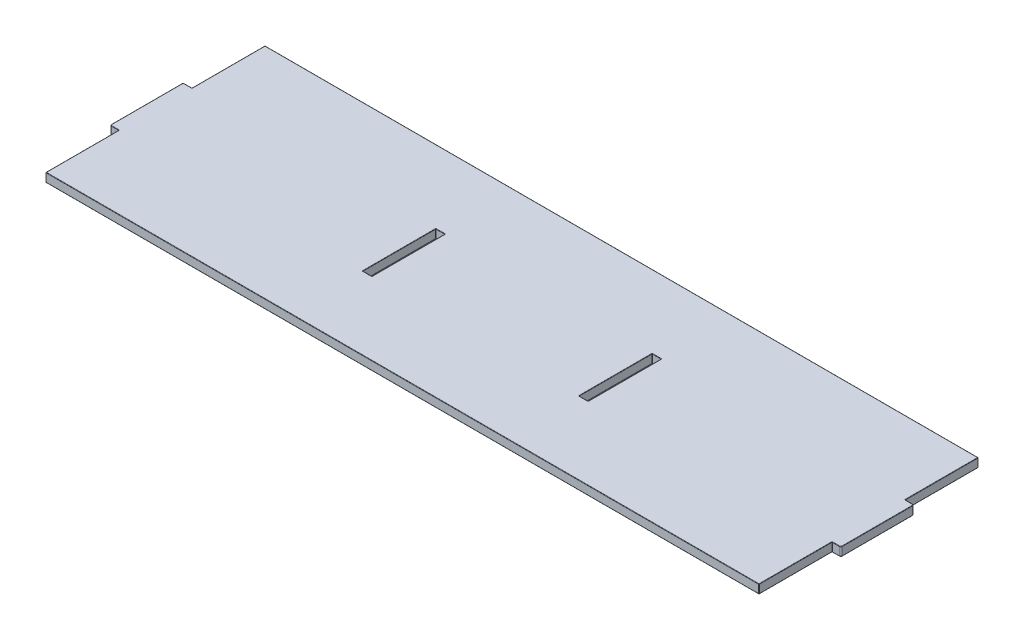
ISO-10303-21;
HEADER;
FILE_DESCRIPTION(('STEP AP214'),'2;1');
FILE_NAME('part.step','',(''),(''),'','','');
FILE_SCHEMA(('AUTOMOTIVE_DESIGN { 1 0 10303 214 1 1 1 1 }'));
ENDSEC;
DATA;
#1=APPLICATION_CONTEXT('core data for automotive mechanical design processes');
#2=APPLICATION_PROTOCOL_DEFINITION('international standard','automotive_design',2000,#1);
#3=PRODUCT_CONTEXT('',#1,'mechanical');
#4=PRODUCT('Part','Part','',(#3));
#5=PRODUCT_RELATED_PRODUCT_CATEGORY('part','',(#4));
#6=PRODUCT_DEFINITION_FORMATION('','',#4);
#7=PRODUCT_DEFINITION_CONTEXT('part definition',#1,'design');
#8=PRODUCT_DEFINITION('design','',#6,#7);
#9=PRODUCT_DEFINITION_SHAPE('','',#8);
#10=(LENGTH_UNIT() NAMED_UNIT(*) SI_UNIT(.MILLI.,.METRE.));
#11=(NAMED_UNIT(*) PLANE_ANGLE_UNIT() SI_UNIT($,.RADIAN.));
#12=(NAMED_UNIT(*) SI_UNIT($,.STERADIAN.) SOLID_ANGLE_UNIT());
#13=UNCERTAINTY_MEASURE_WITH_UNIT(LENGTH_MEASURE(1.E-05),#10,'distance_accuracy_value','');
#14=(GEOMETRIC_REPRESENTATION_CONTEXT(3) GLOBAL_UNCERTAINTY_ASSIGNED_CONTEXT((#13)) GLOBAL_UNIT_ASSIGNED_CONTEXT((#10,
#11,#12)) REPRESENTATION_CONTEXT('',''));
#15=CARTESIAN_POINT('',(0.,0.,0.));
#16=DIRECTION('',(0.,0.,1.));
#17=DIRECTION('',(1.,0.,0.));
#18=AXIS2_PLACEMENT_3D('',#15,#16,#17);
#19=CARTESIAN_POINT('',(0.,0.,0.));
#20=DIRECTION('',(0.,1.,0.));
#21=DIRECTION('',(0.,0.,1.));
#22=AXIS2_PLACEMENT_3D('',#19,#20,#21);
#23=PLANE('',#22);
#24=CARTESIAN_POINT('',(142.25,0.,-49.5000000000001));
#25=DIRECTION('',(0.,1.,0.));
#26=DIRECTION('',(0.,0.,1.));
#27=AXIS2_PLACEMENT_3D('',#24,#25,#26);
#28=CIRCLE('',#27,1.);
#29=CARTESIAN_POINT('',(141.25,0.,-49.5000000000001));
#30=VERTEX_POINT('',#29);
#31=CARTESIAN_POINT('',(142.25,0.,-50.5000000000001));
#32=VERTEX_POINT('',#31);
#33=EDGE_CURVE('E880',#30,#32,#28,.F.);
#34=ORIENTED_EDGE('',*,*,#33,.F.);
#35=DIRECTION('',(0.,0.,1.));
#36=VECTOR('',#35,1.);
#37=CARTESIAN_POINT('',(141.25,0.,49.9999999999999));
#38=LINE('',#37,#36);
#39=CARTESIAN_POINT('',(141.25,0.,49.4999999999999));
#40=VERTEX_POINT('',#39);
#41=EDGE_CURVE('E888',#30,#40,#38,.T.);
#42=ORIENTED_EDGE('',*,*,#41,.T.);
#43=CARTESIAN_POINT('',(142.25,0.,49.4999999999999));
#44=DIRECTION('',(0.,1.,0.));
#45=DIRECTION('',(0.,0.,1.));
#46=AXIS2_PLACEMENT_3D('',#43,#44,#45);
#47=CIRCLE('',#46,1.);
#48=CARTESIAN_POINT('',(142.25,0.,50.4999999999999));
#49=VERTEX_POINT('',#48);
#50=EDGE_CURVE('E884',#49,#40,#47,.F.);
#51=ORIENTED_EDGE('',*,*,#50,.F.);
#52=DIRECTION('',(1.,0.,0.));
#53=VECTOR('',#52,1.);
#54=CARTESIAN_POINT('',(154.25,0.,50.4999999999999));
#55=LINE('',#54,#53);
#56=CARTESIAN_POINT('',(153.75,0.,50.4999999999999));
#57=VERTEX_POINT('',#56);
#58=EDGE_CURVE('E876',#49,#57,#55,.T.);
#59=ORIENTED_EDGE('',*,*,#58,.T.);
#60=CARTESIAN_POINT('',(153.75,0.,49.4999999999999));
#61=DIRECTION('',(0.,1.,0.));
#62=DIRECTION('',(0.,0.,1.));
#63=AXIS2_PLACEMENT_3D('',#60,#61,#62);
#64=CIRCLE('',#63,1.);
#65=CARTESIAN_POINT('',(154.75,0.,49.4999999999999));
#66=VERTEX_POINT('',#65);
#67=EDGE_CURVE('E873',#66,#57,#64,.F.);
#68=ORIENTED_EDGE('',*,*,#67,.F.);
#69=DIRECTION('',(0.,0.,-1.));
#70=VECTOR('',#69,1.);
#71=CARTESIAN_POINT('',(154.75,0.,-50.0000000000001));
#72=LINE('',#71,#70);
#73=CARTESIAN_POINT('',(154.75,0.,-49.5000000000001));
#74=VERTEX_POINT('',#73);
#75=EDGE_CURVE('E867',#66,#74,#72,.T.);
#76=ORIENTED_EDGE('',*,*,#75,.T.);
#77=CARTESIAN_POINT('',(153.75,0.,-49.5000000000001));
#78=DIRECTION('',(0.,1.,0.));
#79=DIRECTION('',(0.,0.,1.));
#80=AXIS2_PLACEMENT_3D('',#77,#78,#79);
#81=CIRCLE('',#80,1.);
#82=CARTESIAN_POINT('',(153.75,0.,-50.5000000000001));
#83=VERTEX_POINT('',#82);
#84=EDGE_CURVE('E863',#83,#74,#81,.F.);
#85=ORIENTED_EDGE('',*,*,#84,.F.);
#86=DIRECTION('',(-1.,0.,0.));
#87=VECTOR('',#86,1.);
#88=CARTESIAN_POINT('',(141.75,0.,-50.5000000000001));
#89=LINE('',#88,#87);
#90=EDGE_CURVE('E870',#83,#32,#89,.T.);
#91=ORIENTED_EDGE('',*,*,#90,.T.);
#92=EDGE_LOOP('',(#34,#42,#51,#59,#68,#76,#85,#91));
#93=FACE_BOUND('',#92,.T.);
#94=CARTESIAN_POINT('',(-153.75,0.,-49.5000000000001));
#95=DIRECTION('',(0.,1.,0.));
#96=DIRECTION('',(0.,0.,1.));
#97=AXIS2_PLACEMENT_3D('',#94,#95,#96);
#98=CIRCLE('',#97,1.);
#99=CARTESIAN_POINT('',(-154.75,0.,-49.5000000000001));
#100=VERTEX_POINT('',#99);
#101=CARTESIAN_POINT('',(-153.75,0.,-50.5000000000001));
#102=VERTEX_POINT('',#101);
#103=EDGE_CURVE('E787',#100,#102,#98,.F.);
#104=ORIENTED_EDGE('',*,*,#103,.F.);
#105=DIRECTION('',(0.,0.,1.));
#106=VECTOR('',#105,1.);
#107=CARTESIAN_POINT('',(-154.75,0.,49.9999999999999));
#108=LINE('',#107,#106);
#109=CARTESIAN_POINT('',(-154.75,0.,49.4999999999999));
#110=VERTEX_POINT('',#109);
#111=EDGE_CURVE('E795',#100,#110,#108,.T.);
#112=ORIENTED_EDGE('',*,*,#111,.T.);
#113=CARTESIAN_POINT('',(-153.75,0.,49.4999999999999));
#114=DIRECTION('',(0.,1.,0.));
#115=DIRECTION('',(0.,0.,1.));
#116=AXIS2_PLACEMENT_3D('',#113,#114,#115);
#117=CIRCLE('',#116,1.);
#118=CARTESIAN_POINT('',(-153.75,0.,50.4999999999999));
#119=VERTEX_POINT('',#118);
#120=EDGE_CURVE('E791',#119,#110,#117,.F.);
#121=ORIENTED_EDGE('',*,*,#120,.F.);
#122=DIRECTION('',(1.,0.,0.));
#123=VECTOR('',#122,1.);
#124=CARTESIAN_POINT('',(-141.75,0.,50.4999999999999));
#125=LINE('',#124,#123);
#126=CARTESIAN_POINT('',(-142.25,0.,50.4999999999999));
#127=VERTEX_POINT('',#126);
#128=EDGE_CURVE('E783',#119,#127,#125,.T.);
#129=ORIENTED_EDGE('',*,*,#128,.T.);
#130=CARTESIAN_POINT('',(-142.25,0.,49.4999999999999));
#131=DIRECTION('',(0.,1.,0.));
#132=DIRECTION('',(0.,0.,1.));
#133=AXIS2_PLACEMENT_3D('',#130,#131,#132);
#134=CIRCLE('',#133,1.);
#135=CARTESIAN_POINT('',(-141.25,0.,49.4999999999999));
#136=VERTEX_POINT('',#135);
#137=EDGE_CURVE('E779',#136,#127,#134,.F.);
#138=ORIENTED_EDGE('',*,*,#137,.F.);
#139=DIRECTION('',(0.,0.,-1.));
#140=VECTOR('',#139,1.);
#141=CARTESIAN_POINT('',(-141.25,0.,-50.0000000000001));
#142=LINE('',#141,#140);
#143=CARTESIAN_POINT('',(-141.25,0.,-49.5000000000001));
#144=VERTEX_POINT('',#143);
#145=EDGE_CURVE('E773',#136,#144,#142,.T.);
#146=ORIENTED_EDGE('',*,*,#145,.T.);
#147=CARTESIAN_POINT('',(-142.25,0.,-49.5000000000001));
#148=DIRECTION('',(0.,1.,0.));
#149=DIRECTION('',(0.,0.,1.));
#150=AXIS2_PLACEMENT_3D('',#147,#148,#149);
#151=CIRCLE('',#150,1.);
#152=CARTESIAN_POINT('',(-142.25,0.,-50.5000000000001));
#153=VERTEX_POINT('',#152);
#154=EDGE_CURVE('E769',#153,#144,#151,.F.);
#155=ORIENTED_EDGE('',*,*,#154,.F.);
#156=DIRECTION('',(-1.,0.,0.));
#157=VECTOR('',#156,1.);
#158=CARTESIAN_POINT('',(-154.25,0.,-50.5000000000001));
#159=LINE('',#158,#157);
#160=EDGE_CURVE('E776',#153,#102,#159,.T.);
#161=ORIENTED_EDGE('',*,*,#160,.T.);
#162=EDGE_LOOP('',(#104,#112,#121,#129,#138,#146,#155,#161));
#163=FACE_BOUND('',#162,.T.);
#164=CARTESIAN_POINT('',(-488.5,0.,-50.5));
#165=DIRECTION('',(0.,1.,0.));
#166=DIRECTION('',(0.,0.,1.));
#167=AXIS2_PLACEMENT_3D('',#164,#165,#166);
#168=CIRCLE('',#167,1.);
#169=CARTESIAN_POINT('',(-487.5,0.,-50.5));
#170=VERTEX_POINT('',#169);
#171=CARTESIAN_POINT('',(-488.5,0.,-49.5));
#172=VERTEX_POINT('',#171);
#173=EDGE_CURVE('E859',#170,#172,#168,.F.);
#174=ORIENTED_EDGE('',*,*,#173,.F.);
#175=DIRECTION('',(0.,0.,1.));
#176=VECTOR('',#175,1.);
#177=CARTESIAN_POINT('',(-487.5,0.,0.));
#178=LINE('',#177,#176);
#179=CARTESIAN_POINT('',(-487.5,0.,-149.5));
#180=VERTEX_POINT('',#179);
#181=EDGE_CURVE('E856',#170,#180,#178,.F.);
#182=ORIENTED_EDGE('',*,*,#181,.T.);
#183=DIRECTION('',(-1.,0.,0.));
#184=VECTOR('',#183,1.);
#185=CARTESIAN_POINT('',(0.,0.,-149.5));
#186=LINE('',#185,#184);
#187=CARTESIAN_POINT('',(487.5,0.,-149.5));
#188=VERTEX_POINT('',#187);
#189=EDGE_CURVE('E834',#180,#188,#186,.F.);
#190=ORIENTED_EDGE('',*,*,#189,.T.);
#191=DIRECTION('',(0.,0.,-1.));
#192=VECTOR('',#191,1.);
#193=CARTESIAN_POINT('',(487.5,0.,-1.08246744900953E-12));
#194=LINE('',#193,#192);
#195=CARTESIAN_POINT('',(487.5,0.,-50.5));
#196=VERTEX_POINT('',#195);
#197=EDGE_CURVE('E817',#188,#196,#194,.F.);
#198=ORIENTED_EDGE('',*,*,#197,.T.);
#199=CARTESIAN_POINT('',(488.5,0.,-50.5));
#200=DIRECTION('',(0.,1.,0.));
#201=DIRECTION('',(0.,0.,1.));
#202=AXIS2_PLACEMENT_3D('',#199,#200,#201);
#203=CIRCLE('',#202,1.);
#204=CARTESIAN_POINT('',(488.5,0.,-49.5));
#205=VERTEX_POINT('',#204);
#206=EDGE_CURVE('E813',#205,#196,#203,.F.);
#207=ORIENTED_EDGE('',*,*,#206,.F.);
#208=DIRECTION('',(-1.,0.,0.));
#209=VECTOR('',#208,1.);
#210=CARTESIAN_POINT('',(0.,0.,-49.5));
#211=LINE('',#210,#209);
#212=CARTESIAN_POINT('',(498.,0.,-49.5));
#213=VERTEX_POINT('',#212);
#214=EDGE_CURVE('E798',#205,#213,#211,.F.);
#215=ORIENTED_EDGE('',*,*,#214,.T.);
#216=CARTESIAN_POINT('',(498.,0.,-48.));
#217=DIRECTION('',(0.,1.,0.));
#218=DIRECTION('',(0.,0.,1.));
#219=AXIS2_PLACEMENT_3D('',#216,#217,#218);
#220=CIRCLE('',#219,1.5);
#221=CARTESIAN_POINT('',(499.5,0.,-48.));
#222=VERTEX_POINT('',#221);
#223=EDGE_CURVE('E801',#213,#222,#220,.F.);
#224=ORIENTED_EDGE('',*,*,#223,.T.);
#225=DIRECTION('',(0.,0.,-1.));
#226=VECTOR('',#225,1.);
#227=CARTESIAN_POINT('',(499.5,0.,0.));
#228=LINE('',#227,#226);
#229=CARTESIAN_POINT('',(499.5,0.,48.));
#230=VERTEX_POINT('',#229);
#231=EDGE_CURVE('E804',#222,#230,#228,.F.);
#232=ORIENTED_EDGE('',*,*,#231,.T.);
#233=CARTESIAN_POINT('',(498.,0.,48.));
#234=DIRECTION('',(0.,1.,0.));
#235=DIRECTION('',(0.,0.,1.));
#236=AXIS2_PLACEMENT_3D('',#233,#234,#235);
#237=CIRCLE('',#236,1.5);
#238=CARTESIAN_POINT('',(498.,0.,49.5));
#239=VERTEX_POINT('',#238);
#240=EDGE_CURVE('E807',#230,#239,#237,.F.);
#241=ORIENTED_EDGE('',*,*,#240,.T.);
#242=DIRECTION('',(1.,0.,0.));
#243=VECTOR('',#242,1.);
#244=CARTESIAN_POINT('',(0.,0.,49.4999999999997));
#245=LINE('',#244,#243);
#246=CARTESIAN_POINT('',(488.5,0.,49.5));
#247=VERTEX_POINT('',#246);
#248=EDGE_CURVE('E810',#239,#247,#245,.F.);
#249=ORIENTED_EDGE('',*,*,#248,.T.);
#250=CARTESIAN_POINT('',(488.5,0.,50.5));
#251=DIRECTION('',(0.,1.,0.));
#252=DIRECTION('',(0.,0.,1.));
#253=AXIS2_PLACEMENT_3D('',#250,#251,#252);
#254=CIRCLE('',#253,1.);
#255=CARTESIAN_POINT('',(487.5,0.,50.5));
#256=VERTEX_POINT('',#255);
#257=EDGE_CURVE('E821',#256,#247,#254,.F.);
#258=ORIENTED_EDGE('',*,*,#257,.F.);
#259=DIRECTION('',(0.,0.,-1.));
#260=VECTOR('',#259,1.);
#261=CARTESIAN_POINT('',(487.5,0.,2.70616862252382E-13));
#262=LINE('',#261,#260);
#263=CARTESIAN_POINT('',(487.5,0.,149.5));
#264=VERTEX_POINT('',#263);
#265=EDGE_CURVE('E825',#256,#264,#262,.F.);
#266=ORIENTED_EDGE('',*,*,#265,.T.);
#267=DIRECTION('',(1.,0.,0.));
#268=VECTOR('',#267,1.);
#269=CARTESIAN_POINT('',(0.,0.,149.5));
#270=LINE('',#269,#268);
#271=CARTESIAN_POINT('',(-487.5,0.,149.5));
#272=VERTEX_POINT('',#271);
#273=EDGE_CURVE('E828',#264,#272,#270,.F.);
#274=ORIENTED_EDGE('',*,*,#273,.T.);
#275=DIRECTION('',(0.,0.,1.));
#276=VECTOR('',#275,1.);
#277=CARTESIAN_POINT('',(-487.5,0.,0.));
#278=LINE('',#277,#276);
#279=CARTESIAN_POINT('',(-487.5,0.,50.5));
#280=VERTEX_POINT('',#279);
#281=EDGE_CURVE('E831',#272,#280,#278,.F.);
#282=ORIENTED_EDGE('',*,*,#281,.T.);
#283=CARTESIAN_POINT('',(-488.5,0.,50.5));
#284=DIRECTION('',(0.,1.,0.));
#285=DIRECTION('',(0.,0.,1.));
#286=AXIS2_PLACEMENT_3D('',#283,#284,#285);
#287=CIRCLE('',#286,1.);
#288=CARTESIAN_POINT('',(-488.5,0.,49.5));
#289=VERTEX_POINT('',#288);
#290=EDGE_CURVE('E837',#289,#280,#287,.F.);
#291=ORIENTED_EDGE('',*,*,#290,.F.);
#292=DIRECTION('',(1.,0.,0.));
#293=VECTOR('',#292,1.);
#294=CARTESIAN_POINT('',(0.,0.,49.4999999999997));
#295=LINE('',#294,#293);
#296=CARTESIAN_POINT('',(-498.,0.,49.5));
#297=VERTEX_POINT('',#296);
#298=EDGE_CURVE('E841',#289,#297,#295,.F.);
#299=ORIENTED_EDGE('',*,*,#298,.T.);
#300=CARTESIAN_POINT('',(-498.,0.,48.));
#301=DIRECTION('',(0.,1.,0.));
#302=DIRECTION('',(0.,0.,1.));
#303=AXIS2_PLACEMENT_3D('',#300,#301,#302);
#304=CIRCLE('',#303,1.5);
#305=CARTESIAN_POINT('',(-499.5,0.,48.));
#306=VERTEX_POINT('',#305);
#307=EDGE_CURVE('E844',#297,#306,#304,.F.);
#308=ORIENTED_EDGE('',*,*,#307,.T.);
#309=DIRECTION('',(0.,0.,1.));
#310=VECTOR('',#309,1.);
#311=CARTESIAN_POINT('',(-499.5,0.,0.));
#312=LINE('',#311,#310);
#313=CARTESIAN_POINT('',(-499.5,0.,-48.));
#314=VERTEX_POINT('',#313);
#315=EDGE_CURVE('E847',#306,#314,#312,.F.);
#316=ORIENTED_EDGE('',*,*,#315,.T.);
#317=CARTESIAN_POINT('',(-498.,0.,-48.));
#318=DIRECTION('',(0.,1.,0.));
#319=DIRECTION('',(0.,0.,1.));
#320=AXIS2_PLACEMENT_3D('',#317,#318,#319);
#321=CIRCLE('',#320,1.5);
#322=CARTESIAN_POINT('',(-498.,0.,-49.5));
#323=VERTEX_POINT('',#322);
#324=EDGE_CURVE('E850',#314,#323,#321,.F.);
#325=ORIENTED_EDGE('',*,*,#324,.T.);
#326=DIRECTION('',(-1.,0.,0.));
#327=VECTOR('',#326,1.);
#328=CARTESIAN_POINT('',(0.,0.,-49.5));
#329=LINE('',#328,#327);
#330=EDGE_CURVE('E853',#323,#172,#329,.F.);
#331=ORIENTED_EDGE('',*,*,#330,.T.);
#332=EDGE_LOOP('',(#174,#182,#190,#198,#207,#215,#224,#232,#241,#249,#258,#266,#274,#282,#291,
#299,#308,#316,#325,#331));
#333=FACE_BOUND('',#332,.T.);
#334=ADVANCED_FACE('F38',(#93,#163,#333),#23,.F.);
#335=CARTESIAN_POINT('',(0.,12.,0.));
#336=DIRECTION('',(0.,1.,0.));
#337=DIRECTION('',(0.,0.,1.));
#338=AXIS2_PLACEMENT_3D('',#335,#336,#337);
#339=PLANE('',#338);
#340=CARTESIAN_POINT('',(153.75,12.,49.4999999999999));
#341=DIRECTION('',(0.,1.,0.));
#342=DIRECTION('',(0.,0.,1.));
#343=AXIS2_PLACEMENT_3D('',#340,#341,#342);
#344=CIRCLE('',#343,1.);
#345=CARTESIAN_POINT('',(153.75,12.,50.4999999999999));
#346=VERTEX_POINT('',#345);
#347=CARTESIAN_POINT('',(154.75,12.,49.4999999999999));
#348=VERTEX_POINT('',#347);
#349=EDGE_CURVE('E59',#346,#348,#344,.T.);
#350=ORIENTED_EDGE('',*,*,#349,.F.);
#351=DIRECTION('',(1.,0.,0.));
#352=VECTOR('',#351,1.);
#353=CARTESIAN_POINT('',(0.,12.,50.4999999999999));
#354=LINE('',#353,#352);
#355=CARTESIAN_POINT('',(142.25,12.,50.4999999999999));
#356=VERTEX_POINT('',#355);
#357=EDGE_CURVE('E11',#346,#356,#354,.F.);
#358=ORIENTED_EDGE('',*,*,#357,.T.);
#359=CARTESIAN_POINT('',(142.25,12.,49.4999999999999));
#360=DIRECTION('',(0.,1.,0.));
#361=DIRECTION('',(0.,0.,1.));
#362=AXIS2_PLACEMENT_3D('',#359,#360,#361);
#363=CIRCLE('',#362,1.);
#364=CARTESIAN_POINT('',(141.25,12.,49.4999999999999));
#365=VERTEX_POINT('',#364);
#366=EDGE_CURVE('E48',#365,#356,#363,.T.);
#367=ORIENTED_EDGE('',*,*,#366,.F.);
#368=DIRECTION('',(0.,0.,1.));
#369=VECTOR('',#368,1.);
#370=CARTESIAN_POINT('',(141.25,12.,0.));
#371=LINE('',#370,#369);
#372=CARTESIAN_POINT('',(141.25,12.,-49.5000000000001));
#373=VERTEX_POINT('',#372);
#374=EDGE_CURVE('E1034',#365,#373,#371,.F.);
#375=ORIENTED_EDGE('',*,*,#374,.T.);
#376=CARTESIAN_POINT('',(142.25,12.,-49.5000000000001));
#377=DIRECTION('',(0.,1.,0.));
#378=DIRECTION('',(0.,0.,1.));
#379=AXIS2_PLACEMENT_3D('',#376,#377,#378);
#380=CIRCLE('',#379,1.);
#381=CARTESIAN_POINT('',(142.25,12.,-50.5000000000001));
#382=VERTEX_POINT('',#381);
#383=EDGE_CURVE('E1031',#382,#373,#380,.T.);
#384=ORIENTED_EDGE('',*,*,#383,.F.);
#385=DIRECTION('',(-1.,0.,0.));
#386=VECTOR('',#385,1.);
#387=CARTESIAN_POINT('',(0.,12.,-50.5000000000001));
#388=LINE('',#387,#386);
#389=CARTESIAN_POINT('',(153.75,12.,-50.5000000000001));
#390=VERTEX_POINT('',#389);
#391=EDGE_CURVE('E1025',#382,#390,#388,.F.);
#392=ORIENTED_EDGE('',*,*,#391,.T.);
#393=CARTESIAN_POINT('',(153.75,12.,-49.5000000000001));
#394=DIRECTION('',(0.,1.,0.));
#395=DIRECTION('',(0.,0.,1.));
#396=AXIS2_PLACEMENT_3D('',#393,#394,#395);
#397=CIRCLE('',#396,1.);
#398=CARTESIAN_POINT('',(154.75,12.,-49.5000000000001));
#399=VERTEX_POINT('',#398);
#400=EDGE_CURVE('E1021',#399,#390,#397,.T.);
#401=ORIENTED_EDGE('',*,*,#400,.F.);
#402=DIRECTION('',(0.,0.,-1.));
#403=VECTOR('',#402,1.);
#404=CARTESIAN_POINT('',(154.75,12.,0.));
#405=LINE('',#404,#403);
#406=EDGE_CURVE('E1028',#399,#348,#405,.F.);
#407=ORIENTED_EDGE('',*,*,#406,.T.);
#408=EDGE_LOOP('',(#350,#358,#367,#375,#384,#392,#401,#407));
#409=FACE_BOUND('',#408,.T.);
#410=CARTESIAN_POINT('',(-142.25,12.,49.4999999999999));
#411=DIRECTION('',(0.,1.,0.));
#412=DIRECTION('',(0.,0.,1.));
#413=AXIS2_PLACEMENT_3D('',#410,#411,#412);
#414=CIRCLE('',#413,1.);
#415=CARTESIAN_POINT('',(-142.25,12.,50.4999999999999));
#416=VERTEX_POINT('',#415);
#417=CARTESIAN_POINT('',(-141.25,12.,49.4999999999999));
#418=VERTEX_POINT('',#417);
#419=EDGE_CURVE('E1010',#416,#418,#414,.T.);
#420=ORIENTED_EDGE('',*,*,#419,.F.);
#421=DIRECTION('',(1.,0.,0.));
#422=VECTOR('',#421,1.);
#423=CARTESIAN_POINT('',(0.,12.,50.4999999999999));
#424=LINE('',#423,#422);
#425=CARTESIAN_POINT('',(-153.75,12.,50.4999999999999));
#426=VERTEX_POINT('',#425);
#427=EDGE_CURVE('E1018',#416,#426,#424,.F.);
#428=ORIENTED_EDGE('',*,*,#427,.T.);
#429=CARTESIAN_POINT('',(-153.75,12.,49.4999999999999));
#430=DIRECTION('',(0.,1.,0.));
#431=DIRECTION('',(0.,0.,1.));
#432=AXIS2_PLACEMENT_3D('',#429,#430,#431);
#433=CIRCLE('',#432,1.);
#434=CARTESIAN_POINT('',(-154.75,12.,49.4999999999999));
#435=VERTEX_POINT('',#434);
#436=EDGE_CURVE('E1014',#435,#426,#433,.T.);
#437=ORIENTED_EDGE('',*,*,#436,.F.);
#438=DIRECTION('',(0.,0.,1.));
#439=VECTOR('',#438,1.);
#440=CARTESIAN_POINT('',(-154.75,12.,0.));
#441=LINE('',#440,#439);
#442=CARTESIAN_POINT('',(-154.75,12.,-49.5000000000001));
#443=VERTEX_POINT('',#442);
#444=EDGE_CURVE('E1006',#435,#443,#441,.F.);
#445=ORIENTED_EDGE('',*,*,#444,.T.);
#446=CARTESIAN_POINT('',(-153.75,12.,-49.5000000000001));
#447=DIRECTION('',(0.,1.,0.));
#448=DIRECTION('',(0.,0.,1.));
#449=AXIS2_PLACEMENT_3D('',#446,#447,#448);
#450=CIRCLE('',#449,1.);
#451=CARTESIAN_POINT('',(-153.75,12.,-50.5000000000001));
#452=VERTEX_POINT('',#451);
#453=EDGE_CURVE('E1002',#452,#443,#450,.T.);
#454=ORIENTED_EDGE('',*,*,#453,.F.);
#455=DIRECTION('',(-1.,0.,0.));
#456=VECTOR('',#455,1.);
#457=CARTESIAN_POINT('',(0.,12.,-50.5000000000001));
#458=LINE('',#457,#456);
#459=CARTESIAN_POINT('',(-142.25,12.,-50.5000000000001));
#460=VERTEX_POINT('',#459);
#461=EDGE_CURVE('E996',#452,#460,#458,.F.);
#462=ORIENTED_EDGE('',*,*,#461,.T.);
#463=CARTESIAN_POINT('',(-142.25,12.,-49.5000000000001));
#464=DIRECTION('',(0.,1.,0.));
#465=DIRECTION('',(0.,0.,1.));
#466=AXIS2_PLACEMENT_3D('',#463,#464,#465);
#467=CIRCLE('',#466,1.);
#468=CARTESIAN_POINT('',(-141.25,12.,-49.5000000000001));
#469=VERTEX_POINT('',#468);
#470=EDGE_CURVE('E992',#469,#460,#467,.T.);
#471=ORIENTED_EDGE('',*,*,#470,.F.);
#472=DIRECTION('',(0.,0.,-1.));
#473=VECTOR('',#472,1.);
#474=CARTESIAN_POINT('',(-141.25,12.,0.));
#475=LINE('',#474,#473);
#476=EDGE_CURVE('E999',#469,#418,#475,.F.);
#477=ORIENTED_EDGE('',*,*,#476,.T.);
#478=EDGE_LOOP('',(#420,#428,#437,#445,#454,#462,#471,#477));
#479=FACE_BOUND('',#478,.T.);
#480=DIRECTION('',(0.,0.,1.));
#481=VECTOR('',#480,1.);
#482=CARTESIAN_POINT('',(-487.5,12.,150.));
#483=LINE('',#482,#481);
#484=CARTESIAN_POINT('',(-487.5,12.,50.5));
#485=VERTEX_POINT('',#484);
#486=CARTESIAN_POINT('',(-487.5,12.,149.5));
#487=VERTEX_POINT('',#486);
#488=EDGE_CURVE('E986',#485,#487,#483,.T.);
#489=ORIENTED_EDGE('',*,*,#488,.T.);
#490=DIRECTION('',(1.,0.,0.));
#491=VECTOR('',#490,1.);
#492=CARTESIAN_POINT('',(488.,12.,149.5));
#493=LINE('',#492,#491);
#494=CARTESIAN_POINT('',(487.5,12.,149.5));
#495=VERTEX_POINT('',#494);
#496=EDGE_CURVE('E989',#487,#495,#493,.T.);
#497=ORIENTED_EDGE('',*,*,#496,.T.);
#498=DIRECTION('',(0.,0.,-1.));
#499=VECTOR('',#498,1.);
#500=CARTESIAN_POINT('',(487.5,12.,50.));
#501=LINE('',#500,#499);
#502=CARTESIAN_POINT('',(487.5,12.,50.5));
#503=VERTEX_POINT('',#502);
#504=EDGE_CURVE('E979',#495,#503,#501,.T.);
#505=ORIENTED_EDGE('',*,*,#504,.T.);
#506=CARTESIAN_POINT('',(488.5,12.,50.5));
#507=DIRECTION('',(0.,1.,0.));
#508=DIRECTION('',(0.,0.,1.));
#509=AXIS2_PLACEMENT_3D('',#506,#507,#508);
#510=CIRCLE('',#509,1.);
#511=CARTESIAN_POINT('',(488.5,12.,49.5));
#512=VERTEX_POINT('',#511);
#513=EDGE_CURVE('E975',#512,#503,#510,.T.);
#514=ORIENTED_EDGE('',*,*,#513,.F.);
#515=DIRECTION('',(1.,0.,0.));
#516=VECTOR('',#515,1.);
#517=CARTESIAN_POINT('',(498.,12.,49.5));
#518=LINE('',#517,#516);
#519=CARTESIAN_POINT('',(498.,12.,49.5));
#520=VERTEX_POINT('',#519);
#521=EDGE_CURVE('E953',#512,#520,#518,.T.);
#522=ORIENTED_EDGE('',*,*,#521,.T.);
#523=CARTESIAN_POINT('',(498.,12.,48.));
#524=DIRECTION('',(0.,1.,0.));
#525=DIRECTION('',(0.,0.,1.));
#526=AXIS2_PLACEMENT_3D('',#523,#524,#525);
#527=CIRCLE('',#526,1.5);
#528=CARTESIAN_POINT('',(499.5,12.,48.));
#529=VERTEX_POINT('',#528);
#530=EDGE_CURVE('E936',#520,#529,#527,.T.);
#531=ORIENTED_EDGE('',*,*,#530,.T.);
#532=DIRECTION('',(0.,0.,-1.));
#533=VECTOR('',#532,1.);
#534=CARTESIAN_POINT('',(499.5,12.,-48.));
#535=LINE('',#534,#533);
#536=CARTESIAN_POINT('',(499.5,12.,-48.));
#537=VERTEX_POINT('',#536);
#538=EDGE_CURVE('E927',#529,#537,#535,.T.);
#539=ORIENTED_EDGE('',*,*,#538,.T.);
#540=CARTESIAN_POINT('',(498.,12.,-48.));
#541=DIRECTION('',(0.,1.,0.));
#542=DIRECTION('',(0.,0.,1.));
#543=AXIS2_PLACEMENT_3D('',#540,#541,#542);
#544=CIRCLE('',#543,1.5);
#545=CARTESIAN_POINT('',(498.,12.,-49.5));
#546=VERTEX_POINT('',#545);
#547=EDGE_CURVE('E930',#537,#546,#544,.T.);
#548=ORIENTED_EDGE('',*,*,#547,.T.);
#549=DIRECTION('',(-1.,0.,0.));
#550=VECTOR('',#549,1.);
#551=CARTESIAN_POINT('',(488.,12.,-49.5));
#552=LINE('',#551,#550);
#553=CARTESIAN_POINT('',(488.5,12.,-49.5));
#554=VERTEX_POINT('',#553);
#555=EDGE_CURVE('E933',#546,#554,#552,.T.);
#556=ORIENTED_EDGE('',*,*,#555,.T.);
#557=CARTESIAN_POINT('',(488.5,12.,-50.5));
#558=DIRECTION('',(0.,1.,0.));
#559=DIRECTION('',(0.,0.,1.));
#560=AXIS2_PLACEMENT_3D('',#557,#558,#559);
#561=CIRCLE('',#560,1.);
#562=CARTESIAN_POINT('',(487.5,12.,-50.5));
#563=VERTEX_POINT('',#562);
#564=EDGE_CURVE('E940',#563,#554,#561,.T.);
#565=ORIENTED_EDGE('',*,*,#564,.F.);
#566=DIRECTION('',(0.,0.,-1.));
#567=VECTOR('',#566,1.);
#568=CARTESIAN_POINT('',(487.5,12.,-150.));
#569=LINE('',#568,#567);
#570=CARTESIAN_POINT('',(487.5,12.,-149.5));
#571=VERTEX_POINT('',#570);
#572=EDGE_CURVE('E944',#563,#571,#569,.T.);
#573=ORIENTED_EDGE('',*,*,#572,.T.);
#574=DIRECTION('',(-1.,0.,0.));
#575=VECTOR('',#574,1.);
#576=CARTESIAN_POINT('',(-488.,12.,-149.5));
#577=LINE('',#576,#575);
#578=CARTESIAN_POINT('',(-487.5,12.,-149.5));
#579=VERTEX_POINT('',#578);
#580=EDGE_CURVE('E947',#571,#579,#577,.T.);
#581=ORIENTED_EDGE('',*,*,#580,.T.);
#582=DIRECTION('',(0.,0.,1.));
#583=VECTOR('',#582,1.);
#584=CARTESIAN_POINT('',(-487.5,12.,-50.));
#585=LINE('',#584,#583);
#586=CARTESIAN_POINT('',(-487.5,12.,-50.5));
#587=VERTEX_POINT('',#586);
#588=EDGE_CURVE('E950',#579,#587,#585,.T.);
#589=ORIENTED_EDGE('',*,*,#588,.T.);
#590=CARTESIAN_POINT('',(-488.5,12.,-50.5));
#591=DIRECTION('',(0.,1.,0.));
#592=DIRECTION('',(0.,0.,1.));
#593=AXIS2_PLACEMENT_3D('',#590,#591,#592);
#594=CIRCLE('',#593,1.);
#595=CARTESIAN_POINT('',(-488.5,12.,-49.5));
#596=VERTEX_POINT('',#595);
#597=EDGE_CURVE('E956',#596,#587,#594,.T.);
#598=ORIENTED_EDGE('',*,*,#597,.F.);
#599=DIRECTION('',(-1.,0.,0.));
#600=VECTOR('',#599,1.);
#601=CARTESIAN_POINT('',(-498.,12.,-49.5));
#602=LINE('',#601,#600);
#603=CARTESIAN_POINT('',(-498.,12.,-49.5));
#604=VERTEX_POINT('',#603);
#605=EDGE_CURVE('E960',#596,#604,#602,.T.);
#606=ORIENTED_EDGE('',*,*,#605,.T.);
#607=CARTESIAN_POINT('',(-498.,12.,-48.));
#608=DIRECTION('',(0.,1.,0.));
#609=DIRECTION('',(0.,0.,1.));
#610=AXIS2_PLACEMENT_3D('',#607,#608,#609);
#611=CIRCLE('',#610,1.5);
#612=CARTESIAN_POINT('',(-499.5,12.,-48.));
#613=VERTEX_POINT('',#612);
#614=EDGE_CURVE('E963',#604,#613,#611,.T.);
#615=ORIENTED_EDGE('',*,*,#614,.T.);
#616=DIRECTION('',(0.,0.,1.));
#617=VECTOR('',#616,1.);
#618=CARTESIAN_POINT('',(-499.5,12.,48.));
#619=LINE('',#618,#617);
#620=CARTESIAN_POINT('',(-499.5,12.,48.));
#621=VERTEX_POINT('',#620);
#622=EDGE_CURVE('E966',#613,#621,#619,.T.);
#623=ORIENTED_EDGE('',*,*,#622,.T.);
#624=CARTESIAN_POINT('',(-498.,12.,48.));
#625=DIRECTION('',(0.,1.,0.));
#626=DIRECTION('',(0.,0.,1.));
#627=AXIS2_PLACEMENT_3D('',#624,#625,#626);
#628=CIRCLE('',#627,1.5);
#629=CARTESIAN_POINT('',(-498.,12.,49.5));
#630=VERTEX_POINT('',#629);
#631=EDGE_CURVE('E969',#621,#630,#628,.T.);
#632=ORIENTED_EDGE('',*,*,#631,.T.);
#633=DIRECTION('',(1.,0.,0.));
#634=VECTOR('',#633,1.);
#635=CARTESIAN_POINT('',(-488.,12.,49.5));
#636=LINE('',#635,#634);
#637=CARTESIAN_POINT('',(-488.5,12.,49.5));
#638=VERTEX_POINT('',#637);
#639=EDGE_CURVE('E972',#630,#638,#636,.T.);
#640=ORIENTED_EDGE('',*,*,#639,.T.);
#641=CARTESIAN_POINT('',(-488.5,12.,50.5));
#642=DIRECTION('',(0.,1.,0.));
#643=DIRECTION('',(0.,0.,1.));
#644=AXIS2_PLACEMENT_3D('',#641,#642,#643);
#645=CIRCLE('',#644,1.);
#646=EDGE_CURVE('E982',#485,#638,#645,.T.);
#647=ORIENTED_EDGE('',*,*,#646,.F.);
#648=EDGE_LOOP('',(#489,#497,#505,#514,#522,#531,#539,#548,#556,#565,#573,#581,#589,#598,#606,
#615,#623,#632,#640,#647));
#649=FACE_BOUND('',#648,.T.);
#650=ADVANCED_FACE('F1477',(#409,#479,#649),#339,.T.);
#651=CARTESIAN_POINT('',(488.,12.,50.));
#652=DIRECTION('',(-1.,0.,0.));
#653=DIRECTION('',(0.,0.,1.));
#654=AXIS2_PLACEMENT_3D('',#651,#652,#653);
#655=PLANE('',#654);
#656=DIRECTION('',(0.,-1.,0.));
#657=VECTOR('',#656,1.);
#658=CARTESIAN_POINT('',(488.,12.,149.5));
#659=LINE('',#658,#657);
#660=CARTESIAN_POINT('',(488.,11.5,149.5));
#661=VERTEX_POINT('',#660);
#662=CARTESIAN_POINT('',(488.,0.5,149.5));
#663=VERTEX_POINT('',#662);
#664=EDGE_CURVE('E711',#661,#663,#659,.T.);
#665=ORIENTED_EDGE('',*,*,#664,.T.);
#666=DIRECTION('',(0.,0.,-1.));
#667=VECTOR('',#666,1.);
#668=CARTESIAN_POINT('',(488.,0.5,50.));
#669=LINE('',#668,#667);
#670=CARTESIAN_POINT('',(488.,0.5,50.5));
#671=VERTEX_POINT('',#670);
#672=EDGE_CURVE('E718',#663,#671,#669,.T.);
#673=ORIENTED_EDGE('',*,*,#672,.T.);
#674=DIRECTION('',(0.,-1.,0.));
#675=VECTOR('',#674,1.);
#676=CARTESIAN_POINT('',(488.,12.,50.5));
#677=LINE('',#676,#675);
#678=CARTESIAN_POINT('',(488.,11.5,50.5));
#679=VERTEX_POINT('',#678);
#680=EDGE_CURVE('E714',#671,#679,#677,.F.);
#681=ORIENTED_EDGE('',*,*,#680,.T.);
#682=DIRECTION('',(0.,0.,-1.));
#683=VECTOR('',#682,1.);
#684=CARTESIAN_POINT('',(488.,11.5,150.));
#685=LINE('',#684,#683);
#686=EDGE_CURVE('E708',#679,#661,#685,.F.);
#687=ORIENTED_EDGE('',*,*,#686,.T.);
#688=EDGE_LOOP('',(#665,#673,#681,#687));
#689=FACE_BOUND('',#688,.T.);
#690=ADVANCED_FACE('F1641',(#689),#655,.F.);
#691=CARTESIAN_POINT('',(500.,12.,50.));
#692=DIRECTION('',(0.,0.,-1.));
#693=DIRECTION('',(-1.,0.,0.));
#694=AXIS2_PLACEMENT_3D('',#691,#692,#693);
#695=PLANE('',#694);
#696=DIRECTION('',(0.,-1.,0.));
#697=VECTOR('',#696,1.);
#698=CARTESIAN_POINT('',(488.5,0.,50.));
#699=LINE('',#698,#697);
#700=CARTESIAN_POINT('',(488.5,11.5,50.));
#701=VERTEX_POINT('',#700);
#702=CARTESIAN_POINT('',(488.5,0.5,50.));
#703=VERTEX_POINT('',#702);
#704=EDGE_CURVE('E701',#701,#703,#699,.T.);
#705=ORIENTED_EDGE('',*,*,#704,.T.);
#706=DIRECTION('',(1.,0.,0.));
#707=VECTOR('',#706,1.);
#708=CARTESIAN_POINT('',(500.,0.5,50.));
#709=LINE('',#708,#707);
#710=CARTESIAN_POINT('',(498.,0.5,50.));
#711=VERTEX_POINT('',#710);
#712=EDGE_CURVE('E705',#703,#711,#709,.T.);
#713=ORIENTED_EDGE('',*,*,#712,.T.);
#714=DIRECTION('',(0.,-1.,0.));
#715=VECTOR('',#714,1.);
#716=CARTESIAN_POINT('',(498.,12.,50.));
#717=LINE('',#716,#715);
#718=CARTESIAN_POINT('',(498.,11.5,50.));
#719=VERTEX_POINT('',#718);
#720=EDGE_CURVE('E1505',#711,#719,#717,.F.);
#721=ORIENTED_EDGE('',*,*,#720,.T.);
#722=DIRECTION('',(1.,0.,0.));
#723=VECTOR('',#722,1.);
#724=CARTESIAN_POINT('',(488.,11.5,50.));
#725=LINE('',#724,#723);
#726=EDGE_CURVE('E698',#719,#701,#725,.F.);
#727=ORIENTED_EDGE('',*,*,#726,.T.);
#728=EDGE_LOOP('',(#705,#713,#721,#727));
#729=FACE_BOUND('',#728,.T.);
#730=ADVANCED_FACE('F1665',(#729),#695,.F.);
#731=CARTESIAN_POINT('',(500.,12.,-50.));
#732=DIRECTION('',(-1.,0.,0.));
#733=DIRECTION('',(0.,0.,1.));
#734=AXIS2_PLACEMENT_3D('',#731,#732,#733);
#735=PLANE('',#734);
#736=DIRECTION('',(0.,-1.,0.));
#737=VECTOR('',#736,1.);
#738=CARTESIAN_POINT('',(500.,12.,48.));
#739=LINE('',#738,#737);
#740=CARTESIAN_POINT('',(500.,11.5,48.));
#741=VERTEX_POINT('',#740);
#742=CARTESIAN_POINT('',(500.,0.5,48.));
#743=VERTEX_POINT('',#742);
#744=EDGE_CURVE('E1496',#741,#743,#739,.T.);
#745=ORIENTED_EDGE('',*,*,#744,.T.);
#746=DIRECTION('',(0.,0.,-1.));
#747=VECTOR('',#746,1.);
#748=CARTESIAN_POINT('',(500.,0.5,-50.));
#749=LINE('',#748,#747);
#750=CARTESIAN_POINT('',(500.,0.5,-48.));
#751=VERTEX_POINT('',#750);
#752=EDGE_CURVE('E918',#743,#751,#749,.T.);
#753=ORIENTED_EDGE('',*,*,#752,.T.);
#754=DIRECTION('',(0.,-1.,0.));
#755=VECTOR('',#754,1.);
#756=CARTESIAN_POINT('',(500.,12.,-48.));
#757=LINE('',#756,#755);
#758=CARTESIAN_POINT('',(500.,11.5,-48.));
#759=VERTEX_POINT('',#758);
#760=EDGE_CURVE('E1500',#751,#759,#757,.F.);
#761=ORIENTED_EDGE('',*,*,#760,.T.);
#762=DIRECTION('',(0.,0.,-1.));
#763=VECTOR('',#762,1.);
#764=CARTESIAN_POINT('',(500.,11.5,48.));
#765=LINE('',#764,#763);
#766=EDGE_CURVE('E915',#759,#741,#765,.F.);
#767=ORIENTED_EDGE('',*,*,#766,.T.);
#768=EDGE_LOOP('',(#745,#753,#761,#767));
#769=FACE_BOUND('',#768,.T.);
#770=ADVANCED_FACE('F1688',(#769),#735,.F.);
#771=CARTESIAN_POINT('',(500.,12.,-50.));
#772=DIRECTION('',(0.,0.,1.));
#773=DIRECTION('',(1.,0.,0.));
#774=AXIS2_PLACEMENT_3D('',#771,#772,#773);
#775=PLANE('',#774);
#776=DIRECTION('',(0.,-1.,0.));
#777=VECTOR('',#776,1.);
#778=CARTESIAN_POINT('',(498.,12.,-50.));
#779=LINE('',#778,#777);
#780=CARTESIAN_POINT('',(498.,11.5,-50.));
#781=VERTEX_POINT('',#780);
#782=CARTESIAN_POINT('',(498.,0.5,-50.));
#783=VERTEX_POINT('',#782);
#784=EDGE_CURVE('E1120',#781,#783,#779,.T.);
#785=ORIENTED_EDGE('',*,*,#784,.T.);
#786=DIRECTION('',(-1.,0.,0.));
#787=VECTOR('',#786,1.);
#788=CARTESIAN_POINT('',(500.,0.5,-50.));
#789=LINE('',#788,#787);
#790=CARTESIAN_POINT('',(488.5,0.5,-50.));
#791=VERTEX_POINT('',#790);
#792=EDGE_CURVE('E740',#783,#791,#789,.T.);
#793=ORIENTED_EDGE('',*,*,#792,.T.);
#794=DIRECTION('',(0.,-1.,0.));
#795=VECTOR('',#794,1.);
#796=CARTESIAN_POINT('',(488.5,12.,-50.));
#797=LINE('',#796,#795);
#798=CARTESIAN_POINT('',(488.5,11.5,-50.));
#799=VERTEX_POINT('',#798);
#800=EDGE_CURVE('E737',#791,#799,#797,.F.);
#801=ORIENTED_EDGE('',*,*,#800,.T.);
#802=DIRECTION('',(-1.,0.,0.));
#803=VECTOR('',#802,1.);
#804=CARTESIAN_POINT('',(498.,11.5,-50.));
#805=LINE('',#804,#803);
#806=EDGE_CURVE('E734',#799,#781,#805,.F.);
#807=ORIENTED_EDGE('',*,*,#806,.T.);
#808=EDGE_LOOP('',(#785,#793,#801,#807));
#809=FACE_BOUND('',#808,.T.);
#810=ADVANCED_FACE('F1488',(#809),#775,.F.);
#811=CARTESIAN_POINT('',(488.,12.,-150.));
#812=DIRECTION('',(-1.,0.,0.));
#813=DIRECTION('',(0.,0.,1.));
#814=AXIS2_PLACEMENT_3D('',#811,#812,#813);
#815=PLANE('',#814);
#816=DIRECTION('',(0.,-1.,0.));
#817=VECTOR('',#816,1.);
#818=CARTESIAN_POINT('',(488.,0.,-50.5));
#819=LINE('',#818,#817);
#820=CARTESIAN_POINT('',(488.,11.5,-50.5));
#821=VERTEX_POINT('',#820);
#822=CARTESIAN_POINT('',(488.,0.5,-50.5));
#823=VERTEX_POINT('',#822);
#824=EDGE_CURVE('E727',#821,#823,#819,.T.);
#825=ORIENTED_EDGE('',*,*,#824,.T.);
#826=DIRECTION('',(0.,0.,-1.));
#827=VECTOR('',#826,1.);
#828=CARTESIAN_POINT('',(488.,0.5,-150.));
#829=LINE('',#828,#827);
#830=CARTESIAN_POINT('',(488.,0.5,-149.5));
#831=VERTEX_POINT('',#830);
#832=EDGE_CURVE('E731',#823,#831,#829,.T.);
#833=ORIENTED_EDGE('',*,*,#832,.T.);
#834=DIRECTION('',(0.,-1.,0.));
#835=VECTOR('',#834,1.);
#836=CARTESIAN_POINT('',(488.,12.,-149.5));
#837=LINE('',#836,#835);
#838=CARTESIAN_POINT('',(488.,11.5,-149.5));
#839=VERTEX_POINT('',#838);
#840=EDGE_CURVE('E724',#831,#839,#837,.F.);
#841=ORIENTED_EDGE('',*,*,#840,.T.);
#842=DIRECTION('',(0.,0.,-1.));
#843=VECTOR('',#842,1.);
#844=CARTESIAN_POINT('',(488.,11.5,-50.));
#845=LINE('',#844,#843);
#846=EDGE_CURVE('E721',#839,#821,#845,.F.);
#847=ORIENTED_EDGE('',*,*,#846,.T.);
#848=EDGE_LOOP('',(#825,#833,#841,#847));
#849=FACE_BOUND('',#848,.T.);
#850=ADVANCED_FACE('F1709',(#849),#815,.F.);
#851=CARTESIAN_POINT('',(-488.,12.,-150.));
#852=DIRECTION('',(0.,0.,1.));
#853=DIRECTION('',(1.,0.,0.));
#854=AXIS2_PLACEMENT_3D('',#851,#852,#853);
#855=PLANE('',#854);
#856=DIRECTION('',(0.,-1.,0.));
#857=VECTOR('',#856,1.);
#858=CARTESIAN_POINT('',(487.5,12.,-150.));
#859=LINE('',#858,#857);
#860=CARTESIAN_POINT('',(487.5,11.5,-150.));
#861=VERTEX_POINT('',#860);
#862=CARTESIAN_POINT('',(487.5,0.5,-150.));
#863=VERTEX_POINT('',#862);
#864=EDGE_CURVE('E749',#861,#863,#859,.T.);
#865=ORIENTED_EDGE('',*,*,#864,.T.);
#866=DIRECTION('',(-1.,0.,0.));
#867=VECTOR('',#866,1.);
#868=CARTESIAN_POINT('',(-488.,0.5,-150.));
#869=LINE('',#868,#867);
#870=CARTESIAN_POINT('',(-487.5,0.5,-150.));
#871=VERTEX_POINT('',#870);
#872=EDGE_CURVE('E753',#863,#871,#869,.T.);
#873=ORIENTED_EDGE('',*,*,#872,.T.);
#874=DIRECTION('',(0.,-1.,0.));
#875=VECTOR('',#874,1.);
#876=CARTESIAN_POINT('',(-487.5,12.,-150.));
#877=LINE('',#876,#875);
#878=CARTESIAN_POINT('',(-487.5,11.5,-150.));
#879=VERTEX_POINT('',#878);
#880=EDGE_CURVE('E746',#871,#879,#877,.F.);
#881=ORIENTED_EDGE('',*,*,#880,.T.);
#882=DIRECTION('',(-1.,0.,0.));
#883=VECTOR('',#882,1.);
#884=CARTESIAN_POINT('',(488.,11.5,-150.));
#885=LINE('',#884,#883);
#886=EDGE_CURVE('E743',#879,#861,#885,.F.);
#887=ORIENTED_EDGE('',*,*,#886,.T.);
#888=EDGE_LOOP('',(#865,#873,#881,#887));
#889=FACE_BOUND('',#888,.T.);
#890=ADVANCED_FACE('F1728',(#889),#855,.F.);
#891=CARTESIAN_POINT('',(-488.,12.,-150.));
#892=DIRECTION('',(1.,0.,0.));
#893=DIRECTION('',(0.,0.,-1.));
#894=AXIS2_PLACEMENT_3D('',#891,#892,#893);
#895=PLANE('',#894);
#896=DIRECTION('',(0.,-1.,0.));
#897=VECTOR('',#896,1.);
#898=CARTESIAN_POINT('',(-488.,12.,-149.5));
#899=LINE('',#898,#897);
#900=CARTESIAN_POINT('',(-488.,11.5,-149.5));
#901=VERTEX_POINT('',#900);
#902=CARTESIAN_POINT('',(-488.,0.5,-149.5));
#903=VERTEX_POINT('',#902);
#904=EDGE_CURVE('E688',#901,#903,#899,.T.);
#905=ORIENTED_EDGE('',*,*,#904,.T.);
#906=DIRECTION('',(0.,0.,1.));
#907=VECTOR('',#906,1.);
#908=CARTESIAN_POINT('',(-488.,0.5,-150.));
#909=LINE('',#908,#907);
#910=CARTESIAN_POINT('',(-488.,0.5,-50.5));
#911=VERTEX_POINT('',#910);
#912=EDGE_CURVE('E695',#903,#911,#909,.T.);
#913=ORIENTED_EDGE('',*,*,#912,.T.);
#914=DIRECTION('',(0.,-1.,0.));
#915=VECTOR('',#914,1.);
#916=CARTESIAN_POINT('',(-488.,12.,-50.5));
#917=LINE('',#916,#915);
#918=CARTESIAN_POINT('',(-488.,11.5,-50.5));
#919=VERTEX_POINT('',#918);
#920=EDGE_CURVE('E691',#911,#919,#917,.F.);
#921=ORIENTED_EDGE('',*,*,#920,.T.);
#922=DIRECTION('',(0.,0.,1.));
#923=VECTOR('',#922,1.);
#924=CARTESIAN_POINT('',(-488.,11.5,-150.));
#925=LINE('',#924,#923);
#926=EDGE_CURVE('E685',#919,#901,#925,.F.);
#927=ORIENTED_EDGE('',*,*,#926,.T.);
#928=EDGE_LOOP('',(#905,#913,#921,#927));
#929=FACE_BOUND('',#928,.T.);
#930=ADVANCED_FACE('F1572',(#929),#895,.F.);
#931=CARTESIAN_POINT('',(-500.,12.,-50.));
#932=DIRECTION('',(0.,0.,1.));
#933=DIRECTION('',(1.,0.,0.));
#934=AXIS2_PLACEMENT_3D('',#931,#932,#933);
#935=PLANE('',#934);
#936=DIRECTION('',(0.,-1.,0.));
#937=VECTOR('',#936,1.);
#938=CARTESIAN_POINT('',(-488.5,0.,-50.));
#939=LINE('',#938,#937);
#940=CARTESIAN_POINT('',(-488.5,11.5,-50.));
#941=VERTEX_POINT('',#940);
#942=CARTESIAN_POINT('',(-488.5,0.5,-50.));
#943=VERTEX_POINT('',#942);
#944=EDGE_CURVE('E679',#941,#943,#939,.T.);
#945=ORIENTED_EDGE('',*,*,#944,.T.);
#946=DIRECTION('',(-1.,0.,0.));
#947=VECTOR('',#946,1.);
#948=CARTESIAN_POINT('',(-500.,0.5,-50.));
#949=LINE('',#948,#947);
#950=CARTESIAN_POINT('',(-498.,0.5,-50.));
#951=VERTEX_POINT('',#950);
#952=EDGE_CURVE('E682',#943,#951,#949,.T.);
#953=ORIENTED_EDGE('',*,*,#952,.T.);
#954=DIRECTION('',(0.,-1.,0.));
#955=VECTOR('',#954,1.);
#956=CARTESIAN_POINT('',(-498.,12.,-50.));
#957=LINE('',#956,#955);
#958=CARTESIAN_POINT('',(-498.,11.5,-50.));
#959=VERTEX_POINT('',#958);
#960=EDGE_CURVE('E552',#951,#959,#957,.F.);
#961=ORIENTED_EDGE('',*,*,#960,.T.);
#962=DIRECTION('',(-1.,0.,0.));
#963=VECTOR('',#962,1.);
#964=CARTESIAN_POINT('',(-488.,11.5,-50.));
#965=LINE('',#964,#963);
#966=EDGE_CURVE('E676',#959,#941,#965,.F.);
#967=ORIENTED_EDGE('',*,*,#966,.T.);
#968=EDGE_LOOP('',(#945,#953,#961,#967));
#969=FACE_BOUND('',#968,.T.);
#970=ADVANCED_FACE('F1550',(#969),#935,.F.);
#971=CARTESIAN_POINT('',(-500.,12.,-50.));
#972=DIRECTION('',(1.,0.,0.));
#973=DIRECTION('',(0.,0.,-1.));
#974=AXIS2_PLACEMENT_3D('',#971,#972,#973);
#975=PLANE('',#974);
#976=DIRECTION('',(0.,-1.,0.));
#977=VECTOR('',#976,1.);
#978=CARTESIAN_POINT('',(-500.,12.,-48.));
#979=LINE('',#978,#977);
#980=CARTESIAN_POINT('',(-500.,11.5,-48.));
#981=VERTEX_POINT('',#980);
#982=CARTESIAN_POINT('',(-500.,0.5,-48.));
#983=VERTEX_POINT('',#982);
#984=EDGE_CURVE('E1513',#981,#983,#979,.T.);
#985=ORIENTED_EDGE('',*,*,#984,.T.);
#986=DIRECTION('',(0.,0.,1.));
#987=VECTOR('',#986,1.);
#988=CARTESIAN_POINT('',(-500.,0.5,-50.));
#989=LINE('',#988,#987);
#990=CARTESIAN_POINT('',(-500.,0.5,48.));
#991=VERTEX_POINT('',#990);
#992=EDGE_CURVE('E900',#983,#991,#989,.T.);
#993=ORIENTED_EDGE('',*,*,#992,.T.);
#994=DIRECTION('',(0.,-1.,0.));
#995=VECTOR('',#994,1.);
#996=CARTESIAN_POINT('',(-500.,12.,48.));
#997=LINE('',#996,#995);
#998=CARTESIAN_POINT('',(-500.,11.5,48.));
#999=VERTEX_POINT('',#998);
#1000=EDGE_CURVE('E556',#991,#999,#997,.F.);
#1001=ORIENTED_EDGE('',*,*,#1000,.T.);
#1002=DIRECTION('',(0.,0.,1.));
#1003=VECTOR('',#1002,1.);
#1004=CARTESIAN_POINT('',(-500.,11.5,-48.));
#1005=LINE('',#1004,#1003);
#1006=EDGE_CURVE('E897',#999,#981,#1005,.F.);
#1007=ORIENTED_EDGE('',*,*,#1006,.T.);
#1008=EDGE_LOOP('',(#985,#993,#1001,#1007));
#1009=FACE_BOUND('',#1008,.T.);
#1010=ADVANCED_FACE('F1521',(#1009),#975,.F.);
#1011=CARTESIAN_POINT('',(-500.,12.,50.));
#1012=DIRECTION('',(0.,0.,-1.));
#1013=DIRECTION('',(-1.,0.,0.));
#1014=AXIS2_PLACEMENT_3D('',#1011,#1012,#1013);
#1015=PLANE('',#1014);
#1016=DIRECTION('',(0.,-1.,0.));
#1017=VECTOR('',#1016,1.);
#1018=CARTESIAN_POINT('',(-498.,12.,50.));
#1019=LINE('',#1018,#1017);
#1020=CARTESIAN_POINT('',(-498.,11.5,50.));
#1021=VERTEX_POINT('',#1020);
#1022=CARTESIAN_POINT('',(-498.,0.5,50.));
#1023=VERTEX_POINT('',#1022);
#1024=EDGE_CURVE('E1509',#1021,#1023,#1019,.T.);
#1025=ORIENTED_EDGE('',*,*,#1024,.T.);
#1026=DIRECTION('',(1.,0.,0.));
#1027=VECTOR('',#1026,1.);
#1028=CARTESIAN_POINT('',(-500.,0.5,50.));
#1029=LINE('',#1028,#1027);
#1030=CARTESIAN_POINT('',(-488.5,0.5,50.));
#1031=VERTEX_POINT('',#1030);
#1032=EDGE_CURVE('E673',#1023,#1031,#1029,.T.);
#1033=ORIENTED_EDGE('',*,*,#1032,.T.);
#1034=DIRECTION('',(0.,-1.,0.));
#1035=VECTOR('',#1034,1.);
#1036=CARTESIAN_POINT('',(-488.5,12.,50.));
#1037=LINE('',#1036,#1035);
#1038=CARTESIAN_POINT('',(-488.5,11.5,50.));
#1039=VERTEX_POINT('',#1038);
#1040=EDGE_CURVE('E669',#1031,#1039,#1037,.F.);
#1041=ORIENTED_EDGE('',*,*,#1040,.T.);
#1042=DIRECTION('',(1.,0.,0.));
#1043=VECTOR('',#1042,1.);
#1044=CARTESIAN_POINT('',(-498.,11.5,50.));
#1045=LINE('',#1044,#1043);
#1046=EDGE_CURVE('E666',#1039,#1021,#1045,.F.);
#1047=ORIENTED_EDGE('',*,*,#1046,.T.);
#1048=EDGE_LOOP('',(#1025,#1033,#1041,#1047));
#1049=FACE_BOUND('',#1048,.T.);
#1050=ADVANCED_FACE('F1602',(#1049),#1015,.F.);
#1051=CARTESIAN_POINT('',(-488.,12.,50.));
#1052=DIRECTION('',(1.,0.,0.));
#1053=DIRECTION('',(0.,0.,-1.));
#1054=AXIS2_PLACEMENT_3D('',#1051,#1052,#1053);
#1055=PLANE('',#1054);
#1056=DIRECTION('',(0.,-1.,0.));
#1057=VECTOR('',#1056,1.);
#1058=CARTESIAN_POINT('',(-488.,0.,50.5));
#1059=LINE('',#1058,#1057);
#1060=CARTESIAN_POINT('',(-488.,11.5,50.5));
#1061=VERTEX_POINT('',#1060);
#1062=CARTESIAN_POINT('',(-488.,0.5,50.5));
#1063=VERTEX_POINT('',#1062);
#1064=EDGE_CURVE('E659',#1061,#1063,#1059,.T.);
#1065=ORIENTED_EDGE('',*,*,#1064,.T.);
#1066=DIRECTION('',(0.,0.,1.));
#1067=VECTOR('',#1066,1.);
#1068=CARTESIAN_POINT('',(-488.,0.5,50.));
#1069=LINE('',#1068,#1067);
#1070=CARTESIAN_POINT('',(-488.,0.5,149.5));
#1071=VERTEX_POINT('',#1070);
#1072=EDGE_CURVE('E663',#1063,#1071,#1069,.T.);
#1073=ORIENTED_EDGE('',*,*,#1072,.T.);
#1074=DIRECTION('',(0.,-1.,0.));
#1075=VECTOR('',#1074,1.);
#1076=CARTESIAN_POINT('',(-488.,12.,149.5));
#1077=LINE('',#1076,#1075);
#1078=CARTESIAN_POINT('',(-488.,11.5,149.5));
#1079=VERTEX_POINT('',#1078);
#1080=EDGE_CURVE('E656',#1071,#1079,#1077,.F.);
#1081=ORIENTED_EDGE('',*,*,#1080,.T.);
#1082=DIRECTION('',(0.,0.,1.));
#1083=VECTOR('',#1082,1.);
#1084=CARTESIAN_POINT('',(-488.,11.5,50.));
#1085=LINE('',#1084,#1083);
#1086=EDGE_CURVE('E653',#1079,#1061,#1085,.F.);
#1087=ORIENTED_EDGE('',*,*,#1086,.T.);
#1088=EDGE_LOOP('',(#1065,#1073,#1081,#1087));
#1089=FACE_BOUND('',#1088,.T.);
#1090=ADVANCED_FACE('F1761',(#1089),#1055,.F.);
#1091=CARTESIAN_POINT('',(-488.,12.,150.));
#1092=DIRECTION('',(0.,0.,-1.));
#1093=DIRECTION('',(-1.,0.,0.));
#1094=AXIS2_PLACEMENT_3D('',#1091,#1092,#1093);
#1095=PLANE('',#1094);
#1096=DIRECTION('',(0.,-1.,0.));
#1097=VECTOR('',#1096,1.);
#1098=CARTESIAN_POINT('',(-487.5,12.,150.));
#1099=LINE('',#1098,#1097);
#1100=CARTESIAN_POINT('',(-487.5,11.5,150.));
#1101=VERTEX_POINT('',#1100);
#1102=CARTESIAN_POINT('',(-487.5,0.5,150.));
#1103=VERTEX_POINT('',#1102);
#1104=EDGE_CURVE('E762',#1101,#1103,#1099,.T.);
#1105=ORIENTED_EDGE('',*,*,#1104,.T.);
#1106=DIRECTION('',(1.,0.,0.));
#1107=VECTOR('',#1106,1.);
#1108=CARTESIAN_POINT('',(-488.,0.5,150.));
#1109=LINE('',#1108,#1107);
#1110=CARTESIAN_POINT('',(487.5,0.5,150.));
#1111=VERTEX_POINT('',#1110);
#1112=EDGE_CURVE('E766',#1103,#1111,#1109,.T.);
#1113=ORIENTED_EDGE('',*,*,#1112,.T.);
#1114=DIRECTION('',(0.,-1.,0.));
#1115=VECTOR('',#1114,1.);
#1116=CARTESIAN_POINT('',(487.5,12.,150.));
#1117=LINE('',#1116,#1115);
#1118=CARTESIAN_POINT('',(487.5,11.5,150.));
#1119=VERTEX_POINT('',#1118);
#1120=EDGE_CURVE('E759',#1111,#1119,#1117,.F.);
#1121=ORIENTED_EDGE('',*,*,#1120,.T.);
#1122=DIRECTION('',(1.,0.,0.));
#1123=VECTOR('',#1122,1.);
#1124=CARTESIAN_POINT('',(-488.,11.5,150.));
#1125=LINE('',#1124,#1123);
#1126=EDGE_CURVE('E756',#1119,#1101,#1125,.F.);
#1127=ORIENTED_EDGE('',*,*,#1126,.T.);
#1128=EDGE_LOOP('',(#1105,#1113,#1121,#1127));
#1129=FACE_BOUND('',#1128,.T.);
#1130=ADVANCED_FACE('F1757',(#1129),#1095,.F.);
#1131=CARTESIAN_POINT('',(-141.75,12.,-50.0000000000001));
#1132=DIRECTION('',(-1.,0.,0.));
#1133=DIRECTION('',(0.,0.,1.));
#1134=AXIS2_PLACEMENT_3D('',#1131,#1132,#1133);
#1135=PLANE('',#1134);
#1136=DIRECTION('',(0.,-1.,0.));
#1137=VECTOR('',#1136,1.);
#1138=CARTESIAN_POINT('',(-141.75,0.,-49.5000000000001));
#1139=LINE('',#1138,#1137);
#1140=CARTESIAN_POINT('',(-141.75,11.5,-49.5000000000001));
#1141=VERTEX_POINT('',#1140);
#1142=CARTESIAN_POINT('',(-141.75,0.5,-49.5000000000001));
#1143=VERTEX_POINT('',#1142);
#1144=EDGE_CURVE('E646',#1141,#1143,#1139,.T.);
#1145=ORIENTED_EDGE('',*,*,#1144,.T.);
#1146=DIRECTION('',(0.,0.,-1.));
#1147=VECTOR('',#1146,1.);
#1148=CARTESIAN_POINT('',(-141.75,0.5,49.9999999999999));
#1149=LINE('',#1148,#1147);
#1150=CARTESIAN_POINT('',(-141.75,0.5,49.4999999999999));
#1151=VERTEX_POINT('',#1150);
#1152=EDGE_CURVE('E650',#1143,#1151,#1149,.F.);
#1153=ORIENTED_EDGE('',*,*,#1152,.T.);
#1154=DIRECTION('',(0.,-1.,0.));
#1155=VECTOR('',#1154,1.);
#1156=CARTESIAN_POINT('',(-141.75,12.,49.4999999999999));
#1157=LINE('',#1156,#1155);
#1158=CARTESIAN_POINT('',(-141.75,11.5,49.4999999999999));
#1159=VERTEX_POINT('',#1158);
#1160=EDGE_CURVE('E643',#1151,#1159,#1157,.F.);
#1161=ORIENTED_EDGE('',*,*,#1160,.T.);
#1162=DIRECTION('',(0.,0.,-1.));
#1163=VECTOR('',#1162,1.);
#1164=CARTESIAN_POINT('',(-141.75,11.5,-50.0000000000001));
#1165=LINE('',#1164,#1163);
#1166=EDGE_CURVE('E640',#1159,#1141,#1165,.T.);
#1167=ORIENTED_EDGE('',*,*,#1166,.T.);
#1168=EDGE_LOOP('',(#1145,#1153,#1161,#1167));
#1169=FACE_BOUND('',#1168,.T.);
#1170=ADVANCED_FACE('F1760',(#1169),#1135,.T.);
#1171=CARTESIAN_POINT('',(-154.25,12.,-50.0000000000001));
#1172=DIRECTION('',(0.,0.,1.));
#1173=DIRECTION('',(1.,0.,0.));
#1174=AXIS2_PLACEMENT_3D('',#1171,#1172,#1173);
#1175=PLANE('',#1174);
#1176=DIRECTION('',(0.,-1.,0.));
#1177=VECTOR('',#1176,1.);
#1178=CARTESIAN_POINT('',(-153.75,0.,-50.0000000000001));
#1179=LINE('',#1178,#1177);
#1180=CARTESIAN_POINT('',(-153.75,11.5,-50.0000000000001));
#1181=VERTEX_POINT('',#1180);
#1182=CARTESIAN_POINT('',(-153.75,0.5,-50.0000000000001));
#1183=VERTEX_POINT('',#1182);
#1184=EDGE_CURVE('E633',#1181,#1183,#1179,.T.);
#1185=ORIENTED_EDGE('',*,*,#1184,.T.);
#1186=DIRECTION('',(-1.,0.,0.));
#1187=VECTOR('',#1186,1.);
#1188=CARTESIAN_POINT('',(-141.75,0.5,-50.0000000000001));
#1189=LINE('',#1188,#1187);
#1190=CARTESIAN_POINT('',(-142.25,0.5,-50.0000000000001));
#1191=VERTEX_POINT('',#1190);
#1192=EDGE_CURVE('E637',#1183,#1191,#1189,.F.);
#1193=ORIENTED_EDGE('',*,*,#1192,.T.);
#1194=DIRECTION('',(0.,-1.,0.));
#1195=VECTOR('',#1194,1.);
#1196=CARTESIAN_POINT('',(-142.25,12.,-50.0000000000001));
#1197=LINE('',#1196,#1195);
#1198=CARTESIAN_POINT('',(-142.25,11.5,-50.0000000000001));
#1199=VERTEX_POINT('',#1198);
#1200=EDGE_CURVE('E630',#1191,#1199,#1197,.F.);
#1201=ORIENTED_EDGE('',*,*,#1200,.T.);
#1202=DIRECTION('',(-1.,0.,0.));
#1203=VECTOR('',#1202,1.);
#1204=CARTESIAN_POINT('',(-154.25,11.5,-50.0000000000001));
#1205=LINE('',#1204,#1203);
#1206=EDGE_CURVE('E627',#1199,#1181,#1205,.T.);
#1207=ORIENTED_EDGE('',*,*,#1206,.T.);
#1208=EDGE_LOOP('',(#1185,#1193,#1201,#1207));
#1209=FACE_BOUND('',#1208,.T.);
#1210=ADVANCED_FACE('F2670',(#1209),#1175,.T.);
#1211=CARTESIAN_POINT('',(-154.25,12.,-50.0000000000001));
#1212=DIRECTION('',(1.,0.,0.));
#1213=DIRECTION('',(0.,0.,-1.));
#1214=AXIS2_PLACEMENT_3D('',#1211,#1212,#1213);
#1215=PLANE('',#1214);
#1216=DIRECTION('',(0.,-1.,0.));
#1217=VECTOR('',#1216,1.);
#1218=CARTESIAN_POINT('',(-154.25,0.,49.4999999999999));
#1219=LINE('',#1218,#1217);
#1220=CARTESIAN_POINT('',(-154.25,11.5,49.4999999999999));
#1221=VERTEX_POINT('',#1220);
#1222=CARTESIAN_POINT('',(-154.25,0.5,49.4999999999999));
#1223=VERTEX_POINT('',#1222);
#1224=EDGE_CURVE('E607',#1221,#1223,#1219,.T.);
#1225=ORIENTED_EDGE('',*,*,#1224,.T.);
#1226=DIRECTION('',(0.,0.,1.));
#1227=VECTOR('',#1226,1.);
#1228=CARTESIAN_POINT('',(-154.25,0.5,-50.0000000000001));
#1229=LINE('',#1228,#1227);
#1230=CARTESIAN_POINT('',(-154.25,0.5,-49.5000000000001));
#1231=VERTEX_POINT('',#1230);
#1232=EDGE_CURVE('E611',#1223,#1231,#1229,.F.);
#1233=ORIENTED_EDGE('',*,*,#1232,.T.);
#1234=DIRECTION('',(0.,-1.,0.));
#1235=VECTOR('',#1234,1.);
#1236=CARTESIAN_POINT('',(-154.25,12.,-49.5000000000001));
#1237=LINE('',#1236,#1235);
#1238=CARTESIAN_POINT('',(-154.25,11.5,-49.5000000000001));
#1239=VERTEX_POINT('',#1238);
#1240=EDGE_CURVE('E604',#1231,#1239,#1237,.F.);
#1241=ORIENTED_EDGE('',*,*,#1240,.T.);
#1242=DIRECTION('',(0.,0.,1.));
#1243=VECTOR('',#1242,1.);
#1244=CARTESIAN_POINT('',(-154.25,11.5,-50.0000000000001));
#1245=LINE('',#1244,#1243);
#1246=EDGE_CURVE('E601',#1239,#1221,#1245,.T.);
#1247=ORIENTED_EDGE('',*,*,#1246,.T.);
#1248=EDGE_LOOP('',(#1225,#1233,#1241,#1247));
#1249=FACE_BOUND('',#1248,.T.);
#1250=ADVANCED_FACE('F2661',(#1249),#1215,.T.);
#1251=CARTESIAN_POINT('',(-154.25,12.,49.9999999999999));
#1252=DIRECTION('',(0.,0.,-1.));
#1253=DIRECTION('',(-1.,0.,0.));
#1254=AXIS2_PLACEMENT_3D('',#1251,#1252,#1253);
#1255=PLANE('',#1254);
#1256=DIRECTION('',(0.,-1.,0.));
#1257=VECTOR('',#1256,1.);
#1258=CARTESIAN_POINT('',(-142.25,0.,49.9999999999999));
#1259=LINE('',#1258,#1257);
#1260=CARTESIAN_POINT('',(-142.25,11.5,49.9999999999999));
#1261=VERTEX_POINT('',#1260);
#1262=CARTESIAN_POINT('',(-142.25,0.5,49.9999999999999));
#1263=VERTEX_POINT('',#1262);
#1264=EDGE_CURVE('E617',#1261,#1263,#1259,.T.);
#1265=ORIENTED_EDGE('',*,*,#1264,.T.);
#1266=DIRECTION('',(1.,0.,0.));
#1267=VECTOR('',#1266,1.);
#1268=CARTESIAN_POINT('',(-154.25,0.5,49.9999999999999));
#1269=LINE('',#1268,#1267);
#1270=CARTESIAN_POINT('',(-153.75,0.5,49.9999999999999));
#1271=VERTEX_POINT('',#1270);
#1272=EDGE_CURVE('E624',#1263,#1271,#1269,.F.);
#1273=ORIENTED_EDGE('',*,*,#1272,.T.);
#1274=DIRECTION('',(0.,-1.,0.));
#1275=VECTOR('',#1274,1.);
#1276=CARTESIAN_POINT('',(-153.75,12.,49.9999999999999));
#1277=LINE('',#1276,#1275);
#1278=CARTESIAN_POINT('',(-153.75,11.5,49.9999999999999));
#1279=VERTEX_POINT('',#1278);
#1280=EDGE_CURVE('E620',#1271,#1279,#1277,.F.);
#1281=ORIENTED_EDGE('',*,*,#1280,.T.);
#1282=DIRECTION('',(1.,0.,0.));
#1283=VECTOR('',#1282,1.);
#1284=CARTESIAN_POINT('',(-154.25,11.5,49.9999999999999));
#1285=LINE('',#1284,#1283);
#1286=EDGE_CURVE('E614',#1279,#1261,#1285,.T.);
#1287=ORIENTED_EDGE('',*,*,#1286,.T.);
#1288=EDGE_LOOP('',(#1265,#1273,#1281,#1287));
#1289=FACE_BOUND('',#1288,.T.);
#1290=ADVANCED_FACE('F2653',(#1289),#1255,.T.);
#1291=CARTESIAN_POINT('',(154.25,12.,-50.0000000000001));
#1292=DIRECTION('',(-1.,0.,0.));
#1293=DIRECTION('',(0.,0.,1.));
#1294=AXIS2_PLACEMENT_3D('',#1291,#1292,#1293);
#1295=PLANE('',#1294);
#1296=DIRECTION('',(0.,-1.,0.));
#1297=VECTOR('',#1296,1.);
#1298=CARTESIAN_POINT('',(154.25,0.,-49.5000000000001));
#1299=LINE('',#1298,#1297);
#1300=CARTESIAN_POINT('',(154.25,11.5,-49.5000000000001));
#1301=VERTEX_POINT('',#1300);
#1302=CARTESIAN_POINT('',(154.25,0.5,-49.5000000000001));
#1303=VERTEX_POINT('',#1302);
#1304=EDGE_CURVE('E522',#1301,#1303,#1299,.T.);
#1305=ORIENTED_EDGE('',*,*,#1304,.T.);
#1306=DIRECTION('',(0.,0.,-1.));
#1307=VECTOR('',#1306,1.);
#1308=CARTESIAN_POINT('',(154.25,0.5,49.9999999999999));
#1309=LINE('',#1308,#1307);
#1310=CARTESIAN_POINT('',(154.25,0.5,49.4999999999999));
#1311=VERTEX_POINT('',#1310);
#1312=EDGE_CURVE('E517',#1303,#1311,#1309,.F.);
#1313=ORIENTED_EDGE('',*,*,#1312,.T.);
#1314=DIRECTION('',(0.,-1.,0.));
#1315=VECTOR('',#1314,1.);
#1316=CARTESIAN_POINT('',(154.25,12.,49.4999999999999));
#1317=LINE('',#1316,#1315);
#1318=CARTESIAN_POINT('',(154.25,11.5,49.4999999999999));
#1319=VERTEX_POINT('',#1318);
#1320=EDGE_CURVE('E509',#1311,#1319,#1317,.F.);
#1321=ORIENTED_EDGE('',*,*,#1320,.T.);
#1322=DIRECTION('',(0.,0.,-1.));
#1323=VECTOR('',#1322,1.);
#1324=CARTESIAN_POINT('',(154.25,11.5,-50.0000000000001));
#1325=LINE('',#1324,#1323);
#1326=EDGE_CURVE('E514',#1319,#1301,#1325,.T.);
#1327=ORIENTED_EDGE('',*,*,#1326,.T.);
#1328=EDGE_LOOP('',(#1305,#1313,#1321,#1327));
#1329=FACE_BOUND('',#1328,.T.);
#1330=ADVANCED_FACE('F512',(#1329),#1295,.T.);
#1331=CARTESIAN_POINT('',(154.25,12.,-50.0000000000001));
#1332=DIRECTION('',(0.,0.,1.));
#1333=DIRECTION('',(1.,0.,0.));
#1334=AXIS2_PLACEMENT_3D('',#1331,#1332,#1333);
#1335=PLANE('',#1334);
#1336=DIRECTION('',(0.,-1.,0.));
#1337=VECTOR('',#1336,1.);
#1338=CARTESIAN_POINT('',(142.25,0.,-50.0000000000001));
#1339=LINE('',#1338,#1337);
#1340=CARTESIAN_POINT('',(142.25,11.5,-50.0000000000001));
#1341=VERTEX_POINT('',#1340);
#1342=CARTESIAN_POINT('',(142.25,0.5,-50.0000000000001));
#1343=VERTEX_POINT('',#1342);
#1344=EDGE_CURVE('E567',#1341,#1343,#1339,.T.);
#1345=ORIENTED_EDGE('',*,*,#1344,.T.);
#1346=DIRECTION('',(-1.,0.,0.));
#1347=VECTOR('',#1346,1.);
#1348=CARTESIAN_POINT('',(154.25,0.5,-50.0000000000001));
#1349=LINE('',#1348,#1347);
#1350=CARTESIAN_POINT('',(153.75,0.5,-50.0000000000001));
#1351=VERTEX_POINT('',#1350);
#1352=EDGE_CURVE('E574',#1343,#1351,#1349,.F.);
#1353=ORIENTED_EDGE('',*,*,#1352,.T.);
#1354=DIRECTION('',(0.,-1.,0.));
#1355=VECTOR('',#1354,1.);
#1356=CARTESIAN_POINT('',(153.75,12.,-50.0000000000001));
#1357=LINE('',#1356,#1355);
#1358=CARTESIAN_POINT('',(153.75,11.5,-50.0000000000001));
#1359=VERTEX_POINT('',#1358);
#1360=EDGE_CURVE('E570',#1351,#1359,#1357,.F.);
#1361=ORIENTED_EDGE('',*,*,#1360,.T.);
#1362=DIRECTION('',(-1.,0.,0.));
#1363=VECTOR('',#1362,1.);
#1364=CARTESIAN_POINT('',(154.25,11.5,-50.0000000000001));
#1365=LINE('',#1364,#1363);
#1366=EDGE_CURVE('E564',#1359,#1341,#1365,.T.);
#1367=ORIENTED_EDGE('',*,*,#1366,.T.);
#1368=EDGE_LOOP('',(#1345,#1353,#1361,#1367));
#1369=FACE_BOUND('',#1368,.T.);
#1370=ADVANCED_FACE('F2636',(#1369),#1335,.T.);
#1371=CARTESIAN_POINT('',(141.75,12.,-50.0000000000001));
#1372=DIRECTION('',(1.,0.,0.));
#1373=DIRECTION('',(0.,0.,-1.));
#1374=AXIS2_PLACEMENT_3D('',#1371,#1372,#1373);
#1375=PLANE('',#1374);
#1376=DIRECTION('',(0.,-1.,0.));
#1377=VECTOR('',#1376,1.);
#1378=CARTESIAN_POINT('',(141.75,0.,49.4999999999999));
#1379=LINE('',#1378,#1377);
#1380=CARTESIAN_POINT('',(141.75,11.5,49.4999999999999));
#1381=VERTEX_POINT('',#1380);
#1382=CARTESIAN_POINT('',(141.75,0.5,49.4999999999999));
#1383=VERTEX_POINT('',#1382);
#1384=EDGE_CURVE('E594',#1381,#1383,#1379,.T.);
#1385=ORIENTED_EDGE('',*,*,#1384,.T.);
#1386=DIRECTION('',(0.,0.,1.));
#1387=VECTOR('',#1386,1.);
#1388=CARTESIAN_POINT('',(141.75,0.5,-50.0000000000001));
#1389=LINE('',#1388,#1387);
#1390=CARTESIAN_POINT('',(141.75,0.5,-49.5000000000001));
#1391=VERTEX_POINT('',#1390);
#1392=EDGE_CURVE('E598',#1383,#1391,#1389,.F.);
#1393=ORIENTED_EDGE('',*,*,#1392,.T.);
#1394=DIRECTION('',(0.,-1.,0.));
#1395=VECTOR('',#1394,1.);
#1396=CARTESIAN_POINT('',(141.75,12.,-49.5000000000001));
#1397=LINE('',#1396,#1395);
#1398=CARTESIAN_POINT('',(141.75,11.5,-49.5000000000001));
#1399=VERTEX_POINT('',#1398);
#1400=EDGE_CURVE('E591',#1391,#1399,#1397,.F.);
#1401=ORIENTED_EDGE('',*,*,#1400,.T.);
#1402=DIRECTION('',(0.,0.,1.));
#1403=VECTOR('',#1402,1.);
#1404=CARTESIAN_POINT('',(141.75,11.5,-50.0000000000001));
#1405=LINE('',#1404,#1403);
#1406=EDGE_CURVE('E588',#1399,#1381,#1405,.T.);
#1407=ORIENTED_EDGE('',*,*,#1406,.T.);
#1408=EDGE_LOOP('',(#1385,#1393,#1401,#1407));
#1409=FACE_BOUND('',#1408,.T.);
#1410=ADVANCED_FACE('F2627',(#1409),#1375,.T.);
#1411=CARTESIAN_POINT('',(154.25,12.,49.9999999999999));
#1412=DIRECTION('',(0.,0.,-1.));
#1413=DIRECTION('',(-1.,0.,0.));
#1414=AXIS2_PLACEMENT_3D('',#1411,#1412,#1413);
#1415=PLANE('',#1414);
#1416=DIRECTION('',(0.,-1.,0.));
#1417=VECTOR('',#1416,1.);
#1418=CARTESIAN_POINT('',(153.75,0.,49.9999999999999));
#1419=LINE('',#1418,#1417);
#1420=CARTESIAN_POINT('',(153.75,11.5,49.9999999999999));
#1421=VERTEX_POINT('',#1420);
#1422=CARTESIAN_POINT('',(153.75,0.5,49.9999999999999));
#1423=VERTEX_POINT('',#1422);
#1424=EDGE_CURVE('E530',#1421,#1423,#1419,.T.);
#1425=ORIENTED_EDGE('',*,*,#1424,.T.);
#1426=DIRECTION('',(1.,0.,0.));
#1427=VECTOR('',#1426,1.);
#1428=CARTESIAN_POINT('',(141.75,0.5,49.9999999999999));
#1429=LINE('',#1428,#1427);
#1430=CARTESIAN_POINT('',(142.25,0.5,49.9999999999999));
#1431=VERTEX_POINT('',#1430);
#1432=EDGE_CURVE('E585',#1423,#1431,#1429,.F.);
#1433=ORIENTED_EDGE('',*,*,#1432,.T.);
#1434=DIRECTION('',(0.,-1.,0.));
#1435=VECTOR('',#1434,1.);
#1436=CARTESIAN_POINT('',(142.25,12.,49.9999999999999));
#1437=LINE('',#1436,#1435);
#1438=CARTESIAN_POINT('',(142.25,11.5,49.9999999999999));
#1439=VERTEX_POINT('',#1438);
#1440=EDGE_CURVE('E580',#1431,#1439,#1437,.F.);
#1441=ORIENTED_EDGE('',*,*,#1440,.T.);
#1442=DIRECTION('',(1.,0.,0.));
#1443=VECTOR('',#1442,1.);
#1444=CARTESIAN_POINT('',(154.25,11.5,49.9999999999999));
#1445=LINE('',#1444,#1443);
#1446=EDGE_CURVE('E577',#1439,#1421,#1445,.T.);
#1447=ORIENTED_EDGE('',*,*,#1446,.T.);
#1448=EDGE_LOOP('',(#1425,#1433,#1441,#1447));
#1449=FACE_BOUND('',#1448,.T.);
#1450=ADVANCED_FACE('F1788',(#1449),#1415,.T.);
#1451=CARTESIAN_POINT('',(498.,12.,-48.));
#1452=DIRECTION('',(0.,-1.,0.));
#1453=DIRECTION('',(0.,0.,-1.));
#1454=AXIS2_PLACEMENT_3D('',#1451,#1452,#1453);
#1455=CYLINDRICAL_SURFACE('',#1454,2.);
#1456=ORIENTED_EDGE('',*,*,#760,.F.);
#1457=CARTESIAN_POINT('',(498.,0.5,-48.));
#1458=DIRECTION('',(0.,1.,0.));
#1459=DIRECTION('',(0.,0.,1.));
#1460=AXIS2_PLACEMENT_3D('',#1457,#1458,#1459);
#1461=CIRCLE('',#1460,2.);
#1462=EDGE_CURVE('E924',#751,#783,#1461,.T.);
#1463=ORIENTED_EDGE('',*,*,#1462,.T.);
#1464=ORIENTED_EDGE('',*,*,#784,.F.);
#1465=CARTESIAN_POINT('',(498.,11.5,-48.));
#1466=DIRECTION('',(0.,1.,0.));
#1467=DIRECTION('',(0.,0.,1.));
#1468=AXIS2_PLACEMENT_3D('',#1465,#1466,#1467);
#1469=CIRCLE('',#1468,2.);
#1470=EDGE_CURVE('E921',#781,#759,#1469,.F.);
#1471=ORIENTED_EDGE('',*,*,#1470,.T.);
#1472=EDGE_LOOP('',(#1456,#1463,#1464,#1471));
#1473=FACE_BOUND('',#1472,.T.);
#1474=ADVANCED_FACE('F1492',(#1473),#1455,.T.);
#1475=CARTESIAN_POINT('',(498.,12.,48.));
#1476=DIRECTION('',(0.,-1.,0.));
#1477=DIRECTION('',(0.,0.,-1.));
#1478=AXIS2_PLACEMENT_3D('',#1475,#1476,#1477);
#1479=CYLINDRICAL_SURFACE('',#1478,2.);
#1480=ORIENTED_EDGE('',*,*,#720,.F.);
#1481=CARTESIAN_POINT('',(498.,0.5,48.));
#1482=DIRECTION('',(0.,1.,0.));
#1483=DIRECTION('',(0.,0.,1.));
#1484=AXIS2_PLACEMENT_3D('',#1481,#1482,#1483);
#1485=CIRCLE('',#1484,2.);
#1486=EDGE_CURVE('E912',#711,#743,#1485,.T.);
#1487=ORIENTED_EDGE('',*,*,#1486,.T.);
#1488=ORIENTED_EDGE('',*,*,#744,.F.);
#1489=CARTESIAN_POINT('',(498.,11.5,48.));
#1490=DIRECTION('',(0.,1.,0.));
#1491=DIRECTION('',(0.,0.,1.));
#1492=AXIS2_PLACEMENT_3D('',#1489,#1490,#1491);
#1493=CIRCLE('',#1492,2.);
#1494=EDGE_CURVE('E909',#741,#719,#1493,.F.);
#1495=ORIENTED_EDGE('',*,*,#1494,.T.);
#1496=EDGE_LOOP('',(#1480,#1487,#1488,#1495));
#1497=FACE_BOUND('',#1496,.T.);
#1498=ADVANCED_FACE('F1691',(#1497),#1479,.T.);
#1499=CARTESIAN_POINT('',(-498.,12.,48.));
#1500=DIRECTION('',(0.,-1.,0.));
#1501=DIRECTION('',(0.,0.,-1.));
#1502=AXIS2_PLACEMENT_3D('',#1499,#1500,#1501);
#1503=CYLINDRICAL_SURFACE('',#1502,2.);
#1504=ORIENTED_EDGE('',*,*,#1000,.F.);
#1505=CARTESIAN_POINT('',(-498.,0.5,48.));
#1506=DIRECTION('',(0.,1.,0.));
#1507=DIRECTION('',(0.,0.,1.));
#1508=AXIS2_PLACEMENT_3D('',#1505,#1506,#1507);
#1509=CIRCLE('',#1508,2.);
#1510=EDGE_CURVE('E906',#991,#1023,#1509,.T.);
#1511=ORIENTED_EDGE('',*,*,#1510,.T.);
#1512=ORIENTED_EDGE('',*,*,#1024,.F.);
#1513=CARTESIAN_POINT('',(-498.,11.5,48.));
#1514=DIRECTION('',(0.,1.,0.));
#1515=DIRECTION('',(0.,0.,1.));
#1516=AXIS2_PLACEMENT_3D('',#1513,#1514,#1515);
#1517=CIRCLE('',#1516,2.);
#1518=EDGE_CURVE('E903',#1021,#999,#1517,.F.);
#1519=ORIENTED_EDGE('',*,*,#1518,.T.);
#1520=EDGE_LOOP('',(#1504,#1511,#1512,#1519));
#1521=FACE_BOUND('',#1520,.T.);
#1522=ADVANCED_FACE('F1600',(#1521),#1503,.T.);
#1523=CARTESIAN_POINT('',(-498.,12.,-48.));
#1524=DIRECTION('',(0.,-1.,0.));
#1525=DIRECTION('',(0.,0.,-1.));
#1526=AXIS2_PLACEMENT_3D('',#1523,#1524,#1525);
#1527=CYLINDRICAL_SURFACE('',#1526,2.);
#1528=ORIENTED_EDGE('',*,*,#960,.F.);
#1529=CARTESIAN_POINT('',(-498.,0.5,-48.));
#1530=DIRECTION('',(0.,1.,0.));
#1531=DIRECTION('',(0.,0.,1.));
#1532=AXIS2_PLACEMENT_3D('',#1529,#1530,#1531);
#1533=CIRCLE('',#1532,2.);
#1534=EDGE_CURVE('E894',#951,#983,#1533,.T.);
#1535=ORIENTED_EDGE('',*,*,#1534,.T.);
#1536=ORIENTED_EDGE('',*,*,#984,.F.);
#1537=CARTESIAN_POINT('',(-498.,11.5,-48.));
#1538=DIRECTION('',(0.,1.,0.));
#1539=DIRECTION('',(0.,0.,1.));
#1540=AXIS2_PLACEMENT_3D('',#1537,#1538,#1539);
#1541=CIRCLE('',#1540,2.);
#1542=EDGE_CURVE('E891',#981,#959,#1541,.F.);
#1543=ORIENTED_EDGE('',*,*,#1542,.T.);
#1544=EDGE_LOOP('',(#1528,#1535,#1536,#1543));
#1545=FACE_BOUND('',#1544,.T.);
#1546=ADVANCED_FACE('F1546',(#1545),#1527,.T.);
#1547=CARTESIAN_POINT('',(142.25,12.,49.4999999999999));
#1548=DIRECTION('',(0.,1.,0.));
#1549=DIRECTION('',(0.,0.,1.));
#1550=AXIS2_PLACEMENT_3D('',#1547,#1548,#1549);
#1551=CYLINDRICAL_SURFACE('',#1550,0.5);
#1552=CARTESIAN_POINT('',(142.25,11.5,49.4999999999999));
#1553=DIRECTION('',(0.,1.,0.));
#1554=DIRECTION('',(0.,0.,1.));
#1555=AXIS2_PLACEMENT_3D('',#1552,#1553,#1554);
#1556=CIRCLE('',#1555,0.5);
#1557=EDGE_CURVE('E1116',#1439,#1381,#1556,.F.);
#1558=ORIENTED_EDGE('',*,*,#1557,.F.);
#1559=ORIENTED_EDGE('',*,*,#1440,.F.);
#1560=CARTESIAN_POINT('',(142.25,0.5,49.4999999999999));
#1561=DIRECTION('',(0.,1.,0.));
#1562=DIRECTION('',(0.,0.,1.));
#1563=AXIS2_PLACEMENT_3D('',#1560,#1561,#1562);
#1564=CIRCLE('',#1563,0.5);
#1565=EDGE_CURVE('E1112',#1383,#1431,#1564,.T.);
#1566=ORIENTED_EDGE('',*,*,#1565,.F.);
#1567=ORIENTED_EDGE('',*,*,#1384,.F.);
#1568=EDGE_LOOP('',(#1558,#1559,#1566,#1567));
#1569=FACE_BOUND('',#1568,.T.);
#1570=ADVANCED_FACE('F1795',(#1569),#1551,.F.);
#1571=CARTESIAN_POINT('',(142.25,11.5,49.4999999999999));
#1572=DIRECTION('',(0.,1.,0.));
#1573=DIRECTION('',(0.,0.,1.));
#1574=AXIS2_PLACEMENT_3D('',#1571,#1572,#1573);
#1575=TOROIDAL_SURFACE('',#1574,1.,0.5);
#1576=CARTESIAN_POINT('',(142.25,11.5,50.4999999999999));
#1577=DIRECTION('',(-1.,0.,0.));
#1578=DIRECTION('',(0.,0.,1.));
#1579=AXIS2_PLACEMENT_3D('',#1576,#1577,#1578);
#1580=CIRCLE('',#1579,0.5);
#1581=EDGE_CURVE('E1104',#1439,#356,#1580,.F.);
#1582=ORIENTED_EDGE('',*,*,#1581,.F.);
#1583=ORIENTED_EDGE('',*,*,#1557,.T.);
#1584=CARTESIAN_POINT('',(141.25,11.5,49.4999999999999));
#1585=DIRECTION('',(0.,0.,1.));
#1586=DIRECTION('',(1.,0.,0.));
#1587=AXIS2_PLACEMENT_3D('',#1584,#1585,#1586);
#1588=CIRCLE('',#1587,0.5);
#1589=EDGE_CURVE('E1108',#365,#1381,#1588,.F.);
#1590=ORIENTED_EDGE('',*,*,#1589,.F.);
#1591=ORIENTED_EDGE('',*,*,#366,.T.);
#1592=EDGE_LOOP('',(#1582,#1583,#1590,#1591));
#1593=FACE_BOUND('',#1592,.T.);
#1594=ADVANCED_FACE('F1862',(#1593),#1575,.T.);
#1595=CARTESIAN_POINT('',(142.25,0.5,49.4999999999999));
#1596=DIRECTION('',(0.,1.,0.));
#1597=DIRECTION('',(0.,0.,1.));
#1598=AXIS2_PLACEMENT_3D('',#1595,#1596,#1597);
#1599=TOROIDAL_SURFACE('',#1598,1.,0.5);
#1600=CARTESIAN_POINT('',(141.25,0.5,49.4999999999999));
#1601=DIRECTION('',(0.,0.,1.));
#1602=DIRECTION('',(1.,0.,0.));
#1603=AXIS2_PLACEMENT_3D('',#1600,#1601,#1602);
#1604=CIRCLE('',#1603,0.5);
#1605=EDGE_CURVE('E1096',#1383,#40,#1604,.F.);
#1606=ORIENTED_EDGE('',*,*,#1605,.F.);
#1607=ORIENTED_EDGE('',*,*,#1565,.T.);
#1608=CARTESIAN_POINT('',(142.25,0.5,50.4999999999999));
#1609=DIRECTION('',(-1.,0.,0.));
#1610=DIRECTION('',(0.,0.,1.));
#1611=AXIS2_PLACEMENT_3D('',#1608,#1609,#1610);
#1612=CIRCLE('',#1611,0.5);
#1613=EDGE_CURVE('E1100',#49,#1431,#1612,.F.);
#1614=ORIENTED_EDGE('',*,*,#1613,.F.);
#1615=ORIENTED_EDGE('',*,*,#50,.T.);
#1616=EDGE_LOOP('',(#1606,#1607,#1614,#1615));
#1617=FACE_BOUND('',#1616,.T.);
#1618=ADVANCED_FACE('F1858',(#1617),#1599,.T.);
#1619=CARTESIAN_POINT('',(141.25,11.5,-50.0000000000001));
#1620=DIRECTION('',(0.,0.,1.));
#1621=DIRECTION('',(1.,0.,0.));
#1622=AXIS2_PLACEMENT_3D('',#1619,#1620,#1621);
#1623=CYLINDRICAL_SURFACE('',#1622,0.5);
#1624=ORIENTED_EDGE('',*,*,#1589,.T.);
#1625=ORIENTED_EDGE('',*,*,#1406,.F.);
#1626=CARTESIAN_POINT('',(141.25,11.5,-49.5000000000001));
#1627=DIRECTION('',(0.,0.,-1.));
#1628=DIRECTION('',(-1.,0.,0.));
#1629=AXIS2_PLACEMENT_3D('',#1626,#1627,#1628);
#1630=CIRCLE('',#1629,0.5);
#1631=EDGE_CURVE('E1088',#373,#1399,#1630,.T.);
#1632=ORIENTED_EDGE('',*,*,#1631,.F.);
#1633=ORIENTED_EDGE('',*,*,#374,.F.);
#1634=EDGE_LOOP('',(#1624,#1625,#1632,#1633));
#1635=FACE_BOUND('',#1634,.T.);
#1636=ADVANCED_FACE('F1854',(#1635),#1623,.T.);
#1637=CARTESIAN_POINT('',(154.25,11.5,50.4999999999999));
#1638=DIRECTION('',(1.,0.,0.));
#1639=DIRECTION('',(0.,0.,-1.));
#1640=AXIS2_PLACEMENT_3D('',#1637,#1638,#1639);
#1641=CYLINDRICAL_SURFACE('',#1640,0.5);
#1642=ORIENTED_EDGE('',*,*,#1581,.T.);
#1643=ORIENTED_EDGE('',*,*,#357,.F.);
#1644=CARTESIAN_POINT('',(153.75,11.5,50.4999999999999));
#1645=DIRECTION('',(1.,0.,0.));
#1646=DIRECTION('',(0.,0.,-1.));
#1647=AXIS2_PLACEMENT_3D('',#1644,#1645,#1646);
#1648=CIRCLE('',#1647,0.5);
#1649=EDGE_CURVE('E535',#1421,#346,#1648,.T.);
#1650=ORIENTED_EDGE('',*,*,#1649,.F.);
#1651=ORIENTED_EDGE('',*,*,#1446,.F.);
#1652=EDGE_LOOP('',(#1642,#1643,#1650,#1651));
#1653=FACE_BOUND('',#1652,.T.);
#1654=ADVANCED_FACE('F1851',(#1653),#1641,.T.);
#1655=CARTESIAN_POINT('',(153.75,12.,49.4999999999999));
#1656=DIRECTION('',(0.,1.,0.));
#1657=DIRECTION('',(0.,0.,1.));
#1658=AXIS2_PLACEMENT_3D('',#1655,#1656,#1657);
#1659=CYLINDRICAL_SURFACE('',#1658,0.5);
#1660=CARTESIAN_POINT('',(153.75,0.5,49.4999999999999));
#1661=DIRECTION('',(0.,1.,0.));
#1662=DIRECTION('',(0.,0.,1.));
#1663=AXIS2_PLACEMENT_3D('',#1660,#1661,#1662);
#1664=CIRCLE('',#1663,0.5);
#1665=EDGE_CURVE('E536',#1423,#1311,#1664,.T.);
#1666=ORIENTED_EDGE('',*,*,#1665,.F.);
#1667=ORIENTED_EDGE('',*,*,#1424,.F.);
#1668=CARTESIAN_POINT('',(153.75,11.5,49.4999999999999));
#1669=DIRECTION('',(0.,1.,0.));
#1670=DIRECTION('',(0.,0.,1.));
#1671=AXIS2_PLACEMENT_3D('',#1668,#1669,#1670);
#1672=CIRCLE('',#1671,0.5);
#1673=EDGE_CURVE('E526',#1319,#1421,#1672,.F.);
#1674=ORIENTED_EDGE('',*,*,#1673,.F.);
#1675=ORIENTED_EDGE('',*,*,#1320,.F.);
#1676=EDGE_LOOP('',(#1666,#1667,#1674,#1675));
#1677=FACE_BOUND('',#1676,.T.);
#1678=ADVANCED_FACE('F528',(#1677),#1659,.F.);
#1679=CARTESIAN_POINT('',(0.,0.5,50.4999999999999));
#1680=DIRECTION('',(-1.,0.,0.));
#1681=DIRECTION('',(0.,0.,1.));
#1682=AXIS2_PLACEMENT_3D('',#1679,#1680,#1681);
#1683=CYLINDRICAL_SURFACE('',#1682,0.5);
#1684=ORIENTED_EDGE('',*,*,#1613,.T.);
#1685=ORIENTED_EDGE('',*,*,#1432,.F.);
#1686=CARTESIAN_POINT('',(153.75,0.5,50.4999999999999));
#1687=DIRECTION('',(1.,0.,0.));
#1688=DIRECTION('',(0.,0.,-1.));
#1689=AXIS2_PLACEMENT_3D('',#1686,#1687,#1688);
#1690=CIRCLE('',#1689,0.5);
#1691=EDGE_CURVE('E1081',#57,#1423,#1690,.T.);
#1692=ORIENTED_EDGE('',*,*,#1691,.F.);
#1693=ORIENTED_EDGE('',*,*,#58,.F.);
#1694=EDGE_LOOP('',(#1684,#1685,#1692,#1693));
#1695=FACE_BOUND('',#1694,.T.);
#1696=ADVANCED_FACE('F1844',(#1695),#1683,.T.);
#1697=CARTESIAN_POINT('',(141.25,0.5,0.));
#1698=DIRECTION('',(0.,0.,-1.));
#1699=DIRECTION('',(-1.,0.,0.));
#1700=AXIS2_PLACEMENT_3D('',#1697,#1698,#1699);
#1701=CYLINDRICAL_SURFACE('',#1700,0.5);
#1702=ORIENTED_EDGE('',*,*,#1605,.T.);
#1703=ORIENTED_EDGE('',*,*,#41,.F.);
#1704=CARTESIAN_POINT('',(141.25,0.5,-49.5000000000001));
#1705=DIRECTION('',(0.,0.,-1.));
#1706=DIRECTION('',(-1.,0.,0.));
#1707=AXIS2_PLACEMENT_3D('',#1704,#1705,#1706);
#1708=CIRCLE('',#1707,0.5);
#1709=EDGE_CURVE('E1077',#1391,#30,#1708,.T.);
#1710=ORIENTED_EDGE('',*,*,#1709,.F.);
#1711=ORIENTED_EDGE('',*,*,#1392,.F.);
#1712=EDGE_LOOP('',(#1702,#1703,#1710,#1711));
#1713=FACE_BOUND('',#1712,.T.);
#1714=ADVANCED_FACE('F1840',(#1713),#1701,.T.);
#1715=CARTESIAN_POINT('',(142.25,12.,-49.5000000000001));
#1716=DIRECTION('',(0.,1.,0.));
#1717=DIRECTION('',(0.,0.,1.));
#1718=AXIS2_PLACEMENT_3D('',#1715,#1716,#1717);
#1719=CYLINDRICAL_SURFACE('',#1718,0.5);
#1720=CARTESIAN_POINT('',(142.25,11.5,-49.5000000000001));
#1721=DIRECTION('',(0.,1.,0.));
#1722=DIRECTION('',(0.,0.,1.));
#1723=AXIS2_PLACEMENT_3D('',#1720,#1721,#1722);
#1724=CIRCLE('',#1723,0.5);
#1725=EDGE_CURVE('E1092',#1399,#1341,#1724,.F.);
#1726=ORIENTED_EDGE('',*,*,#1725,.F.);
#1727=ORIENTED_EDGE('',*,*,#1400,.F.);
#1728=CARTESIAN_POINT('',(142.25,0.5,-49.5000000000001));
#1729=DIRECTION('',(0.,1.,0.));
#1730=DIRECTION('',(0.,0.,1.));
#1731=AXIS2_PLACEMENT_3D('',#1728,#1729,#1730);
#1732=CIRCLE('',#1731,0.5);
#1733=EDGE_CURVE('E1073',#1343,#1391,#1732,.T.);
#1734=ORIENTED_EDGE('',*,*,#1733,.F.);
#1735=ORIENTED_EDGE('',*,*,#1344,.F.);
#1736=EDGE_LOOP('',(#1726,#1727,#1734,#1735));
#1737=FACE_BOUND('',#1736,.T.);
#1738=ADVANCED_FACE('F1836',(#1737),#1719,.F.);
#1739=CARTESIAN_POINT('',(142.25,11.5,-49.5000000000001));
#1740=DIRECTION('',(0.,1.,0.));
#1741=DIRECTION('',(0.,0.,1.));
#1742=AXIS2_PLACEMENT_3D('',#1739,#1740,#1741);
#1743=TOROIDAL_SURFACE('',#1742,1.,0.5);
#1744=ORIENTED_EDGE('',*,*,#1631,.T.);
#1745=ORIENTED_EDGE('',*,*,#1725,.T.);
#1746=CARTESIAN_POINT('',(142.25,11.5,-50.5000000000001));
#1747=DIRECTION('',(-1.,0.,0.));
#1748=DIRECTION('',(0.,0.,1.));
#1749=AXIS2_PLACEMENT_3D('',#1746,#1747,#1748);
#1750=CIRCLE('',#1749,0.5);
#1751=EDGE_CURVE('E544',#382,#1341,#1750,.F.);
#1752=ORIENTED_EDGE('',*,*,#1751,.F.);
#1753=ORIENTED_EDGE('',*,*,#383,.T.);
#1754=EDGE_LOOP('',(#1744,#1745,#1752,#1753));
#1755=FACE_BOUND('',#1754,.T.);
#1756=ADVANCED_FACE('F1833',(#1755),#1743,.T.);
#1757=CARTESIAN_POINT('',(153.75,11.5,49.4999999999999));
#1758=DIRECTION('',(0.,1.,0.));
#1759=DIRECTION('',(0.,0.,1.));
#1760=AXIS2_PLACEMENT_3D('',#1757,#1758,#1759);
#1761=TOROIDAL_SURFACE('',#1760,1.,0.5);
#1762=ORIENTED_EDGE('',*,*,#1649,.T.);
#1763=ORIENTED_EDGE('',*,*,#349,.T.);
#1764=CARTESIAN_POINT('',(154.75,11.5,49.4999999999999));
#1765=DIRECTION('',(0.,0.,1.));
#1766=DIRECTION('',(1.,0.,0.));
#1767=AXIS2_PLACEMENT_3D('',#1764,#1765,#1766);
#1768=CIRCLE('',#1767,0.5);
#1769=EDGE_CURVE('E539',#1319,#348,#1768,.F.);
#1770=ORIENTED_EDGE('',*,*,#1769,.F.);
#1771=ORIENTED_EDGE('',*,*,#1673,.T.);
#1772=EDGE_LOOP('',(#1762,#1763,#1770,#1771));
#1773=FACE_BOUND('',#1772,.T.);
#1774=ADVANCED_FACE('F540',(#1773),#1761,.T.);
#1775=CARTESIAN_POINT('',(153.75,0.5,49.4999999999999));
#1776=DIRECTION('',(0.,1.,0.));
#1777=DIRECTION('',(0.,0.,1.));
#1778=AXIS2_PLACEMENT_3D('',#1775,#1776,#1777);
#1779=TOROIDAL_SURFACE('',#1778,1.,0.5);
#1780=ORIENTED_EDGE('',*,*,#1691,.T.);
#1781=ORIENTED_EDGE('',*,*,#1665,.T.);
#1782=CARTESIAN_POINT('',(154.75,0.5,49.4999999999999));
#1783=DIRECTION('',(0.,0.,1.));
#1784=DIRECTION('',(1.,0.,0.));
#1785=AXIS2_PLACEMENT_3D('',#1782,#1783,#1784);
#1786=CIRCLE('',#1785,0.5);
#1787=EDGE_CURVE('E545',#66,#1311,#1786,.F.);
#1788=ORIENTED_EDGE('',*,*,#1787,.F.);
#1789=ORIENTED_EDGE('',*,*,#67,.T.);
#1790=EDGE_LOOP('',(#1780,#1781,#1788,#1789));
#1791=FACE_BOUND('',#1790,.T.);
#1792=ADVANCED_FACE('F1826',(#1791),#1779,.T.);
#1793=CARTESIAN_POINT('',(142.25,0.5,-49.5000000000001));
#1794=DIRECTION('',(0.,1.,0.));
#1795=DIRECTION('',(0.,0.,1.));
#1796=AXIS2_PLACEMENT_3D('',#1793,#1794,#1795);
#1797=TOROIDAL_SURFACE('',#1796,1.,0.5);
#1798=ORIENTED_EDGE('',*,*,#1709,.T.);
#1799=ORIENTED_EDGE('',*,*,#33,.T.);
#1800=CARTESIAN_POINT('',(142.25,0.5,-50.5000000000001));
#1801=DIRECTION('',(-1.,0.,0.));
#1802=DIRECTION('',(0.,0.,1.));
#1803=AXIS2_PLACEMENT_3D('',#1800,#1801,#1802);
#1804=CIRCLE('',#1803,0.5);
#1805=EDGE_CURVE('E1063',#1343,#32,#1804,.F.);
#1806=ORIENTED_EDGE('',*,*,#1805,.F.);
#1807=ORIENTED_EDGE('',*,*,#1733,.T.);
#1808=EDGE_LOOP('',(#1798,#1799,#1806,#1807));
#1809=FACE_BOUND('',#1808,.T.);
#1810=ADVANCED_FACE('F1822',(#1809),#1797,.T.);
#1811=CARTESIAN_POINT('',(154.25,11.5,-50.5000000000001));
#1812=DIRECTION('',(-1.,0.,0.));
#1813=DIRECTION('',(0.,0.,1.));
#1814=AXIS2_PLACEMENT_3D('',#1811,#1812,#1813);
#1815=CYLINDRICAL_SURFACE('',#1814,0.5);
#1816=ORIENTED_EDGE('',*,*,#1751,.T.);
#1817=ORIENTED_EDGE('',*,*,#1366,.F.);
#1818=CARTESIAN_POINT('',(153.75,11.5,-50.5000000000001));
#1819=DIRECTION('',(1.,0.,0.));
#1820=DIRECTION('',(0.,0.,-1.));
#1821=AXIS2_PLACEMENT_3D('',#1818,#1819,#1820);
#1822=CIRCLE('',#1821,0.5);
#1823=EDGE_CURVE('E1059',#390,#1359,#1822,.T.);
#1824=ORIENTED_EDGE('',*,*,#1823,.F.);
#1825=ORIENTED_EDGE('',*,*,#391,.F.);
#1826=EDGE_LOOP('',(#1816,#1817,#1824,#1825));
#1827=FACE_BOUND('',#1826,.T.);
#1828=ADVANCED_FACE('F1819',(#1827),#1815,.T.);
#1829=CARTESIAN_POINT('',(154.75,11.5,-50.0000000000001));
#1830=DIRECTION('',(0.,0.,-1.));
#1831=DIRECTION('',(-1.,0.,0.));
#1832=AXIS2_PLACEMENT_3D('',#1829,#1830,#1831);
#1833=CYLINDRICAL_SURFACE('',#1832,0.5);
#1834=ORIENTED_EDGE('',*,*,#1769,.T.);
#1835=ORIENTED_EDGE('',*,*,#406,.F.);
#1836=CARTESIAN_POINT('',(154.75,11.5,-49.5000000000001));
#1837=DIRECTION('',(0.,0.,-1.));
#1838=DIRECTION('',(-1.,0.,0.));
#1839=AXIS2_PLACEMENT_3D('',#1836,#1837,#1838);
#1840=CIRCLE('',#1839,0.5);
#1841=EDGE_CURVE('E549',#1301,#399,#1840,.T.);
#1842=ORIENTED_EDGE('',*,*,#1841,.F.);
#1843=ORIENTED_EDGE('',*,*,#1326,.F.);
#1844=EDGE_LOOP('',(#1834,#1835,#1842,#1843));
#1845=FACE_BOUND('',#1844,.T.);
#1846=ADVANCED_FACE('F547',(#1845),#1833,.T.);
#1847=CARTESIAN_POINT('',(154.75,0.5,0.));
#1848=DIRECTION('',(0.,0.,1.));
#1849=DIRECTION('',(1.,0.,0.));
#1850=AXIS2_PLACEMENT_3D('',#1847,#1848,#1849);
#1851=CYLINDRICAL_SURFACE('',#1850,0.5);
#1852=ORIENTED_EDGE('',*,*,#1787,.T.);
#1853=ORIENTED_EDGE('',*,*,#1312,.F.);
#1854=CARTESIAN_POINT('',(154.75,0.5,-49.5000000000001));
#1855=DIRECTION('',(0.,0.,-1.));
#1856=DIRECTION('',(-1.,0.,0.));
#1857=AXIS2_PLACEMENT_3D('',#1854,#1855,#1856);
#1858=CIRCLE('',#1857,0.5);
#1859=EDGE_CURVE('E1053',#74,#1303,#1858,.T.);
#1860=ORIENTED_EDGE('',*,*,#1859,.F.);
#1861=ORIENTED_EDGE('',*,*,#75,.F.);
#1862=EDGE_LOOP('',(#1852,#1853,#1860,#1861));
#1863=FACE_BOUND('',#1862,.T.);
#1864=ADVANCED_FACE('F1812',(#1863),#1851,.T.);
#1865=CARTESIAN_POINT('',(0.,0.5,-50.5000000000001));
#1866=DIRECTION('',(1.,0.,0.));
#1867=DIRECTION('',(0.,0.,-1.));
#1868=AXIS2_PLACEMENT_3D('',#1865,#1866,#1867);
#1869=CYLINDRICAL_SURFACE('',#1868,0.5);
#1870=ORIENTED_EDGE('',*,*,#1805,.T.);
#1871=ORIENTED_EDGE('',*,*,#90,.F.);
#1872=CARTESIAN_POINT('',(153.75,0.5,-50.5000000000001));
#1873=DIRECTION('',(1.,0.,0.));
#1874=DIRECTION('',(0.,0.,-1.));
#1875=AXIS2_PLACEMENT_3D('',#1872,#1873,#1874);
#1876=CIRCLE('',#1875,0.5);
#1877=EDGE_CURVE('E1049',#1351,#83,#1876,.T.);
#1878=ORIENTED_EDGE('',*,*,#1877,.F.);
#1879=ORIENTED_EDGE('',*,*,#1352,.F.);
#1880=EDGE_LOOP('',(#1870,#1871,#1878,#1879));
#1881=FACE_BOUND('',#1880,.T.);
#1882=ADVANCED_FACE('F1808',(#1881),#1869,.T.);
#1883=CARTESIAN_POINT('',(153.75,11.5,-49.5000000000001));
#1884=DIRECTION('',(0.,1.,0.));
#1885=DIRECTION('',(0.,0.,1.));
#1886=AXIS2_PLACEMENT_3D('',#1883,#1884,#1885);
#1887=TOROIDAL_SURFACE('',#1886,1.,0.5);
#1888=ORIENTED_EDGE('',*,*,#400,.T.);
#1889=ORIENTED_EDGE('',*,*,#1823,.T.);
#1890=CARTESIAN_POINT('',(153.75,11.5,-49.5000000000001));
#1891=DIRECTION('',(0.,1.,0.));
#1892=DIRECTION('',(0.,0.,1.));
#1893=AXIS2_PLACEMENT_3D('',#1890,#1891,#1892);
#1894=CIRCLE('',#1893,0.5);
#1895=EDGE_CURVE('E1045',#1301,#1359,#1894,.T.);
#1896=ORIENTED_EDGE('',*,*,#1895,.F.);
#1897=ORIENTED_EDGE('',*,*,#1841,.T.);
#1898=EDGE_LOOP('',(#1888,#1889,#1896,#1897));
#1899=FACE_BOUND('',#1898,.T.);
#1900=ADVANCED_FACE('F1804',(#1899),#1887,.T.);
#1901=CARTESIAN_POINT('',(153.75,0.5,-49.5000000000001));
#1902=DIRECTION('',(0.,1.,0.));
#1903=DIRECTION('',(0.,0.,1.));
#1904=AXIS2_PLACEMENT_3D('',#1901,#1902,#1903);
#1905=TOROIDAL_SURFACE('',#1904,1.,0.5);
#1906=ORIENTED_EDGE('',*,*,#84,.T.);
#1907=ORIENTED_EDGE('',*,*,#1859,.T.);
#1908=CARTESIAN_POINT('',(153.75,0.5,-49.5000000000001));
#1909=DIRECTION('',(0.,1.,0.));
#1910=DIRECTION('',(0.,0.,1.));
#1911=AXIS2_PLACEMENT_3D('',#1908,#1909,#1910);
#1912=CIRCLE('',#1911,0.5);
#1913=EDGE_CURVE('E1042',#1351,#1303,#1912,.F.);
#1914=ORIENTED_EDGE('',*,*,#1913,.F.);
#1915=ORIENTED_EDGE('',*,*,#1877,.T.);
#1916=EDGE_LOOP('',(#1906,#1907,#1914,#1915));
#1917=FACE_BOUND('',#1916,.T.);
#1918=ADVANCED_FACE('F1800',(#1917),#1905,.T.);
#1919=CARTESIAN_POINT('',(153.75,12.,-49.5000000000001));
#1920=DIRECTION('',(0.,1.,0.));
#1921=DIRECTION('',(0.,0.,1.));
#1922=AXIS2_PLACEMENT_3D('',#1919,#1920,#1921);
#1923=CYLINDRICAL_SURFACE('',#1922,0.5);
#1924=ORIENTED_EDGE('',*,*,#1895,.T.);
#1925=ORIENTED_EDGE('',*,*,#1360,.F.);
#1926=ORIENTED_EDGE('',*,*,#1913,.T.);
#1927=ORIENTED_EDGE('',*,*,#1304,.F.);
#1928=EDGE_LOOP('',(#1924,#1925,#1926,#1927));
#1929=FACE_BOUND('',#1928,.T.);
#1930=ADVANCED_FACE('F1796',(#1929),#1923,.F.);
#1931=CARTESIAN_POINT('',(-142.25,12.,-49.5000000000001));
#1932=DIRECTION('',(0.,1.,0.));
#1933=DIRECTION('',(0.,0.,1.));
#1934=AXIS2_PLACEMENT_3D('',#1931,#1932,#1933);
#1935=CYLINDRICAL_SURFACE('',#1934,0.5);
#1936=CARTESIAN_POINT('',(-142.25,11.5,-49.5000000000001));
#1937=DIRECTION('',(0.,1.,0.));
#1938=DIRECTION('',(0.,0.,1.));
#1939=AXIS2_PLACEMENT_3D('',#1936,#1937,#1938);
#1940=CIRCLE('',#1939,0.5);
#1941=EDGE_CURVE('E1046',#1199,#1141,#1940,.F.);
#1942=ORIENTED_EDGE('',*,*,#1941,.F.);
#1943=ORIENTED_EDGE('',*,*,#1200,.F.);
#1944=CARTESIAN_POINT('',(-142.25,0.5,-49.5000000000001));
#1945=DIRECTION('',(0.,1.,0.));
#1946=DIRECTION('',(0.,0.,1.));
#1947=AXIS2_PLACEMENT_3D('',#1944,#1945,#1946);
#1948=CIRCLE('',#1947,0.5);
#1949=EDGE_CURVE('E1204',#1143,#1191,#1948,.T.);
#1950=ORIENTED_EDGE('',*,*,#1949,.F.);
#1951=ORIENTED_EDGE('',*,*,#1144,.F.);
#1952=EDGE_LOOP('',(#1942,#1943,#1950,#1951));
#1953=FACE_BOUND('',#1952,.T.);
#1954=ADVANCED_FACE('F1799',(#1953),#1935,.F.);
#1955=CARTESIAN_POINT('',(-142.25,11.5,-49.5000000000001));
#1956=DIRECTION('',(0.,1.,0.));
#1957=DIRECTION('',(0.,0.,1.));
#1958=AXIS2_PLACEMENT_3D('',#1955,#1956,#1957);
#1959=TOROIDAL_SURFACE('',#1958,1.,0.5);
#1960=CARTESIAN_POINT('',(-142.25,11.5,-50.5000000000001));
#1961=DIRECTION('',(1.,0.,0.));
#1962=DIRECTION('',(0.,0.,-1.));
#1963=AXIS2_PLACEMENT_3D('',#1960,#1961,#1962);
#1964=CIRCLE('',#1963,0.5);
#1965=EDGE_CURVE('E1196',#1199,#460,#1964,.F.);
#1966=ORIENTED_EDGE('',*,*,#1965,.F.);
#1967=ORIENTED_EDGE('',*,*,#1941,.T.);
#1968=CARTESIAN_POINT('',(-141.25,11.5,-49.5000000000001));
#1969=DIRECTION('',(0.,0.,-1.));
#1970=DIRECTION('',(-1.,0.,0.));
#1971=AXIS2_PLACEMENT_3D('',#1968,#1969,#1970);
#1972=CIRCLE('',#1971,0.5);
#1973=EDGE_CURVE('E1200',#469,#1141,#1972,.F.);
#1974=ORIENTED_EDGE('',*,*,#1973,.F.);
#1975=ORIENTED_EDGE('',*,*,#470,.T.);
#1976=EDGE_LOOP('',(#1966,#1967,#1974,#1975));
#1977=FACE_BOUND('',#1976,.T.);
#1978=ADVANCED_FACE('F1941',(#1977),#1959,.T.);
#1979=CARTESIAN_POINT('',(-142.25,0.5,-49.5000000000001));
#1980=DIRECTION('',(0.,1.,0.));
#1981=DIRECTION('',(0.,0.,1.));
#1982=AXIS2_PLACEMENT_3D('',#1979,#1980,#1981);
#1983=TOROIDAL_SURFACE('',#1982,1.,0.5);
#1984=CARTESIAN_POINT('',(-141.25,0.5,-49.5000000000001));
#1985=DIRECTION('',(0.,0.,-1.));
#1986=DIRECTION('',(-1.,0.,0.));
#1987=AXIS2_PLACEMENT_3D('',#1984,#1985,#1986);
#1988=CIRCLE('',#1987,0.5);
#1989=EDGE_CURVE('E1188',#1143,#144,#1988,.F.);
#1990=ORIENTED_EDGE('',*,*,#1989,.F.);
#1991=ORIENTED_EDGE('',*,*,#1949,.T.);
#1992=CARTESIAN_POINT('',(-142.25,0.5,-50.5000000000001));
#1993=DIRECTION('',(1.,0.,0.));
#1994=DIRECTION('',(0.,0.,-1.));
#1995=AXIS2_PLACEMENT_3D('',#1992,#1993,#1994);
#1996=CIRCLE('',#1995,0.5);
#1997=EDGE_CURVE('E1192',#153,#1191,#1996,.F.);
#1998=ORIENTED_EDGE('',*,*,#1997,.F.);
#1999=ORIENTED_EDGE('',*,*,#154,.T.);
#2000=EDGE_LOOP('',(#1990,#1991,#1998,#1999));
#2001=FACE_BOUND('',#2000,.T.);
#2002=ADVANCED_FACE('F1937',(#2001),#1983,.T.);
#2003=CARTESIAN_POINT('',(-141.25,11.5,-50.0000000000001));
#2004=DIRECTION('',(0.,0.,-1.));
#2005=DIRECTION('',(-1.,0.,0.));
#2006=AXIS2_PLACEMENT_3D('',#2003,#2004,#2005);
#2007=CYLINDRICAL_SURFACE('',#2006,0.5);
#2008=ORIENTED_EDGE('',*,*,#1973,.T.);
#2009=ORIENTED_EDGE('',*,*,#1166,.F.);
#2010=CARTESIAN_POINT('',(-141.25,11.5,49.4999999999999));
#2011=DIRECTION('',(0.,0.,1.));
#2012=DIRECTION('',(1.,0.,0.));
#2013=AXIS2_PLACEMENT_3D('',#2010,#2011,#2012);
#2014=CIRCLE('',#2013,0.5);
#2015=EDGE_CURVE('E1180',#418,#1159,#2014,.T.);
#2016=ORIENTED_EDGE('',*,*,#2015,.F.);
#2017=ORIENTED_EDGE('',*,*,#476,.F.);
#2018=EDGE_LOOP('',(#2008,#2009,#2016,#2017));
#2019=FACE_BOUND('',#2018,.T.);
#2020=ADVANCED_FACE('F1933',(#2019),#2007,.T.);
#2021=CARTESIAN_POINT('',(-154.25,11.5,-50.5000000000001));
#2022=DIRECTION('',(-1.,0.,0.));
#2023=DIRECTION('',(0.,0.,1.));
#2024=AXIS2_PLACEMENT_3D('',#2021,#2022,#2023);
#2025=CYLINDRICAL_SURFACE('',#2024,0.5);
#2026=ORIENTED_EDGE('',*,*,#1965,.T.);
#2027=ORIENTED_EDGE('',*,*,#461,.F.);
#2028=CARTESIAN_POINT('',(-153.75,11.5,-50.5000000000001));
#2029=DIRECTION('',(-1.,0.,0.));
#2030=DIRECTION('',(0.,0.,1.));
#2031=AXIS2_PLACEMENT_3D('',#2028,#2029,#2030);
#2032=CIRCLE('',#2031,0.5);
#2033=EDGE_CURVE('E1176',#1181,#452,#2032,.T.);
#2034=ORIENTED_EDGE('',*,*,#2033,.F.);
#2035=ORIENTED_EDGE('',*,*,#1206,.F.);
#2036=EDGE_LOOP('',(#2026,#2027,#2034,#2035));
#2037=FACE_BOUND('',#2036,.T.);
#2038=ADVANCED_FACE('F1929',(#2037),#2025,.T.);
#2039=CARTESIAN_POINT('',(-153.75,12.,-49.5000000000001));
#2040=DIRECTION('',(0.,1.,0.));
#2041=DIRECTION('',(0.,0.,1.));
#2042=AXIS2_PLACEMENT_3D('',#2039,#2040,#2041);
#2043=CYLINDRICAL_SURFACE('',#2042,0.5);
#2044=CARTESIAN_POINT('',(-153.75,0.5,-49.5000000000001));
#2045=DIRECTION('',(0.,1.,0.));
#2046=DIRECTION('',(0.,0.,1.));
#2047=AXIS2_PLACEMENT_3D('',#2044,#2045,#2046);
#2048=CIRCLE('',#2047,0.5);
#2049=EDGE_CURVE('E1168',#1183,#1231,#2048,.T.);
#2050=ORIENTED_EDGE('',*,*,#2049,.F.);
#2051=ORIENTED_EDGE('',*,*,#1184,.F.);
#2052=CARTESIAN_POINT('',(-153.75,11.5,-49.5000000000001));
#2053=DIRECTION('',(0.,1.,0.));
#2054=DIRECTION('',(0.,0.,1.));
#2055=AXIS2_PLACEMENT_3D('',#2052,#2053,#2054);
#2056=CIRCLE('',#2055,0.5);
#2057=EDGE_CURVE('E1172',#1239,#1181,#2056,.F.);
#2058=ORIENTED_EDGE('',*,*,#2057,.F.);
#2059=ORIENTED_EDGE('',*,*,#1240,.F.);
#2060=EDGE_LOOP('',(#2050,#2051,#2058,#2059));
#2061=FACE_BOUND('',#2060,.T.);
#2062=ADVANCED_FACE('F1925',(#2061),#2043,.F.);
#2063=CARTESIAN_POINT('',(0.,0.5,-50.5000000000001));
#2064=DIRECTION('',(1.,0.,0.));
#2065=DIRECTION('',(0.,0.,-1.));
#2066=AXIS2_PLACEMENT_3D('',#2063,#2064,#2065);
#2067=CYLINDRICAL_SURFACE('',#2066,0.5);
#2068=ORIENTED_EDGE('',*,*,#1997,.T.);
#2069=ORIENTED_EDGE('',*,*,#1192,.F.);
#2070=CARTESIAN_POINT('',(-153.75,0.5,-50.5000000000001));
#2071=DIRECTION('',(-1.,0.,0.));
#2072=DIRECTION('',(0.,0.,1.));
#2073=AXIS2_PLACEMENT_3D('',#2070,#2071,#2072);
#2074=CIRCLE('',#2073,0.5);
#2075=EDGE_CURVE('E1165',#102,#1183,#2074,.T.);
#2076=ORIENTED_EDGE('',*,*,#2075,.F.);
#2077=ORIENTED_EDGE('',*,*,#160,.F.);
#2078=EDGE_LOOP('',(#2068,#2069,#2076,#2077));
#2079=FACE_BOUND('',#2078,.T.);
#2080=ADVANCED_FACE('F1921',(#2079),#2067,.T.);
#2081=CARTESIAN_POINT('',(-141.25,0.5,0.));
#2082=DIRECTION('',(0.,0.,1.));
#2083=DIRECTION('',(1.,0.,0.));
#2084=AXIS2_PLACEMENT_3D('',#2081,#2082,#2083);
#2085=CYLINDRICAL_SURFACE('',#2084,0.5);
#2086=ORIENTED_EDGE('',*,*,#1989,.T.);
#2087=ORIENTED_EDGE('',*,*,#145,.F.);
#2088=CARTESIAN_POINT('',(-141.25,0.5,49.4999999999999));
#2089=DIRECTION('',(0.,0.,1.));
#2090=DIRECTION('',(1.,0.,0.));
#2091=AXIS2_PLACEMENT_3D('',#2088,#2089,#2090);
#2092=CIRCLE('',#2091,0.5);
#2093=EDGE_CURVE('E1161',#1151,#136,#2092,.T.);
#2094=ORIENTED_EDGE('',*,*,#2093,.F.);
#2095=ORIENTED_EDGE('',*,*,#1152,.F.);
#2096=EDGE_LOOP('',(#2086,#2087,#2094,#2095));
#2097=FACE_BOUND('',#2096,.T.);
#2098=ADVANCED_FACE('F1917',(#2097),#2085,.T.);
#2099=CARTESIAN_POINT('',(-142.25,12.,49.4999999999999));
#2100=DIRECTION('',(0.,1.,0.));
#2101=DIRECTION('',(0.,0.,1.));
#2102=AXIS2_PLACEMENT_3D('',#2099,#2100,#2101);
#2103=CYLINDRICAL_SURFACE('',#2102,0.5);
#2104=CARTESIAN_POINT('',(-142.25,11.5,49.4999999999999));
#2105=DIRECTION('',(0.,1.,0.));
#2106=DIRECTION('',(0.,0.,1.));
#2107=AXIS2_PLACEMENT_3D('',#2104,#2105,#2106);
#2108=CIRCLE('',#2107,0.5);
#2109=EDGE_CURVE('E1184',#1159,#1261,#2108,.F.);
#2110=ORIENTED_EDGE('',*,*,#2109,.F.);
#2111=ORIENTED_EDGE('',*,*,#1160,.F.);
#2112=CARTESIAN_POINT('',(-142.25,0.5,49.4999999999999));
#2113=DIRECTION('',(0.,1.,0.));
#2114=DIRECTION('',(0.,0.,1.));
#2115=AXIS2_PLACEMENT_3D('',#2112,#2113,#2114);
#2116=CIRCLE('',#2115,0.5);
#2117=EDGE_CURVE('E1157',#1263,#1151,#2116,.T.);
#2118=ORIENTED_EDGE('',*,*,#2117,.F.);
#2119=ORIENTED_EDGE('',*,*,#1264,.F.);
#2120=EDGE_LOOP('',(#2110,#2111,#2118,#2119));
#2121=FACE_BOUND('',#2120,.T.);
#2122=ADVANCED_FACE('F1913',(#2121),#2103,.F.);
#2123=CARTESIAN_POINT('',(-142.25,11.5,49.4999999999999));
#2124=DIRECTION('',(0.,1.,0.));
#2125=DIRECTION('',(0.,0.,1.));
#2126=AXIS2_PLACEMENT_3D('',#2123,#2124,#2125);
#2127=TOROIDAL_SURFACE('',#2126,1.,0.5);
#2128=ORIENTED_EDGE('',*,*,#2015,.T.);
#2129=ORIENTED_EDGE('',*,*,#2109,.T.);
#2130=CARTESIAN_POINT('',(-142.25,11.5,50.4999999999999));
#2131=DIRECTION('',(1.,0.,0.));
#2132=DIRECTION('',(0.,0.,-1.));
#2133=AXIS2_PLACEMENT_3D('',#2130,#2131,#2132);
#2134=CIRCLE('',#2133,0.5);
#2135=EDGE_CURVE('E1153',#416,#1261,#2134,.F.);
#2136=ORIENTED_EDGE('',*,*,#2135,.F.);
#2137=ORIENTED_EDGE('',*,*,#419,.T.);
#2138=EDGE_LOOP('',(#2128,#2129,#2136,#2137));
#2139=FACE_BOUND('',#2138,.T.);
#2140=ADVANCED_FACE('F1909',(#2139),#2127,.T.);
#2141=CARTESIAN_POINT('',(-153.75,11.5,-49.5000000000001));
#2142=DIRECTION('',(0.,1.,0.));
#2143=DIRECTION('',(0.,0.,1.));
#2144=AXIS2_PLACEMENT_3D('',#2141,#2142,#2143);
#2145=TOROIDAL_SURFACE('',#2144,1.,0.5);
#2146=ORIENTED_EDGE('',*,*,#2033,.T.);
#2147=ORIENTED_EDGE('',*,*,#453,.T.);
#2148=CARTESIAN_POINT('',(-154.75,11.5,-49.5000000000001));
#2149=DIRECTION('',(0.,0.,-1.));
#2150=DIRECTION('',(-1.,0.,0.));
#2151=AXIS2_PLACEMENT_3D('',#2148,#2149,#2150);
#2152=CIRCLE('',#2151,0.5);
#2153=EDGE_CURVE('E1150',#1239,#443,#2152,.F.);
#2154=ORIENTED_EDGE('',*,*,#2153,.F.);
#2155=ORIENTED_EDGE('',*,*,#2057,.T.);
#2156=EDGE_LOOP('',(#2146,#2147,#2154,#2155));
#2157=FACE_BOUND('',#2156,.T.);
#2158=ADVANCED_FACE('F1905',(#2157),#2145,.T.);
#2159=CARTESIAN_POINT('',(-153.75,0.5,-49.5000000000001));
#2160=DIRECTION('',(0.,1.,0.));
#2161=DIRECTION('',(0.,0.,1.));
#2162=AXIS2_PLACEMENT_3D('',#2159,#2160,#2161);
#2163=TOROIDAL_SURFACE('',#2162,1.,0.5);
#2164=ORIENTED_EDGE('',*,*,#2075,.T.);
#2165=ORIENTED_EDGE('',*,*,#2049,.T.);
#2166=CARTESIAN_POINT('',(-154.75,0.5,-49.5000000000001));
#2167=DIRECTION('',(0.,0.,-1.));
#2168=DIRECTION('',(-1.,0.,0.));
#2169=AXIS2_PLACEMENT_3D('',#2166,#2167,#2168);
#2170=CIRCLE('',#2169,0.5);
#2171=EDGE_CURVE('E1146',#100,#1231,#2170,.F.);
#2172=ORIENTED_EDGE('',*,*,#2171,.F.);
#2173=ORIENTED_EDGE('',*,*,#103,.T.);
#2174=EDGE_LOOP('',(#2164,#2165,#2172,#2173));
#2175=FACE_BOUND('',#2174,.T.);
#2176=ADVANCED_FACE('F1901',(#2175),#2163,.T.);
#2177=CARTESIAN_POINT('',(-142.25,0.5,49.4999999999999));
#2178=DIRECTION('',(0.,1.,0.));
#2179=DIRECTION('',(0.,0.,1.));
#2180=AXIS2_PLACEMENT_3D('',#2177,#2178,#2179);
#2181=TOROIDAL_SURFACE('',#2180,1.,0.5);
#2182=ORIENTED_EDGE('',*,*,#2093,.T.);
#2183=ORIENTED_EDGE('',*,*,#137,.T.);
#2184=CARTESIAN_POINT('',(-142.25,0.5,50.4999999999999));
#2185=DIRECTION('',(1.,0.,0.));
#2186=DIRECTION('',(0.,0.,-1.));
#2187=AXIS2_PLACEMENT_3D('',#2184,#2185,#2186);
#2188=CIRCLE('',#2187,0.5);
#2189=EDGE_CURVE('E1143',#1263,#127,#2188,.F.);
#2190=ORIENTED_EDGE('',*,*,#2189,.F.);
#2191=ORIENTED_EDGE('',*,*,#2117,.T.);
#2192=EDGE_LOOP('',(#2182,#2183,#2190,#2191));
#2193=FACE_BOUND('',#2192,.T.);
#2194=ADVANCED_FACE('F1897',(#2193),#2181,.T.);
#2195=CARTESIAN_POINT('',(-154.25,11.5,50.4999999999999));
#2196=DIRECTION('',(1.,0.,0.));
#2197=DIRECTION('',(0.,0.,-1.));
#2198=AXIS2_PLACEMENT_3D('',#2195,#2196,#2197);
#2199=CYLINDRICAL_SURFACE('',#2198,0.5);
#2200=ORIENTED_EDGE('',*,*,#2135,.T.);
#2201=ORIENTED_EDGE('',*,*,#1286,.F.);
#2202=CARTESIAN_POINT('',(-153.75,11.5,50.4999999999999));
#2203=DIRECTION('',(-1.,0.,0.));
#2204=DIRECTION('',(0.,0.,1.));
#2205=AXIS2_PLACEMENT_3D('',#2202,#2203,#2204);
#2206=CIRCLE('',#2205,0.5);
#2207=EDGE_CURVE('E1139',#426,#1279,#2206,.T.);
#2208=ORIENTED_EDGE('',*,*,#2207,.F.);
#2209=ORIENTED_EDGE('',*,*,#427,.F.);
#2210=EDGE_LOOP('',(#2200,#2201,#2208,#2209));
#2211=FACE_BOUND('',#2210,.T.);
#2212=ADVANCED_FACE('F1893',(#2211),#2199,.T.);
#2213=CARTESIAN_POINT('',(-154.75,11.5,-50.0000000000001));
#2214=DIRECTION('',(0.,0.,1.));
#2215=DIRECTION('',(1.,0.,0.));
#2216=AXIS2_PLACEMENT_3D('',#2213,#2214,#2215);
#2217=CYLINDRICAL_SURFACE('',#2216,0.5);
#2218=ORIENTED_EDGE('',*,*,#2153,.T.);
#2219=ORIENTED_EDGE('',*,*,#444,.F.);
#2220=CARTESIAN_POINT('',(-154.75,11.5,49.4999999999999));
#2221=DIRECTION('',(0.,0.,1.));
#2222=DIRECTION('',(1.,0.,0.));
#2223=AXIS2_PLACEMENT_3D('',#2220,#2221,#2222);
#2224=CIRCLE('',#2223,0.5);
#2225=EDGE_CURVE('E1135',#1221,#435,#2224,.T.);
#2226=ORIENTED_EDGE('',*,*,#2225,.F.);
#2227=ORIENTED_EDGE('',*,*,#1246,.F.);
#2228=EDGE_LOOP('',(#2218,#2219,#2226,#2227));
#2229=FACE_BOUND('',#2228,.T.);
#2230=ADVANCED_FACE('F1889',(#2229),#2217,.T.);
#2231=CARTESIAN_POINT('',(-154.75,0.5,0.));
#2232=DIRECTION('',(0.,0.,-1.));
#2233=DIRECTION('',(-1.,0.,0.));
#2234=AXIS2_PLACEMENT_3D('',#2231,#2232,#2233);
#2235=CYLINDRICAL_SURFACE('',#2234,0.5);
#2236=ORIENTED_EDGE('',*,*,#2171,.T.);
#2237=ORIENTED_EDGE('',*,*,#1232,.F.);
#2238=CARTESIAN_POINT('',(-154.75,0.5,49.4999999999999));
#2239=DIRECTION('',(0.,0.,1.));
#2240=DIRECTION('',(1.,0.,0.));
#2241=AXIS2_PLACEMENT_3D('',#2238,#2239,#2240);
#2242=CIRCLE('',#2241,0.5);
#2243=EDGE_CURVE('E1131',#110,#1223,#2242,.T.);
#2244=ORIENTED_EDGE('',*,*,#2243,.F.);
#2245=ORIENTED_EDGE('',*,*,#111,.F.);
#2246=EDGE_LOOP('',(#2236,#2237,#2244,#2245));
#2247=FACE_BOUND('',#2246,.T.);
#2248=ADVANCED_FACE('F1885',(#2247),#2235,.T.);
#2249=CARTESIAN_POINT('',(0.,0.5,50.4999999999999));
#2250=DIRECTION('',(-1.,0.,0.));
#2251=DIRECTION('',(0.,0.,1.));
#2252=AXIS2_PLACEMENT_3D('',#2249,#2250,#2251);
#2253=CYLINDRICAL_SURFACE('',#2252,0.5);
#2254=ORIENTED_EDGE('',*,*,#2189,.T.);
#2255=ORIENTED_EDGE('',*,*,#128,.F.);
#2256=CARTESIAN_POINT('',(-153.75,0.5,50.4999999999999));
#2257=DIRECTION('',(-1.,0.,0.));
#2258=DIRECTION('',(0.,0.,1.));
#2259=AXIS2_PLACEMENT_3D('',#2256,#2257,#2258);
#2260=CIRCLE('',#2259,0.5);
#2261=EDGE_CURVE('E1127',#1271,#119,#2260,.T.);
#2262=ORIENTED_EDGE('',*,*,#2261,.F.);
#2263=ORIENTED_EDGE('',*,*,#1272,.F.);
#2264=EDGE_LOOP('',(#2254,#2255,#2262,#2263));
#2265=FACE_BOUND('',#2264,.T.);
#2266=ADVANCED_FACE('F1881',(#2265),#2253,.T.);
#2267=CARTESIAN_POINT('',(-153.75,11.5,49.4999999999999));
#2268=DIRECTION('',(0.,1.,0.));
#2269=DIRECTION('',(0.,0.,1.));
#2270=AXIS2_PLACEMENT_3D('',#2267,#2268,#2269);
#2271=TOROIDAL_SURFACE('',#2270,1.,0.5);
#2272=ORIENTED_EDGE('',*,*,#436,.T.);
#2273=ORIENTED_EDGE('',*,*,#2207,.T.);
#2274=CARTESIAN_POINT('',(-153.75,11.5,49.4999999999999));
#2275=DIRECTION('',(0.,1.,0.));
#2276=DIRECTION('',(0.,0.,1.));
#2277=AXIS2_PLACEMENT_3D('',#2274,#2275,#2276);
#2278=CIRCLE('',#2277,0.5);
#2279=EDGE_CURVE('E1124',#1221,#1279,#2278,.T.);
#2280=ORIENTED_EDGE('',*,*,#2279,.F.);
#2281=ORIENTED_EDGE('',*,*,#2225,.T.);
#2282=EDGE_LOOP('',(#2272,#2273,#2280,#2281));
#2283=FACE_BOUND('',#2282,.T.);
#2284=ADVANCED_FACE('F1877',(#2283),#2271,.T.);
#2285=CARTESIAN_POINT('',(-153.75,0.5,49.4999999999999));
#2286=DIRECTION('',(0.,1.,0.));
#2287=DIRECTION('',(0.,0.,1.));
#2288=AXIS2_PLACEMENT_3D('',#2285,#2286,#2287);
#2289=TOROIDAL_SURFACE('',#2288,1.,0.5);
#2290=ORIENTED_EDGE('',*,*,#120,.T.);
#2291=ORIENTED_EDGE('',*,*,#2243,.T.);
#2292=CARTESIAN_POINT('',(-153.75,0.5,49.4999999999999));
#2293=DIRECTION('',(0.,1.,0.));
#2294=DIRECTION('',(0.,0.,1.));
#2295=AXIS2_PLACEMENT_3D('',#2292,#2293,#2294);
#2296=CIRCLE('',#2295,0.5);
#2297=EDGE_CURVE('E1121',#1271,#1223,#2296,.F.);
#2298=ORIENTED_EDGE('',*,*,#2297,.F.);
#2299=ORIENTED_EDGE('',*,*,#2261,.T.);
#2300=EDGE_LOOP('',(#2290,#2291,#2298,#2299));
#2301=FACE_BOUND('',#2300,.T.);
#2302=ADVANCED_FACE('F1873',(#2301),#2289,.T.);
#2303=CARTESIAN_POINT('',(-153.75,12.,49.4999999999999));
#2304=DIRECTION('',(0.,1.,0.));
#2305=DIRECTION('',(0.,0.,1.));
#2306=AXIS2_PLACEMENT_3D('',#2303,#2304,#2305);
#2307=CYLINDRICAL_SURFACE('',#2306,0.5);
#2308=ORIENTED_EDGE('',*,*,#2279,.T.);
#2309=ORIENTED_EDGE('',*,*,#1280,.F.);
#2310=ORIENTED_EDGE('',*,*,#2297,.T.);
#2311=ORIENTED_EDGE('',*,*,#1224,.F.);
#2312=EDGE_LOOP('',(#2308,#2309,#2310,#2311));
#2313=FACE_BOUND('',#2312,.T.);
#2314=ADVANCED_FACE('F1870',(#2313),#2307,.F.);
#2315=CARTESIAN_POINT('',(488.5,12.,-50.5));
#2316=DIRECTION('',(0.,1.,0.));
#2317=DIRECTION('',(0.,0.,1.));
#2318=AXIS2_PLACEMENT_3D('',#2315,#2316,#2317);
#2319=CYLINDRICAL_SURFACE('',#2318,0.5);
#2320=CARTESIAN_POINT('',(488.5,11.5,-50.5));
#2321=DIRECTION('',(0.,1.,0.));
#2322=DIRECTION('',(0.,0.,1.));
#2323=AXIS2_PLACEMENT_3D('',#2320,#2321,#2322);
#2324=CIRCLE('',#2323,0.5);
#2325=EDGE_CURVE('E42',#799,#821,#2324,.F.);
#2326=ORIENTED_EDGE('',*,*,#2325,.F.);
#2327=ORIENTED_EDGE('',*,*,#800,.F.);
#2328=CARTESIAN_POINT('',(488.5,0.5,-50.5));
#2329=DIRECTION('',(0.,1.,0.));
#2330=DIRECTION('',(0.,0.,1.));
#2331=AXIS2_PLACEMENT_3D('',#2328,#2329,#2330);
#2332=CIRCLE('',#2331,0.5);
#2333=EDGE_CURVE('E1451',#823,#791,#2332,.T.);
#2334=ORIENTED_EDGE('',*,*,#2333,.F.);
#2335=ORIENTED_EDGE('',*,*,#824,.F.);
#2336=EDGE_LOOP('',(#2326,#2327,#2334,#2335));
#2337=FACE_BOUND('',#2336,.T.);
#2338=ADVANCED_FACE('F40',(#2337),#2319,.F.);
#2339=CARTESIAN_POINT('',(488.5,11.5,-50.5));
#2340=DIRECTION('',(0.,1.,0.));
#2341=DIRECTION('',(0.,0.,1.));
#2342=AXIS2_PLACEMENT_3D('',#2339,#2340,#2341);
#2343=TOROIDAL_SURFACE('',#2342,1.,0.5);
#2344=CARTESIAN_POINT('',(488.5,11.5,-49.5));
#2345=DIRECTION('',(-1.,0.,0.));
#2346=DIRECTION('',(0.,0.,1.));
#2347=AXIS2_PLACEMENT_3D('',#2344,#2345,#2346);
#2348=CIRCLE('',#2347,0.5);
#2349=EDGE_CURVE('E1444',#799,#554,#2348,.F.);
#2350=ORIENTED_EDGE('',*,*,#2349,.F.);
#2351=ORIENTED_EDGE('',*,*,#2325,.T.);
#2352=CARTESIAN_POINT('',(487.5,11.5,-50.5));
#2353=DIRECTION('',(0.,0.,1.));
#2354=DIRECTION('',(1.,0.,0.));
#2355=AXIS2_PLACEMENT_3D('',#2352,#2353,#2354);
#2356=CIRCLE('',#2355,0.5);
#2357=EDGE_CURVE('E1448',#563,#821,#2356,.F.);
#2358=ORIENTED_EDGE('',*,*,#2357,.F.);
#2359=ORIENTED_EDGE('',*,*,#564,.T.);
#2360=EDGE_LOOP('',(#2350,#2351,#2358,#2359));
#2361=FACE_BOUND('',#2360,.T.);
#2362=ADVANCED_FACE('F1464',(#2361),#2343,.T.);
#2363=CARTESIAN_POINT('',(488.5,0.5,-50.5));
#2364=DIRECTION('',(0.,1.,0.));
#2365=DIRECTION('',(0.,0.,1.));
#2366=AXIS2_PLACEMENT_3D('',#2363,#2364,#2365);
#2367=TOROIDAL_SURFACE('',#2366,1.,0.5);
#2368=CARTESIAN_POINT('',(487.5,0.5,-50.5));
#2369=DIRECTION('',(0.,0.,1.));
#2370=DIRECTION('',(1.,0.,0.));
#2371=AXIS2_PLACEMENT_3D('',#2368,#2369,#2370);
#2372=CIRCLE('',#2371,0.5);
#2373=EDGE_CURVE('E1437',#823,#196,#2372,.F.);
#2374=ORIENTED_EDGE('',*,*,#2373,.F.);
#2375=ORIENTED_EDGE('',*,*,#2333,.T.);
#2376=CARTESIAN_POINT('',(488.5,0.5,-49.5));
#2377=DIRECTION('',(-1.,0.,0.));
#2378=DIRECTION('',(0.,0.,1.));
#2379=AXIS2_PLACEMENT_3D('',#2376,#2377,#2378);
#2380=CIRCLE('',#2379,0.5);
#2381=EDGE_CURVE('E1440',#205,#791,#2380,.F.);
#2382=ORIENTED_EDGE('',*,*,#2381,.F.);
#2383=ORIENTED_EDGE('',*,*,#206,.T.);
#2384=EDGE_LOOP('',(#2374,#2375,#2382,#2383));
#2385=FACE_BOUND('',#2384,.T.);
#2386=ADVANCED_FACE('F2376',(#2385),#2367,.T.);
#2387=CARTESIAN_POINT('',(487.5,11.5,-1.08246744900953E-12));
#2388=DIRECTION('',(0.,0.,1.));
#2389=DIRECTION('',(1.,0.,0.));
#2390=AXIS2_PLACEMENT_3D('',#2387,#2388,#2389);
#2391=CYLINDRICAL_SURFACE('',#2390,0.5);
#2392=ORIENTED_EDGE('',*,*,#2357,.T.);
#2393=ORIENTED_EDGE('',*,*,#846,.F.);
#2394=CARTESIAN_POINT('',(487.5,11.5,-149.5));
#2395=DIRECTION('',(0.,0.,-1.));
#2396=DIRECTION('',(-1.,0.,0.));
#2397=AXIS2_PLACEMENT_3D('',#2394,#2395,#2396);
#2398=CIRCLE('',#2397,0.5);
#2399=EDGE_CURVE('E1429',#571,#839,#2398,.T.);
#2400=ORIENTED_EDGE('',*,*,#2399,.F.);
#2401=ORIENTED_EDGE('',*,*,#572,.F.);
#2402=EDGE_LOOP('',(#2392,#2393,#2400,#2401));
#2403=FACE_BOUND('',#2402,.T.);
#2404=ADVANCED_FACE('F1472',(#2403),#2391,.T.);
#2405=CARTESIAN_POINT('',(0.,11.5,-49.5));
#2406=DIRECTION('',(1.,0.,0.));
#2407=DIRECTION('',(0.,0.,-1.));
#2408=AXIS2_PLACEMENT_3D('',#2405,#2406,#2407);
#2409=CYLINDRICAL_SURFACE('',#2408,0.5);
#2410=ORIENTED_EDGE('',*,*,#2349,.T.);
#2411=ORIENTED_EDGE('',*,*,#555,.F.);
#2412=CARTESIAN_POINT('',(498.,11.5,-49.5));
#2413=DIRECTION('',(1.,0.,0.));
#2414=DIRECTION('',(0.,0.,-1.));
#2415=AXIS2_PLACEMENT_3D('',#2412,#2413,#2414);
#2416=CIRCLE('',#2415,0.5);
#2417=EDGE_CURVE('E1425',#781,#546,#2416,.T.);
#2418=ORIENTED_EDGE('',*,*,#2417,.F.);
#2419=ORIENTED_EDGE('',*,*,#806,.F.);
#2420=EDGE_LOOP('',(#2410,#2411,#2418,#2419));
#2421=FACE_BOUND('',#2420,.T.);
#2422=ADVANCED_FACE('F1482',(#2421),#2409,.T.);
#2423=CARTESIAN_POINT('',(500.,0.5,-49.5));
#2424=DIRECTION('',(-1.,0.,0.));
#2425=DIRECTION('',(0.,0.,1.));
#2426=AXIS2_PLACEMENT_3D('',#2423,#2424,#2425);
#2427=CYLINDRICAL_SURFACE('',#2426,0.5);
#2428=ORIENTED_EDGE('',*,*,#2381,.T.);
#2429=ORIENTED_EDGE('',*,*,#792,.F.);
#2430=CARTESIAN_POINT('',(498.,0.5,-49.5));
#2431=DIRECTION('',(1.,0.,0.));
#2432=DIRECTION('',(0.,0.,-1.));
#2433=AXIS2_PLACEMENT_3D('',#2430,#2431,#2432);
#2434=CIRCLE('',#2433,0.5);
#2435=EDGE_CURVE('E1421',#213,#783,#2434,.T.);
#2436=ORIENTED_EDGE('',*,*,#2435,.F.);
#2437=ORIENTED_EDGE('',*,*,#214,.F.);
#2438=EDGE_LOOP('',(#2428,#2429,#2436,#2437));
#2439=FACE_BOUND('',#2438,.T.);
#2440=ADVANCED_FACE('F1707',(#2439),#2427,.T.);
#2441=CARTESIAN_POINT('',(487.5,0.5,-150.));
#2442=DIRECTION('',(0.,0.,-1.));
#2443=DIRECTION('',(-1.,0.,0.));
#2444=AXIS2_PLACEMENT_3D('',#2441,#2442,#2443);
#2445=CYLINDRICAL_SURFACE('',#2444,0.5);
#2446=ORIENTED_EDGE('',*,*,#2373,.T.);
#2447=ORIENTED_EDGE('',*,*,#197,.F.);
#2448=CARTESIAN_POINT('',(487.5,0.5,-149.5));
#2449=DIRECTION('',(0.,0.,-1.));
#2450=DIRECTION('',(-1.,0.,0.));
#2451=AXIS2_PLACEMENT_3D('',#2448,#2449,#2450);
#2452=CIRCLE('',#2451,0.5);
#2453=EDGE_CURVE('E1417',#831,#188,#2452,.T.);
#2454=ORIENTED_EDGE('',*,*,#2453,.F.);
#2455=ORIENTED_EDGE('',*,*,#832,.F.);
#2456=EDGE_LOOP('',(#2446,#2447,#2454,#2455));
#2457=FACE_BOUND('',#2456,.T.);
#2458=ADVANCED_FACE('F1718',(#2457),#2445,.T.);
#2459=CARTESIAN_POINT('',(487.5,12.,-149.5));
#2460=DIRECTION('',(0.,-1.,0.));
#2461=DIRECTION('',(0.,0.,-1.));
#2462=AXIS2_PLACEMENT_3D('',#2459,#2460,#2461);
#2463=CYLINDRICAL_SURFACE('',#2462,0.5);
#2464=CARTESIAN_POINT('',(487.5,11.5,-149.5));
#2465=DIRECTION('',(0.,1.,0.));
#2466=DIRECTION('',(0.,0.,1.));
#2467=AXIS2_PLACEMENT_3D('',#2464,#2465,#2466);
#2468=CIRCLE('',#2467,0.5);
#2469=EDGE_CURVE('E1433',#839,#861,#2468,.T.);
#2470=ORIENTED_EDGE('',*,*,#2469,.F.);
#2471=ORIENTED_EDGE('',*,*,#840,.F.);
#2472=CARTESIAN_POINT('',(487.5,0.5,-149.5));
#2473=DIRECTION('',(0.,-1.,0.));
#2474=DIRECTION('',(0.,0.,-1.));
#2475=AXIS2_PLACEMENT_3D('',#2472,#2473,#2474);
#2476=CIRCLE('',#2475,0.5);
#2477=EDGE_CURVE('E1413',#863,#831,#2476,.T.);
#2478=ORIENTED_EDGE('',*,*,#2477,.F.);
#2479=ORIENTED_EDGE('',*,*,#864,.F.);
#2480=EDGE_LOOP('',(#2470,#2471,#2478,#2479));
#2481=FACE_BOUND('',#2480,.T.);
#2482=ADVANCED_FACE('F1714',(#2481),#2463,.T.);
#2483=CARTESIAN_POINT('',(487.5,11.5,-149.5));
#2484=DIRECTION('',(0.,0.,1.));
#2485=DIRECTION('',(1.,0.,0.));
#2486=AXIS2_PLACEMENT_3D('',#2483,#2484,#2485);
#2487=SPHERICAL_SURFACE('',#2486,0.5);
#2488=ORIENTED_EDGE('',*,*,#2399,.T.);
#2489=ORIENTED_EDGE('',*,*,#2469,.T.);
#2490=CARTESIAN_POINT('',(487.5,11.5,-149.5));
#2491=DIRECTION('',(1.,1.11022302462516E-13,0.));
#2492=DIRECTION('',(-1.11022302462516E-13,1.,0.));
#2493=AXIS2_PLACEMENT_3D('',#2490,#2491,#2492);
#2494=CIRCLE('',#2493,0.5);
#2495=EDGE_CURVE('E1409',#571,#861,#2494,.F.);
#2496=ORIENTED_EDGE('',*,*,#2495,.F.);
#2497=EDGE_LOOP('',(#2488,#2489,#2496));
#2498=FACE_BOUND('',#2497,.T.);
#2499=ADVANCED_FACE('F1738',(#2498),#2487,.T.);
#2500=CARTESIAN_POINT('',(498.,11.5,-48.));
#2501=DIRECTION('',(0.,1.,0.));
#2502=DIRECTION('',(0.,0.,1.));
#2503=AXIS2_PLACEMENT_3D('',#2500,#2501,#2502);
#2504=TOROIDAL_SURFACE('',#2503,1.5,0.5);
#2505=ORIENTED_EDGE('',*,*,#2417,.T.);
#2506=ORIENTED_EDGE('',*,*,#547,.F.);
#2507=CARTESIAN_POINT('',(499.5,11.5,-48.));
#2508=DIRECTION('',(0.,0.,1.));
#2509=DIRECTION('',(1.,0.,0.));
#2510=AXIS2_PLACEMENT_3D('',#2507,#2508,#2509);
#2511=CIRCLE('',#2510,0.5);
#2512=EDGE_CURVE('E1405',#759,#537,#2511,.T.);
#2513=ORIENTED_EDGE('',*,*,#2512,.F.);
#2514=ORIENTED_EDGE('',*,*,#1470,.F.);
#2515=EDGE_LOOP('',(#2505,#2506,#2513,#2514));
#2516=FACE_BOUND('',#2515,.T.);
#2517=ADVANCED_FACE('F1685',(#2516),#2504,.T.);
#2518=CARTESIAN_POINT('',(498.,0.5,-48.));
#2519=DIRECTION('',(0.,1.,0.));
#2520=DIRECTION('',(0.,0.,1.));
#2521=AXIS2_PLACEMENT_3D('',#2518,#2519,#2520);
#2522=TOROIDAL_SURFACE('',#2521,1.5,0.5);
#2523=ORIENTED_EDGE('',*,*,#2435,.T.);
#2524=ORIENTED_EDGE('',*,*,#1462,.F.);
#2525=CARTESIAN_POINT('',(499.5,0.5,-48.));
#2526=DIRECTION('',(0.,0.,1.));
#2527=DIRECTION('',(1.,0.,0.));
#2528=AXIS2_PLACEMENT_3D('',#2525,#2526,#2527);
#2529=CIRCLE('',#2528,0.5);
#2530=EDGE_CURVE('E1401',#222,#751,#2529,.T.);
#2531=ORIENTED_EDGE('',*,*,#2530,.F.);
#2532=ORIENTED_EDGE('',*,*,#223,.F.);
#2533=EDGE_LOOP('',(#2523,#2524,#2531,#2532));
#2534=FACE_BOUND('',#2533,.T.);
#2535=ADVANCED_FACE('F1702',(#2534),#2522,.T.);
#2536=CARTESIAN_POINT('',(487.5,0.5,-149.5));
#2537=DIRECTION('',(0.,0.,1.));
#2538=DIRECTION('',(1.,0.,0.));
#2539=AXIS2_PLACEMENT_3D('',#2536,#2537,#2538);
#2540=SPHERICAL_SURFACE('',#2539,0.5);
#2541=ORIENTED_EDGE('',*,*,#2477,.T.);
#2542=ORIENTED_EDGE('',*,*,#2453,.T.);
#2543=CARTESIAN_POINT('',(487.5,0.5,-149.5));
#2544=DIRECTION('',(1.,0.,1.11022302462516E-13));
#2545=DIRECTION('',(1.11022302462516E-13,0.,-1.));
#2546=AXIS2_PLACEMENT_3D('',#2543,#2544,#2545);
#2547=CIRCLE('',#2546,0.5);
#2548=EDGE_CURVE('E1397',#863,#188,#2547,.F.);
#2549=ORIENTED_EDGE('',*,*,#2548,.F.);
#2550=EDGE_LOOP('',(#2541,#2542,#2549));
#2551=FACE_BOUND('',#2550,.T.);
#2552=ADVANCED_FACE('F1721',(#2551),#2540,.T.);
#2553=CARTESIAN_POINT('',(0.,11.5,-149.5));
#2554=DIRECTION('',(1.,0.,0.));
#2555=DIRECTION('',(0.,0.,-1.));
#2556=AXIS2_PLACEMENT_3D('',#2553,#2554,#2555);
#2557=CYLINDRICAL_SURFACE('',#2556,0.5);
#2558=ORIENTED_EDGE('',*,*,#2495,.T.);
#2559=ORIENTED_EDGE('',*,*,#886,.F.);
#2560=CARTESIAN_POINT('',(-487.5,11.5,-149.5));
#2561=DIRECTION('',(-1.,0.,0.));
#2562=DIRECTION('',(0.,0.,1.));
#2563=AXIS2_PLACEMENT_3D('',#2560,#2561,#2562);
#2564=CIRCLE('',#2563,0.5);
#2565=EDGE_CURVE('E1389',#579,#879,#2564,.T.);
#2566=ORIENTED_EDGE('',*,*,#2565,.F.);
#2567=ORIENTED_EDGE('',*,*,#580,.F.);
#2568=EDGE_LOOP('',(#2558,#2559,#2566,#2567));
#2569=FACE_BOUND('',#2568,.T.);
#2570=ADVANCED_FACE('F1736',(#2569),#2557,.T.);
#2571=CARTESIAN_POINT('',(499.5,11.5,0.));
#2572=DIRECTION('',(0.,0.,1.));
#2573=DIRECTION('',(1.,0.,0.));
#2574=AXIS2_PLACEMENT_3D('',#2571,#2572,#2573);
#2575=CYLINDRICAL_SURFACE('',#2574,0.5);
#2576=ORIENTED_EDGE('',*,*,#2512,.T.);
#2577=ORIENTED_EDGE('',*,*,#538,.F.);
#2578=CARTESIAN_POINT('',(499.5,11.5,48.));
#2579=DIRECTION('',(0.,0.,1.));
#2580=DIRECTION('',(1.,0.,0.));
#2581=AXIS2_PLACEMENT_3D('',#2578,#2579,#2580);
#2582=CIRCLE('',#2581,0.5);
#2583=EDGE_CURVE('E1386',#741,#529,#2582,.T.);
#2584=ORIENTED_EDGE('',*,*,#2583,.F.);
#2585=ORIENTED_EDGE('',*,*,#766,.F.);
#2586=EDGE_LOOP('',(#2576,#2577,#2584,#2585));
#2587=FACE_BOUND('',#2586,.T.);
#2588=ADVANCED_FACE('F1681',(#2587),#2575,.T.);
#2589=CARTESIAN_POINT('',(499.5,0.5,-50.));
#2590=DIRECTION('',(0.,0.,-1.));
#2591=DIRECTION('',(-1.,0.,0.));
#2592=AXIS2_PLACEMENT_3D('',#2589,#2590,#2591);
#2593=CYLINDRICAL_SURFACE('',#2592,0.5);
#2594=ORIENTED_EDGE('',*,*,#2530,.T.);
#2595=ORIENTED_EDGE('',*,*,#752,.F.);
#2596=CARTESIAN_POINT('',(499.5,0.5,48.));
#2597=DIRECTION('',(0.,0.,1.));
#2598=DIRECTION('',(1.,0.,0.));
#2599=AXIS2_PLACEMENT_3D('',#2596,#2597,#2598);
#2600=CIRCLE('',#2599,0.5);
#2601=EDGE_CURVE('E1382',#230,#743,#2600,.T.);
#2602=ORIENTED_EDGE('',*,*,#2601,.F.);
#2603=ORIENTED_EDGE('',*,*,#231,.F.);
#2604=EDGE_LOOP('',(#2594,#2595,#2602,#2603));
#2605=FACE_BOUND('',#2604,.T.);
#2606=ADVANCED_FACE('F1699',(#2605),#2593,.T.);
#2607=CARTESIAN_POINT('',(-488.,0.5,-149.5));
#2608=DIRECTION('',(-1.,0.,0.));
#2609=DIRECTION('',(0.,0.,1.));
#2610=AXIS2_PLACEMENT_3D('',#2607,#2608,#2609);
#2611=CYLINDRICAL_SURFACE('',#2610,0.5);
#2612=ORIENTED_EDGE('',*,*,#2548,.T.);
#2613=ORIENTED_EDGE('',*,*,#189,.F.);
#2614=CARTESIAN_POINT('',(-487.5,0.5,-149.5));
#2615=DIRECTION('',(-1.,0.,0.));
#2616=DIRECTION('',(0.,0.,1.));
#2617=AXIS2_PLACEMENT_3D('',#2614,#2615,#2616);
#2618=CIRCLE('',#2617,0.5);
#2619=EDGE_CURVE('E1378',#871,#180,#2618,.T.);
#2620=ORIENTED_EDGE('',*,*,#2619,.F.);
#2621=ORIENTED_EDGE('',*,*,#872,.F.);
#2622=EDGE_LOOP('',(#2612,#2613,#2620,#2621));
#2623=FACE_BOUND('',#2622,.T.);
#2624=ADVANCED_FACE('F1724',(#2623),#2611,.T.);
#2625=CARTESIAN_POINT('',(-487.5,12.,-149.5));
#2626=DIRECTION('',(0.,-1.,0.));
#2627=DIRECTION('',(0.,0.,-1.));
#2628=AXIS2_PLACEMENT_3D('',#2625,#2626,#2627);
#2629=CYLINDRICAL_SURFACE('',#2628,0.5);
#2630=CARTESIAN_POINT('',(-487.5,11.5,-149.5));
#2631=DIRECTION('',(0.,1.,0.));
#2632=DIRECTION('',(0.,0.,1.));
#2633=AXIS2_PLACEMENT_3D('',#2630,#2631,#2632);
#2634=CIRCLE('',#2633,0.5);
#2635=EDGE_CURVE('E1393',#879,#901,#2634,.T.);
#2636=ORIENTED_EDGE('',*,*,#2635,.F.);
#2637=ORIENTED_EDGE('',*,*,#880,.F.);
#2638=CARTESIAN_POINT('',(-487.5,0.5,-149.5));
#2639=DIRECTION('',(0.,-1.,0.));
#2640=DIRECTION('',(0.,0.,-1.));
#2641=AXIS2_PLACEMENT_3D('',#2638,#2639,#2640);
#2642=CIRCLE('',#2641,0.5);
#2643=EDGE_CURVE('E1374',#903,#871,#2642,.T.);
#2644=ORIENTED_EDGE('',*,*,#2643,.F.);
#2645=ORIENTED_EDGE('',*,*,#904,.F.);
#2646=EDGE_LOOP('',(#2636,#2637,#2644,#2645));
#2647=FACE_BOUND('',#2646,.T.);
#2648=ADVANCED_FACE('F1732',(#2647),#2629,.T.);
#2649=CARTESIAN_POINT('',(-487.5,11.5,-149.5));
#2650=DIRECTION('',(0.,0.,1.));
#2651=DIRECTION('',(1.,0.,0.));
#2652=AXIS2_PLACEMENT_3D('',#2649,#2650,#2651);
#2653=SPHERICAL_SURFACE('',#2652,0.5);
#2654=ORIENTED_EDGE('',*,*,#2565,.T.);
#2655=ORIENTED_EDGE('',*,*,#2635,.T.);
#2656=CARTESIAN_POINT('',(-487.5,11.5,-149.5));
#2657=DIRECTION('',(0.,0.,-1.));
#2658=DIRECTION('',(-1.,0.,0.));
#2659=AXIS2_PLACEMENT_3D('',#2656,#2657,#2658);
#2660=CIRCLE('',#2659,0.5);
#2661=EDGE_CURVE('E1370',#579,#901,#2660,.F.);
#2662=ORIENTED_EDGE('',*,*,#2661,.F.);
#2663=EDGE_LOOP('',(#2654,#2655,#2662));
#2664=FACE_BOUND('',#2663,.T.);
#2665=ADVANCED_FACE('F1734',(#2664),#2653,.T.);
#2666=CARTESIAN_POINT('',(498.,11.5,48.));
#2667=DIRECTION('',(0.,1.,0.));
#2668=DIRECTION('',(0.,0.,1.));
#2669=AXIS2_PLACEMENT_3D('',#2666,#2667,#2668);
#2670=TOROIDAL_SURFACE('',#2669,1.5,0.5);
#2671=ORIENTED_EDGE('',*,*,#2583,.T.);
#2672=ORIENTED_EDGE('',*,*,#530,.F.);
#2673=CARTESIAN_POINT('',(498.,11.5,49.5));
#2674=DIRECTION('',(-1.,0.,0.));
#2675=DIRECTION('',(0.,0.,1.));
#2676=AXIS2_PLACEMENT_3D('',#2673,#2674,#2675);
#2677=CIRCLE('',#2676,0.5);
#2678=EDGE_CURVE('E1366',#719,#520,#2677,.T.);
#2679=ORIENTED_EDGE('',*,*,#2678,.F.);
#2680=ORIENTED_EDGE('',*,*,#1494,.F.);
#2681=EDGE_LOOP('',(#2671,#2672,#2679,#2680));
#2682=FACE_BOUND('',#2681,.T.);
#2683=ADVANCED_FACE('F1675',(#2682),#2670,.T.);
#2684=CARTESIAN_POINT('',(498.,0.5,48.));
#2685=DIRECTION('',(0.,1.,0.));
#2686=DIRECTION('',(0.,0.,1.));
#2687=AXIS2_PLACEMENT_3D('',#2684,#2685,#2686);
#2688=TOROIDAL_SURFACE('',#2687,1.5,0.5);
#2689=ORIENTED_EDGE('',*,*,#2601,.T.);
#2690=ORIENTED_EDGE('',*,*,#1486,.F.);
#2691=CARTESIAN_POINT('',(498.,0.5,49.5));
#2692=DIRECTION('',(-1.,0.,0.));
#2693=DIRECTION('',(0.,0.,1.));
#2694=AXIS2_PLACEMENT_3D('',#2691,#2692,#2693);
#2695=CIRCLE('',#2694,0.5);
#2696=EDGE_CURVE('E1362',#239,#711,#2695,.T.);
#2697=ORIENTED_EDGE('',*,*,#2696,.F.);
#2698=ORIENTED_EDGE('',*,*,#240,.F.);
#2699=EDGE_LOOP('',(#2689,#2690,#2697,#2698));
#2700=FACE_BOUND('',#2699,.T.);
#2701=ADVANCED_FACE('F1694',(#2700),#2688,.T.);
#2702=CARTESIAN_POINT('',(-487.5,0.5,-149.5));
#2703=DIRECTION('',(0.,0.,1.));
#2704=DIRECTION('',(1.,0.,0.));
#2705=AXIS2_PLACEMENT_3D('',#2702,#2703,#2704);
#2706=SPHERICAL_SURFACE('',#2705,0.5);
#2707=ORIENTED_EDGE('',*,*,#2643,.T.);
#2708=ORIENTED_EDGE('',*,*,#2619,.T.);
#2709=CARTESIAN_POINT('',(-487.5,0.5,-149.5));
#2710=DIRECTION('',(0.,0.,-1.));
#2711=DIRECTION('',(-1.,0.,0.));
#2712=AXIS2_PLACEMENT_3D('',#2709,#2710,#2711);
#2713=CIRCLE('',#2712,0.5);
#2714=EDGE_CURVE('E1358',#903,#180,#2713,.F.);
#2715=ORIENTED_EDGE('',*,*,#2714,.F.);
#2716=EDGE_LOOP('',(#2707,#2708,#2715));
#2717=FACE_BOUND('',#2716,.T.);
#2718=ADVANCED_FACE('F2035',(#2717),#2706,.T.);
#2719=CARTESIAN_POINT('',(-487.5,11.5,0.));
#2720=DIRECTION('',(0.,0.,-1.));
#2721=DIRECTION('',(-1.,0.,0.));
#2722=AXIS2_PLACEMENT_3D('',#2719,#2720,#2721);
#2723=CYLINDRICAL_SURFACE('',#2722,0.5);
#2724=ORIENTED_EDGE('',*,*,#2661,.T.);
#2725=ORIENTED_EDGE('',*,*,#926,.F.);
#2726=CARTESIAN_POINT('',(-487.5,11.5,-50.5));
#2727=DIRECTION('',(0.,0.,1.));
#2728=DIRECTION('',(1.,0.,0.));
#2729=AXIS2_PLACEMENT_3D('',#2726,#2727,#2728);
#2730=CIRCLE('',#2729,0.5);
#2731=EDGE_CURVE('E1351',#587,#919,#2730,.T.);
#2732=ORIENTED_EDGE('',*,*,#2731,.F.);
#2733=ORIENTED_EDGE('',*,*,#588,.F.);
#2734=EDGE_LOOP('',(#2724,#2725,#2732,#2733));
#2735=FACE_BOUND('',#2734,.T.);
#2736=ADVANCED_FACE('F1567',(#2735),#2723,.T.);
#2737=CARTESIAN_POINT('',(0.,11.5,49.4999999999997));
#2738=DIRECTION('',(-1.,0.,0.));
#2739=DIRECTION('',(0.,0.,1.));
#2740=AXIS2_PLACEMENT_3D('',#2737,#2738,#2739);
#2741=CYLINDRICAL_SURFACE('',#2740,0.5);
#2742=ORIENTED_EDGE('',*,*,#2678,.T.);
#2743=ORIENTED_EDGE('',*,*,#521,.F.);
#2744=CARTESIAN_POINT('',(488.5,11.5,49.5));
#2745=DIRECTION('',(-1.,0.,0.));
#2746=DIRECTION('',(0.,0.,1.));
#2747=AXIS2_PLACEMENT_3D('',#2744,#2745,#2746);
#2748=CIRCLE('',#2747,0.5);
#2749=EDGE_CURVE('E1347',#701,#512,#2748,.T.);
#2750=ORIENTED_EDGE('',*,*,#2749,.F.);
#2751=ORIENTED_EDGE('',*,*,#726,.F.);
#2752=EDGE_LOOP('',(#2742,#2743,#2750,#2751));
#2753=FACE_BOUND('',#2752,.T.);
#2754=ADVANCED_FACE('F1669',(#2753),#2741,.T.);
#2755=CARTESIAN_POINT('',(488.5,12.,50.5));
#2756=DIRECTION('',(0.,1.,0.));
#2757=DIRECTION('',(0.,0.,1.));
#2758=AXIS2_PLACEMENT_3D('',#2755,#2756,#2757);
#2759=CYLINDRICAL_SURFACE('',#2758,0.5);
#2760=CARTESIAN_POINT('',(488.5,0.5,50.5));
#2761=DIRECTION('',(0.,1.,0.));
#2762=DIRECTION('',(0.,0.,1.));
#2763=AXIS2_PLACEMENT_3D('',#2760,#2761,#2762);
#2764=CIRCLE('',#2763,0.5);
#2765=EDGE_CURVE('E1339',#703,#671,#2764,.T.);
#2766=ORIENTED_EDGE('',*,*,#2765,.F.);
#2767=ORIENTED_EDGE('',*,*,#704,.F.);
#2768=CARTESIAN_POINT('',(488.5,11.5,50.5));
#2769=DIRECTION('',(0.,1.,0.));
#2770=DIRECTION('',(0.,0.,1.));
#2771=AXIS2_PLACEMENT_3D('',#2768,#2769,#2770);
#2772=CIRCLE('',#2771,0.5);
#2773=EDGE_CURVE('E1343',#679,#701,#2772,.F.);
#2774=ORIENTED_EDGE('',*,*,#2773,.F.);
#2775=ORIENTED_EDGE('',*,*,#680,.F.);
#2776=EDGE_LOOP('',(#2766,#2767,#2774,#2775));
#2777=FACE_BOUND('',#2776,.T.);
#2778=ADVANCED_FACE('F1656',(#2777),#2759,.F.);
#2779=CARTESIAN_POINT('',(500.,0.5,49.5));
#2780=DIRECTION('',(1.,0.,0.));
#2781=DIRECTION('',(0.,0.,-1.));
#2782=AXIS2_PLACEMENT_3D('',#2779,#2780,#2781);
#2783=CYLINDRICAL_SURFACE('',#2782,0.5);
#2784=ORIENTED_EDGE('',*,*,#2696,.T.);
#2785=ORIENTED_EDGE('',*,*,#712,.F.);
#2786=CARTESIAN_POINT('',(488.5,0.5,49.5));
#2787=DIRECTION('',(-1.,0.,0.));
#2788=DIRECTION('',(0.,0.,1.));
#2789=AXIS2_PLACEMENT_3D('',#2786,#2787,#2788);
#2790=CIRCLE('',#2789,0.5);
#2791=EDGE_CURVE('E1336',#247,#703,#2790,.T.);
#2792=ORIENTED_EDGE('',*,*,#2791,.F.);
#2793=ORIENTED_EDGE('',*,*,#248,.F.);
#2794=EDGE_LOOP('',(#2784,#2785,#2792,#2793));
#2795=FACE_BOUND('',#2794,.T.);
#2796=ADVANCED_FACE('F1660',(#2795),#2783,.T.);
#2797=CARTESIAN_POINT('',(-487.5,0.5,-150.));
#2798=DIRECTION('',(0.,0.,1.));
#2799=DIRECTION('',(1.,0.,0.));
#2800=AXIS2_PLACEMENT_3D('',#2797,#2798,#2799);
#2801=CYLINDRICAL_SURFACE('',#2800,0.5);
#2802=ORIENTED_EDGE('',*,*,#2714,.T.);
#2803=ORIENTED_EDGE('',*,*,#181,.F.);
#2804=CARTESIAN_POINT('',(-487.5,0.5,-50.5));
#2805=DIRECTION('',(0.,0.,1.));
#2806=DIRECTION('',(1.,0.,0.));
#2807=AXIS2_PLACEMENT_3D('',#2804,#2805,#2806);
#2808=CIRCLE('',#2807,0.5);
#2809=EDGE_CURVE('E1332',#911,#170,#2808,.T.);
#2810=ORIENTED_EDGE('',*,*,#2809,.F.);
#2811=ORIENTED_EDGE('',*,*,#912,.F.);
#2812=EDGE_LOOP('',(#2802,#2803,#2810,#2811));
#2813=FACE_BOUND('',#2812,.T.);
#2814=ADVANCED_FACE('F1576',(#2813),#2801,.T.);
#2815=CARTESIAN_POINT('',(-488.5,12.,-50.5));
#2816=DIRECTION('',(0.,1.,0.));
#2817=DIRECTION('',(0.,0.,1.));
#2818=AXIS2_PLACEMENT_3D('',#2815,#2816,#2817);
#2819=CYLINDRICAL_SURFACE('',#2818,0.5);
#2820=CARTESIAN_POINT('',(-488.5,11.5,-50.5));
#2821=DIRECTION('',(0.,1.,0.));
#2822=DIRECTION('',(0.,0.,1.));
#2823=AXIS2_PLACEMENT_3D('',#2820,#2821,#2822);
#2824=CIRCLE('',#2823,0.5);
#2825=EDGE_CURVE('E1354',#919,#941,#2824,.F.);
#2826=ORIENTED_EDGE('',*,*,#2825,.F.);
#2827=ORIENTED_EDGE('',*,*,#920,.F.);
#2828=CARTESIAN_POINT('',(-488.5,0.5,-50.5));
#2829=DIRECTION('',(0.,1.,0.));
#2830=DIRECTION('',(0.,0.,1.));
#2831=AXIS2_PLACEMENT_3D('',#2828,#2829,#2830);
#2832=CIRCLE('',#2831,0.5);
#2833=EDGE_CURVE('E1328',#943,#911,#2832,.T.);
#2834=ORIENTED_EDGE('',*,*,#2833,.F.);
#2835=ORIENTED_EDGE('',*,*,#944,.F.);
#2836=EDGE_LOOP('',(#2826,#2827,#2834,#2835));
#2837=FACE_BOUND('',#2836,.T.);
#2838=ADVANCED_FACE('F1563',(#2837),#2819,.F.);
#2839=CARTESIAN_POINT('',(-488.5,11.5,-50.5));
#2840=DIRECTION('',(0.,1.,0.));
#2841=DIRECTION('',(0.,0.,1.));
#2842=AXIS2_PLACEMENT_3D('',#2839,#2840,#2841);
#2843=TOROIDAL_SURFACE('',#2842,1.,0.5);
#2844=ORIENTED_EDGE('',*,*,#2731,.T.);
#2845=ORIENTED_EDGE('',*,*,#2825,.T.);
#2846=CARTESIAN_POINT('',(-488.5,11.5,-49.5));
#2847=DIRECTION('',(1.,0.,0.));
#2848=DIRECTION('',(0.,0.,-1.));
#2849=AXIS2_PLACEMENT_3D('',#2846,#2847,#2848);
#2850=CIRCLE('',#2849,0.5);
#2851=EDGE_CURVE('E1324',#596,#941,#2850,.F.);
#2852=ORIENTED_EDGE('',*,*,#2851,.F.);
#2853=ORIENTED_EDGE('',*,*,#597,.T.);
#2854=EDGE_LOOP('',(#2844,#2845,#2852,#2853));
#2855=FACE_BOUND('',#2854,.T.);
#2856=ADVANCED_FACE('F1557',(#2855),#2843,.T.);
#2857=CARTESIAN_POINT('',(488.5,11.5,50.5));
#2858=DIRECTION('',(0.,1.,0.));
#2859=DIRECTION('',(0.,0.,1.));
#2860=AXIS2_PLACEMENT_3D('',#2857,#2858,#2859);
#2861=TOROIDAL_SURFACE('',#2860,1.,0.5);
#2862=ORIENTED_EDGE('',*,*,#2749,.T.);
#2863=ORIENTED_EDGE('',*,*,#513,.T.);
#2864=CARTESIAN_POINT('',(487.5,11.5,50.5));
#2865=DIRECTION('',(0.,0.,-1.));
#2866=DIRECTION('',(-1.,0.,0.));
#2867=AXIS2_PLACEMENT_3D('',#2864,#2865,#2866);
#2868=CIRCLE('',#2867,0.5);
#2869=EDGE_CURVE('E1320',#679,#503,#2868,.F.);
#2870=ORIENTED_EDGE('',*,*,#2869,.F.);
#2871=ORIENTED_EDGE('',*,*,#2773,.T.);
#2872=EDGE_LOOP('',(#2862,#2863,#2870,#2871));
#2873=FACE_BOUND('',#2872,.T.);
#2874=ADVANCED_FACE('F1672',(#2873),#2861,.T.);
#2875=CARTESIAN_POINT('',(488.5,0.5,50.5));
#2876=DIRECTION('',(0.,1.,0.));
#2877=DIRECTION('',(0.,0.,1.));
#2878=AXIS2_PLACEMENT_3D('',#2875,#2876,#2877);
#2879=TOROIDAL_SURFACE('',#2878,1.,0.5);
#2880=ORIENTED_EDGE('',*,*,#2791,.T.);
#2881=ORIENTED_EDGE('',*,*,#2765,.T.);
#2882=CARTESIAN_POINT('',(487.5,0.5,50.5));
#2883=DIRECTION('',(0.,0.,-1.));
#2884=DIRECTION('',(-1.,0.,0.));
#2885=AXIS2_PLACEMENT_3D('',#2882,#2883,#2884);
#2886=CIRCLE('',#2885,0.5);
#2887=EDGE_CURVE('E1316',#256,#671,#2886,.F.);
#2888=ORIENTED_EDGE('',*,*,#2887,.F.);
#2889=ORIENTED_EDGE('',*,*,#257,.T.);
#2890=EDGE_LOOP('',(#2880,#2881,#2888,#2889));
#2891=FACE_BOUND('',#2890,.T.);
#2892=ADVANCED_FACE('F1650',(#2891),#2879,.T.);
#2893=CARTESIAN_POINT('',(-488.5,0.5,-50.5));
#2894=DIRECTION('',(0.,1.,0.));
#2895=DIRECTION('',(0.,0.,1.));
#2896=AXIS2_PLACEMENT_3D('',#2893,#2894,#2895);
#2897=TOROIDAL_SURFACE('',#2896,1.,0.5);
#2898=ORIENTED_EDGE('',*,*,#2809,.T.);
#2899=ORIENTED_EDGE('',*,*,#173,.T.);
#2900=CARTESIAN_POINT('',(-488.5,0.5,-49.5));
#2901=DIRECTION('',(1.,0.,0.));
#2902=DIRECTION('',(0.,0.,-1.));
#2903=AXIS2_PLACEMENT_3D('',#2900,#2901,#2902);
#2904=CIRCLE('',#2903,0.5);
#2905=EDGE_CURVE('E1312',#943,#172,#2904,.F.);
#2906=ORIENTED_EDGE('',*,*,#2905,.F.);
#2907=ORIENTED_EDGE('',*,*,#2833,.T.);
#2908=EDGE_LOOP('',(#2898,#2899,#2906,#2907));
#2909=FACE_BOUND('',#2908,.T.);
#2910=ADVANCED_FACE('F1581',(#2909),#2897,.T.);
#2911=CARTESIAN_POINT('',(0.,11.5,-49.5));
#2912=DIRECTION('',(1.,0.,0.));
#2913=DIRECTION('',(0.,0.,-1.));
#2914=AXIS2_PLACEMENT_3D('',#2911,#2912,#2913);
#2915=CYLINDRICAL_SURFACE('',#2914,0.5);
#2916=ORIENTED_EDGE('',*,*,#2851,.T.);
#2917=ORIENTED_EDGE('',*,*,#966,.F.);
#2918=CARTESIAN_POINT('',(-498.,11.5,-49.5));
#2919=DIRECTION('',(-1.,0.,0.));
#2920=DIRECTION('',(0.,0.,1.));
#2921=AXIS2_PLACEMENT_3D('',#2918,#2919,#2920);
#2922=CIRCLE('',#2921,0.5);
#2923=EDGE_CURVE('E1308',#604,#959,#2922,.T.);
#2924=ORIENTED_EDGE('',*,*,#2923,.F.);
#2925=ORIENTED_EDGE('',*,*,#605,.F.);
#2926=EDGE_LOOP('',(#2916,#2917,#2924,#2925));
#2927=FACE_BOUND('',#2926,.T.);
#2928=ADVANCED_FACE('F1554',(#2927),#2915,.T.);
#2929=CARTESIAN_POINT('',(487.5,11.5,2.70616862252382E-13));
#2930=DIRECTION('',(0.,0.,1.));
#2931=DIRECTION('',(1.,0.,0.));
#2932=AXIS2_PLACEMENT_3D('',#2929,#2930,#2931);
#2933=CYLINDRICAL_SURFACE('',#2932,0.5);
#2934=ORIENTED_EDGE('',*,*,#2869,.T.);
#2935=ORIENTED_EDGE('',*,*,#504,.F.);
#2936=CARTESIAN_POINT('',(487.5,11.5,149.5));
#2937=DIRECTION('',(0.,0.,1.));
#2938=DIRECTION('',(1.,0.,0.));
#2939=AXIS2_PLACEMENT_3D('',#2936,#2937,#2938);
#2940=CIRCLE('',#2939,0.5);
#2941=EDGE_CURVE('E1304',#661,#495,#2940,.T.);
#2942=ORIENTED_EDGE('',*,*,#2941,.F.);
#2943=ORIENTED_EDGE('',*,*,#686,.F.);
#2944=EDGE_LOOP('',(#2934,#2935,#2942,#2943));
#2945=FACE_BOUND('',#2944,.T.);
#2946=ADVANCED_FACE('F1629',(#2945),#2933,.T.);
#2947=CARTESIAN_POINT('',(487.5,12.,149.5));
#2948=DIRECTION('',(0.,-1.,0.));
#2949=DIRECTION('',(0.,0.,-1.));
#2950=AXIS2_PLACEMENT_3D('',#2947,#2948,#2949);
#2951=CYLINDRICAL_SURFACE('',#2950,0.5);
#2952=CARTESIAN_POINT('',(487.5,0.5,149.5));
#2953=DIRECTION('',(0.,-1.,0.));
#2954=DIRECTION('',(0.,0.,-1.));
#2955=AXIS2_PLACEMENT_3D('',#2952,#2953,#2954);
#2956=CIRCLE('',#2955,0.5);
#2957=EDGE_CURVE('E1296',#663,#1111,#2956,.T.);
#2958=ORIENTED_EDGE('',*,*,#2957,.F.);
#2959=ORIENTED_EDGE('',*,*,#664,.F.);
#2960=CARTESIAN_POINT('',(487.5,11.5,149.5));
#2961=DIRECTION('',(0.,1.,0.));
#2962=DIRECTION('',(0.,0.,1.));
#2963=AXIS2_PLACEMENT_3D('',#2960,#2961,#2962);
#2964=CIRCLE('',#2963,0.5);
#2965=EDGE_CURVE('E1300',#1119,#661,#2964,.T.);
#2966=ORIENTED_EDGE('',*,*,#2965,.F.);
#2967=ORIENTED_EDGE('',*,*,#1120,.F.);
#2968=EDGE_LOOP('',(#2958,#2959,#2966,#2967));
#2969=FACE_BOUND('',#2968,.T.);
#2970=ADVANCED_FACE('F1638',(#2969),#2951,.T.);
#2971=CARTESIAN_POINT('',(487.5,0.5,50.));
#2972=DIRECTION('',(0.,0.,-1.));
#2973=DIRECTION('',(-1.,0.,0.));
#2974=AXIS2_PLACEMENT_3D('',#2971,#2972,#2973);
#2975=CYLINDRICAL_SURFACE('',#2974,0.5);
#2976=ORIENTED_EDGE('',*,*,#2887,.T.);
#2977=ORIENTED_EDGE('',*,*,#672,.F.);
#2978=CARTESIAN_POINT('',(487.5,0.5,149.5));
#2979=DIRECTION('',(0.,0.,1.));
#2980=DIRECTION('',(1.,0.,0.));
#2981=AXIS2_PLACEMENT_3D('',#2978,#2979,#2980);
#2982=CIRCLE('',#2981,0.5);
#2983=EDGE_CURVE('E1292',#264,#663,#2982,.T.);
#2984=ORIENTED_EDGE('',*,*,#2983,.F.);
#2985=ORIENTED_EDGE('',*,*,#265,.F.);
#2986=EDGE_LOOP('',(#2976,#2977,#2984,#2985));
#2987=FACE_BOUND('',#2986,.T.);
#2988=ADVANCED_FACE('F1645',(#2987),#2975,.T.);
#2989=CARTESIAN_POINT('',(-500.,0.5,-49.5));
#2990=DIRECTION('',(-1.,0.,0.));
#2991=DIRECTION('',(0.,0.,1.));
#2992=AXIS2_PLACEMENT_3D('',#2989,#2990,#2991);
#2993=CYLINDRICAL_SURFACE('',#2992,0.5);
#2994=ORIENTED_EDGE('',*,*,#2905,.T.);
#2995=ORIENTED_EDGE('',*,*,#330,.F.);
#2996=CARTESIAN_POINT('',(-498.,0.5,-49.5));
#2997=DIRECTION('',(-1.,0.,0.));
#2998=DIRECTION('',(0.,0.,1.));
#2999=AXIS2_PLACEMENT_3D('',#2996,#2997,#2998);
#3000=CIRCLE('',#2999,0.5);
#3001=EDGE_CURVE('E1288',#951,#323,#3000,.T.);
#3002=ORIENTED_EDGE('',*,*,#3001,.F.);
#3003=ORIENTED_EDGE('',*,*,#952,.F.);
#3004=EDGE_LOOP('',(#2994,#2995,#3002,#3003));
#3005=FACE_BOUND('',#3004,.T.);
#3006=ADVANCED_FACE('F1584',(#3005),#2993,.T.);
#3007=CARTESIAN_POINT('',(-498.,11.5,-48.));
#3008=DIRECTION('',(0.,1.,0.));
#3009=DIRECTION('',(0.,0.,1.));
#3010=AXIS2_PLACEMENT_3D('',#3007,#3008,#3009);
#3011=TOROIDAL_SURFACE('',#3010,1.5,0.5);
#3012=ORIENTED_EDGE('',*,*,#2923,.T.);
#3013=ORIENTED_EDGE('',*,*,#1542,.F.);
#3014=CARTESIAN_POINT('',(-499.5,11.5,-48.));
#3015=DIRECTION('',(0.,0.,1.));
#3016=DIRECTION('',(1.,0.,0.));
#3017=AXIS2_PLACEMENT_3D('',#3014,#3015,#3016);
#3018=CIRCLE('',#3017,0.5);
#3019=EDGE_CURVE('E1284',#613,#981,#3018,.T.);
#3020=ORIENTED_EDGE('',*,*,#3019,.F.);
#3021=ORIENTED_EDGE('',*,*,#614,.F.);
#3022=EDGE_LOOP('',(#3012,#3013,#3020,#3021));
#3023=FACE_BOUND('',#3022,.T.);
#3024=ADVANCED_FACE('F1543',(#3023),#3011,.T.);
#3025=CARTESIAN_POINT('',(487.5,11.5,149.5));
#3026=DIRECTION('',(0.,0.,1.));
#3027=DIRECTION('',(1.,0.,0.));
#3028=AXIS2_PLACEMENT_3D('',#3025,#3026,#3027);
#3029=SPHERICAL_SURFACE('',#3028,0.5);
#3030=ORIENTED_EDGE('',*,*,#2965,.T.);
#3031=ORIENTED_EDGE('',*,*,#2941,.T.);
#3032=CARTESIAN_POINT('',(487.5,11.5,149.5));
#3033=DIRECTION('',(1.,0.,0.));
#3034=DIRECTION('',(0.,0.,-1.));
#3035=AXIS2_PLACEMENT_3D('',#3032,#3033,#3034);
#3036=CIRCLE('',#3035,0.5);
#3037=EDGE_CURVE('E1280',#1119,#495,#3036,.F.);
#3038=ORIENTED_EDGE('',*,*,#3037,.F.);
#3039=EDGE_LOOP('',(#3030,#3031,#3038));
#3040=FACE_BOUND('',#3039,.T.);
#3041=ADVANCED_FACE('F1632',(#3040),#3029,.T.);
#3042=CARTESIAN_POINT('',(487.5,0.5,149.5));
#3043=DIRECTION('',(0.,0.,1.));
#3044=DIRECTION('',(1.,0.,0.));
#3045=AXIS2_PLACEMENT_3D('',#3042,#3043,#3044);
#3046=SPHERICAL_SURFACE('',#3045,0.5);
#3047=ORIENTED_EDGE('',*,*,#2983,.T.);
#3048=ORIENTED_EDGE('',*,*,#2957,.T.);
#3049=CARTESIAN_POINT('',(487.5,0.5,149.5));
#3050=DIRECTION('',(1.,0.,0.));
#3051=DIRECTION('',(0.,0.,-1.));
#3052=AXIS2_PLACEMENT_3D('',#3049,#3050,#3051);
#3053=CIRCLE('',#3052,0.5);
#3054=EDGE_CURVE('E1276',#264,#1111,#3053,.F.);
#3055=ORIENTED_EDGE('',*,*,#3054,.F.);
#3056=EDGE_LOOP('',(#3047,#3048,#3055));
#3057=FACE_BOUND('',#3056,.T.);
#3058=ADVANCED_FACE('F1997',(#3057),#3046,.T.);
#3059=CARTESIAN_POINT('',(-498.,0.5,-48.));
#3060=DIRECTION('',(0.,1.,0.));
#3061=DIRECTION('',(0.,0.,1.));
#3062=AXIS2_PLACEMENT_3D('',#3059,#3060,#3061);
#3063=TOROIDAL_SURFACE('',#3062,1.5,0.5);
#3064=ORIENTED_EDGE('',*,*,#3001,.T.);
#3065=ORIENTED_EDGE('',*,*,#324,.F.);
#3066=CARTESIAN_POINT('',(-499.5,0.5,-48.));
#3067=DIRECTION('',(0.,0.,1.));
#3068=DIRECTION('',(1.,0.,0.));
#3069=AXIS2_PLACEMENT_3D('',#3066,#3067,#3068);
#3070=CIRCLE('',#3069,0.5);
#3071=EDGE_CURVE('E1272',#983,#314,#3070,.T.);
#3072=ORIENTED_EDGE('',*,*,#3071,.F.);
#3073=ORIENTED_EDGE('',*,*,#1534,.F.);
#3074=EDGE_LOOP('',(#3064,#3065,#3072,#3073));
#3075=FACE_BOUND('',#3074,.T.);
#3076=ADVANCED_FACE('F1589',(#3075),#3063,.T.);
#3077=CARTESIAN_POINT('',(-499.5,11.5,0.));
#3078=DIRECTION('',(0.,0.,-1.));
#3079=DIRECTION('',(-1.,0.,0.));
#3080=AXIS2_PLACEMENT_3D('',#3077,#3078,#3079);
#3081=CYLINDRICAL_SURFACE('',#3080,0.5);
#3082=ORIENTED_EDGE('',*,*,#3019,.T.);
#3083=ORIENTED_EDGE('',*,*,#1006,.F.);
#3084=CARTESIAN_POINT('',(-499.5,11.5,48.));
#3085=DIRECTION('',(0.,0.,1.));
#3086=DIRECTION('',(1.,0.,0.));
#3087=AXIS2_PLACEMENT_3D('',#3084,#3085,#3086);
#3088=CIRCLE('',#3087,0.5);
#3089=EDGE_CURVE('E1268',#621,#999,#3088,.T.);
#3090=ORIENTED_EDGE('',*,*,#3089,.F.);
#3091=ORIENTED_EDGE('',*,*,#622,.F.);
#3092=EDGE_LOOP('',(#3082,#3083,#3090,#3091));
#3093=FACE_BOUND('',#3092,.T.);
#3094=ADVANCED_FACE('F1528',(#3093),#3081,.T.);
#3095=CARTESIAN_POINT('',(0.,11.5,149.5));
#3096=DIRECTION('',(-1.,0.,0.));
#3097=DIRECTION('',(0.,0.,1.));
#3098=AXIS2_PLACEMENT_3D('',#3095,#3096,#3097);
#3099=CYLINDRICAL_SURFACE('',#3098,0.5);
#3100=ORIENTED_EDGE('',*,*,#3037,.T.);
#3101=ORIENTED_EDGE('',*,*,#496,.F.);
#3102=CARTESIAN_POINT('',(-487.5,11.5,149.5));
#3103=DIRECTION('',(-1.,0.,0.));
#3104=DIRECTION('',(0.,0.,1.));
#3105=AXIS2_PLACEMENT_3D('',#3102,#3103,#3104);
#3106=CIRCLE('',#3105,0.5);
#3107=EDGE_CURVE('E1264',#1101,#487,#3106,.T.);
#3108=ORIENTED_EDGE('',*,*,#3107,.F.);
#3109=ORIENTED_EDGE('',*,*,#1126,.F.);
#3110=EDGE_LOOP('',(#3100,#3101,#3108,#3109));
#3111=FACE_BOUND('',#3110,.T.);
#3112=ADVANCED_FACE('F1624',(#3111),#3099,.T.);
#3113=CARTESIAN_POINT('',(-487.5,12.,149.5));
#3114=DIRECTION('',(0.,-1.,0.));
#3115=DIRECTION('',(0.,0.,-1.));
#3116=AXIS2_PLACEMENT_3D('',#3113,#3114,#3115);
#3117=CYLINDRICAL_SURFACE('',#3116,0.5);
#3118=CARTESIAN_POINT('',(-487.5,0.5,149.5));
#3119=DIRECTION('',(0.,-1.,0.));
#3120=DIRECTION('',(0.,0.,-1.));
#3121=AXIS2_PLACEMENT_3D('',#3118,#3119,#3120);
#3122=CIRCLE('',#3121,0.5);
#3123=EDGE_CURVE('E1256',#1103,#1071,#3122,.T.);
#3124=ORIENTED_EDGE('',*,*,#3123,.F.);
#3125=ORIENTED_EDGE('',*,*,#1104,.F.);
#3126=CARTESIAN_POINT('',(-487.5,11.5,149.5));
#3127=DIRECTION('',(0.,1.,0.));
#3128=DIRECTION('',(0.,0.,1.));
#3129=AXIS2_PLACEMENT_3D('',#3126,#3127,#3128);
#3130=CIRCLE('',#3129,0.5);
#3131=EDGE_CURVE('E1260',#1079,#1101,#3130,.T.);
#3132=ORIENTED_EDGE('',*,*,#3131,.F.);
#3133=ORIENTED_EDGE('',*,*,#1080,.F.);
#3134=EDGE_LOOP('',(#3124,#3125,#3132,#3133));
#3135=FACE_BOUND('',#3134,.T.);
#3136=ADVANCED_FACE('F1986',(#3135),#3117,.T.);
#3137=CARTESIAN_POINT('',(-488.,0.5,149.5));
#3138=DIRECTION('',(1.,0.,0.));
#3139=DIRECTION('',(0.,0.,-1.));
#3140=AXIS2_PLACEMENT_3D('',#3137,#3138,#3139);
#3141=CYLINDRICAL_SURFACE('',#3140,0.5);
#3142=ORIENTED_EDGE('',*,*,#3054,.T.);
#3143=ORIENTED_EDGE('',*,*,#1112,.F.);
#3144=CARTESIAN_POINT('',(-487.5,0.5,149.5));
#3145=DIRECTION('',(-1.,0.,0.));
#3146=DIRECTION('',(0.,0.,1.));
#3147=AXIS2_PLACEMENT_3D('',#3144,#3145,#3146);
#3148=CIRCLE('',#3147,0.5);
#3149=EDGE_CURVE('E1253',#272,#1103,#3148,.T.);
#3150=ORIENTED_EDGE('',*,*,#3149,.F.);
#3151=ORIENTED_EDGE('',*,*,#273,.F.);
#3152=EDGE_LOOP('',(#3142,#3143,#3150,#3151));
#3153=FACE_BOUND('',#3152,.T.);
#3154=ADVANCED_FACE('F1983',(#3153),#3141,.T.);
#3155=CARTESIAN_POINT('',(-499.5,0.5,-50.));
#3156=DIRECTION('',(0.,0.,1.));
#3157=DIRECTION('',(1.,0.,0.));
#3158=AXIS2_PLACEMENT_3D('',#3155,#3156,#3157);
#3159=CYLINDRICAL_SURFACE('',#3158,0.5);
#3160=ORIENTED_EDGE('',*,*,#3071,.T.);
#3161=ORIENTED_EDGE('',*,*,#315,.F.);
#3162=CARTESIAN_POINT('',(-499.5,0.5,48.));
#3163=DIRECTION('',(0.,0.,1.));
#3164=DIRECTION('',(1.,0.,0.));
#3165=AXIS2_PLACEMENT_3D('',#3162,#3163,#3164);
#3166=CIRCLE('',#3165,0.5);
#3167=EDGE_CURVE('E1249',#991,#306,#3166,.T.);
#3168=ORIENTED_EDGE('',*,*,#3167,.F.);
#3169=ORIENTED_EDGE('',*,*,#992,.F.);
#3170=EDGE_LOOP('',(#3160,#3161,#3168,#3169));
#3171=FACE_BOUND('',#3170,.T.);
#3172=ADVANCED_FACE('F1592',(#3171),#3159,.T.);
#3173=CARTESIAN_POINT('',(-498.,11.5,48.));
#3174=DIRECTION('',(0.,1.,0.));
#3175=DIRECTION('',(0.,0.,1.));
#3176=AXIS2_PLACEMENT_3D('',#3173,#3174,#3175);
#3177=TOROIDAL_SURFACE('',#3176,1.5,0.5);
#3178=ORIENTED_EDGE('',*,*,#3089,.T.);
#3179=ORIENTED_EDGE('',*,*,#1518,.F.);
#3180=CARTESIAN_POINT('',(-498.,11.5,49.5));
#3181=DIRECTION('',(1.,0.,0.));
#3182=DIRECTION('',(0.,0.,-1.));
#3183=AXIS2_PLACEMENT_3D('',#3180,#3181,#3182);
#3184=CIRCLE('',#3183,0.5);
#3185=EDGE_CURVE('E1245',#630,#1021,#3184,.T.);
#3186=ORIENTED_EDGE('',*,*,#3185,.F.);
#3187=ORIENTED_EDGE('',*,*,#631,.F.);
#3188=EDGE_LOOP('',(#3178,#3179,#3186,#3187));
#3189=FACE_BOUND('',#3188,.T.);
#3190=ADVANCED_FACE('F1534',(#3189),#3177,.T.);
#3191=CARTESIAN_POINT('',(-487.5,11.5,149.5));
#3192=DIRECTION('',(0.,0.,1.));
#3193=DIRECTION('',(1.,0.,0.));
#3194=AXIS2_PLACEMENT_3D('',#3191,#3192,#3193);
#3195=SPHERICAL_SURFACE('',#3194,0.5);
#3196=ORIENTED_EDGE('',*,*,#3131,.T.);
#3197=ORIENTED_EDGE('',*,*,#3107,.T.);
#3198=CARTESIAN_POINT('',(-487.5,11.5,149.5));
#3199=DIRECTION('',(0.,0.,1.));
#3200=DIRECTION('',(1.,0.,0.));
#3201=AXIS2_PLACEMENT_3D('',#3198,#3199,#3200);
#3202=CIRCLE('',#3201,0.5);
#3203=EDGE_CURVE('E1241',#1079,#487,#3202,.F.);
#3204=ORIENTED_EDGE('',*,*,#3203,.F.);
#3205=EDGE_LOOP('',(#3196,#3197,#3204));
#3206=FACE_BOUND('',#3205,.T.);
#3207=ADVANCED_FACE('F1619',(#3206),#3195,.T.);
#3208=CARTESIAN_POINT('',(-487.5,0.5,149.5));
#3209=DIRECTION('',(0.,0.,1.));
#3210=DIRECTION('',(1.,0.,0.));
#3211=AXIS2_PLACEMENT_3D('',#3208,#3209,#3210);
#3212=SPHERICAL_SURFACE('',#3211,0.5);
#3213=ORIENTED_EDGE('',*,*,#3149,.T.);
#3214=ORIENTED_EDGE('',*,*,#3123,.T.);
#3215=CARTESIAN_POINT('',(-487.5,0.5,149.5));
#3216=DIRECTION('',(0.,0.,1.));
#3217=DIRECTION('',(1.,0.,0.));
#3218=AXIS2_PLACEMENT_3D('',#3215,#3216,#3217);
#3219=CIRCLE('',#3218,0.5);
#3220=EDGE_CURVE('E1237',#272,#1071,#3219,.F.);
#3221=ORIENTED_EDGE('',*,*,#3220,.F.);
#3222=EDGE_LOOP('',(#3213,#3214,#3221));
#3223=FACE_BOUND('',#3222,.T.);
#3224=ADVANCED_FACE('F1973',(#3223),#3212,.T.);
#3225=CARTESIAN_POINT('',(-498.,0.5,48.));
#3226=DIRECTION('',(0.,1.,0.));
#3227=DIRECTION('',(0.,0.,1.));
#3228=AXIS2_PLACEMENT_3D('',#3225,#3226,#3227);
#3229=TOROIDAL_SURFACE('',#3228,1.5,0.5);
#3230=ORIENTED_EDGE('',*,*,#3167,.T.);
#3231=ORIENTED_EDGE('',*,*,#307,.F.);
#3232=CARTESIAN_POINT('',(-498.,0.5,49.5));
#3233=DIRECTION('',(1.,0.,0.));
#3234=DIRECTION('',(0.,0.,-1.));
#3235=AXIS2_PLACEMENT_3D('',#3232,#3233,#3234);
#3236=CIRCLE('',#3235,0.5);
#3237=EDGE_CURVE('E1233',#1023,#297,#3236,.T.);
#3238=ORIENTED_EDGE('',*,*,#3237,.F.);
#3239=ORIENTED_EDGE('',*,*,#1510,.F.);
#3240=EDGE_LOOP('',(#3230,#3231,#3238,#3239));
#3241=FACE_BOUND('',#3240,.T.);
#3242=ADVANCED_FACE('F1597',(#3241),#3229,.T.);
#3243=CARTESIAN_POINT('',(0.,11.5,49.4999999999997));
#3244=DIRECTION('',(-1.,0.,0.));
#3245=DIRECTION('',(0.,0.,1.));
#3246=AXIS2_PLACEMENT_3D('',#3243,#3244,#3245);
#3247=CYLINDRICAL_SURFACE('',#3246,0.5);
#3248=ORIENTED_EDGE('',*,*,#3185,.T.);
#3249=ORIENTED_EDGE('',*,*,#1046,.F.);
#3250=CARTESIAN_POINT('',(-488.5,11.5,49.5));
#3251=DIRECTION('',(1.,0.,0.));
#3252=DIRECTION('',(0.,0.,-1.));
#3253=AXIS2_PLACEMENT_3D('',#3250,#3251,#3252);
#3254=CIRCLE('',#3253,0.5);
#3255=EDGE_CURVE('E1229',#638,#1039,#3254,.T.);
#3256=ORIENTED_EDGE('',*,*,#3255,.F.);
#3257=ORIENTED_EDGE('',*,*,#639,.F.);
#3258=EDGE_LOOP('',(#3248,#3249,#3256,#3257));
#3259=FACE_BOUND('',#3258,.T.);
#3260=ADVANCED_FACE('F1607',(#3259),#3247,.T.);
#3261=CARTESIAN_POINT('',(-487.5,11.5,0.));
#3262=DIRECTION('',(0.,0.,-1.));
#3263=DIRECTION('',(-1.,0.,0.));
#3264=AXIS2_PLACEMENT_3D('',#3261,#3262,#3263);
#3265=CYLINDRICAL_SURFACE('',#3264,0.5);
#3266=ORIENTED_EDGE('',*,*,#3203,.T.);
#3267=ORIENTED_EDGE('',*,*,#488,.F.);
#3268=CARTESIAN_POINT('',(-487.5,11.5,50.5));
#3269=DIRECTION('',(0.,0.,-1.));
#3270=DIRECTION('',(-1.,0.,0.));
#3271=AXIS2_PLACEMENT_3D('',#3268,#3269,#3270);
#3272=CIRCLE('',#3271,0.5);
#3273=EDGE_CURVE('E1225',#1061,#485,#3272,.T.);
#3274=ORIENTED_EDGE('',*,*,#3273,.F.);
#3275=ORIENTED_EDGE('',*,*,#1086,.F.);
#3276=EDGE_LOOP('',(#3266,#3267,#3274,#3275));
#3277=FACE_BOUND('',#3276,.T.);
#3278=ADVANCED_FACE('F1615',(#3277),#3265,.T.);
#3279=CARTESIAN_POINT('',(-487.5,0.5,50.));
#3280=DIRECTION('',(0.,0.,1.));
#3281=DIRECTION('',(1.,0.,0.));
#3282=AXIS2_PLACEMENT_3D('',#3279,#3280,#3281);
#3283=CYLINDRICAL_SURFACE('',#3282,0.5);
#3284=ORIENTED_EDGE('',*,*,#3220,.T.);
#3285=ORIENTED_EDGE('',*,*,#1072,.F.);
#3286=CARTESIAN_POINT('',(-487.5,0.5,50.5));
#3287=DIRECTION('',(0.,0.,-1.));
#3288=DIRECTION('',(-1.,0.,0.));
#3289=AXIS2_PLACEMENT_3D('',#3286,#3287,#3288);
#3290=CIRCLE('',#3289,0.5);
#3291=EDGE_CURVE('E1221',#280,#1063,#3290,.T.);
#3292=ORIENTED_EDGE('',*,*,#3291,.F.);
#3293=ORIENTED_EDGE('',*,*,#281,.F.);
#3294=EDGE_LOOP('',(#3284,#3285,#3292,#3293));
#3295=FACE_BOUND('',#3294,.T.);
#3296=ADVANCED_FACE('F1962',(#3295),#3283,.T.);
#3297=CARTESIAN_POINT('',(-500.,0.5,49.5));
#3298=DIRECTION('',(1.,0.,0.));
#3299=DIRECTION('',(0.,0.,-1.));
#3300=AXIS2_PLACEMENT_3D('',#3297,#3298,#3299);
#3301=CYLINDRICAL_SURFACE('',#3300,0.5);
#3302=ORIENTED_EDGE('',*,*,#3237,.T.);
#3303=ORIENTED_EDGE('',*,*,#298,.F.);
#3304=CARTESIAN_POINT('',(-488.5,0.5,49.5));
#3305=DIRECTION('',(1.,0.,0.));
#3306=DIRECTION('',(0.,0.,-1.));
#3307=AXIS2_PLACEMENT_3D('',#3304,#3305,#3306);
#3308=CIRCLE('',#3307,0.5);
#3309=EDGE_CURVE('E1217',#1031,#289,#3308,.T.);
#3310=ORIENTED_EDGE('',*,*,#3309,.F.);
#3311=ORIENTED_EDGE('',*,*,#1032,.F.);
#3312=EDGE_LOOP('',(#3302,#3303,#3310,#3311));
#3313=FACE_BOUND('',#3312,.T.);
#3314=ADVANCED_FACE('F1959',(#3313),#3301,.T.);
#3315=CARTESIAN_POINT('',(-488.5,11.5,50.5));
#3316=DIRECTION('',(0.,1.,0.));
#3317=DIRECTION('',(0.,0.,1.));
#3318=AXIS2_PLACEMENT_3D('',#3315,#3316,#3317);
#3319=TOROIDAL_SURFACE('',#3318,1.,0.5);
#3320=ORIENTED_EDGE('',*,*,#646,.T.);
#3321=ORIENTED_EDGE('',*,*,#3255,.T.);
#3322=CARTESIAN_POINT('',(-488.5,11.5,50.5));
#3323=DIRECTION('',(0.,1.,0.));
#3324=DIRECTION('',(0.,0.,1.));
#3325=AXIS2_PLACEMENT_3D('',#3322,#3323,#3324);
#3326=CIRCLE('',#3325,0.5);
#3327=EDGE_CURVE('E1214',#1061,#1039,#3326,.T.);
#3328=ORIENTED_EDGE('',*,*,#3327,.F.);
#3329=ORIENTED_EDGE('',*,*,#3273,.T.);
#3330=EDGE_LOOP('',(#3320,#3321,#3328,#3329));
#3331=FACE_BOUND('',#3330,.T.);
#3332=ADVANCED_FACE('F1610',(#3331),#3319,.T.);
#3333=CARTESIAN_POINT('',(-488.5,0.5,50.5));
#3334=DIRECTION('',(0.,1.,0.));
#3335=DIRECTION('',(0.,0.,1.));
#3336=AXIS2_PLACEMENT_3D('',#3333,#3334,#3335);
#3337=TOROIDAL_SURFACE('',#3336,1.,0.5);
#3338=ORIENTED_EDGE('',*,*,#290,.T.);
#3339=ORIENTED_EDGE('',*,*,#3291,.T.);
#3340=CARTESIAN_POINT('',(-488.5,0.5,50.5));
#3341=DIRECTION('',(0.,1.,0.));
#3342=DIRECTION('',(0.,0.,1.));
#3343=AXIS2_PLACEMENT_3D('',#3340,#3341,#3342);
#3344=CIRCLE('',#3343,0.5);
#3345=EDGE_CURVE('E1211',#1031,#1063,#3344,.F.);
#3346=ORIENTED_EDGE('',*,*,#3345,.F.);
#3347=ORIENTED_EDGE('',*,*,#3309,.T.);
#3348=EDGE_LOOP('',(#3338,#3339,#3346,#3347));
#3349=FACE_BOUND('',#3348,.T.);
#3350=ADVANCED_FACE('F1952',(#3349),#3337,.T.);
#3351=CARTESIAN_POINT('',(-488.5,12.,50.5));
#3352=DIRECTION('',(0.,1.,0.));
#3353=DIRECTION('',(0.,0.,1.));
#3354=AXIS2_PLACEMENT_3D('',#3351,#3352,#3353);
#3355=CYLINDRICAL_SURFACE('',#3354,0.5);
#3356=ORIENTED_EDGE('',*,*,#3327,.T.);
#3357=ORIENTED_EDGE('',*,*,#1040,.F.);
#3358=ORIENTED_EDGE('',*,*,#3345,.T.);
#3359=ORIENTED_EDGE('',*,*,#1064,.F.);
#3360=EDGE_LOOP('',(#3356,#3357,#3358,#3359));
#3361=FACE_BOUND('',#3360,.T.);
#3362=ADVANCED_FACE('F1949',(#3361),#3355,.F.);
#3363=CLOSED_SHELL('',(#334,#650,#690,#730,#770,#810,#850,#890,#930,#970,#1010,#1050,#1090,
#1130,#1170,#1210,#1250,#1290,#1330,#1370,#1410,#1450,#1474,#1498,#1522,#1546,#1570,#1594,#1618,
#1636,#1654,#1678,#1696,#1714,#1738,#1756,#1774,#1792,#1810,#1828,#1846,#1864,#1882,#1900,#1918,
#1930,#1954,#1978,#2002,#2020,#2038,#2062,#2080,#2098,#2122,#2140,#2158,#2176,#2194,#2212,#2230,
#2248,#2266,#2284,#2302,#2314,#2338,#2362,#2386,#2404,#2422,#2440,#2458,#2482,#2499,#2517,#2535,
#2552,#2570,#2588,#2606,#2624,#2648,#2665,#2683,#2701,#2718,#2736,#2754,#2778,#2796,#2814,#2838,
#2856,#2874,#2892,#2910,#2928,#2946,#2970,#2988,#3006,#3024,#3041,#3058,#3076,#3094,#3112,#3136,
#3154,#3172,#3190,#3207,#3224,#3242,#3260,#3278,#3296,#3314,#3332,#3350,#3362));
#3364=MANIFOLD_SOLID_BREP('B2',#3363);
#3365=ADVANCED_BREP_SHAPE_REPRESENTATION('',(#18,#3364),#14);
#3366=SHAPE_DEFINITION_REPRESENTATION(#9,#3365);
ENDSEC;
END-ISO-10303-21;
